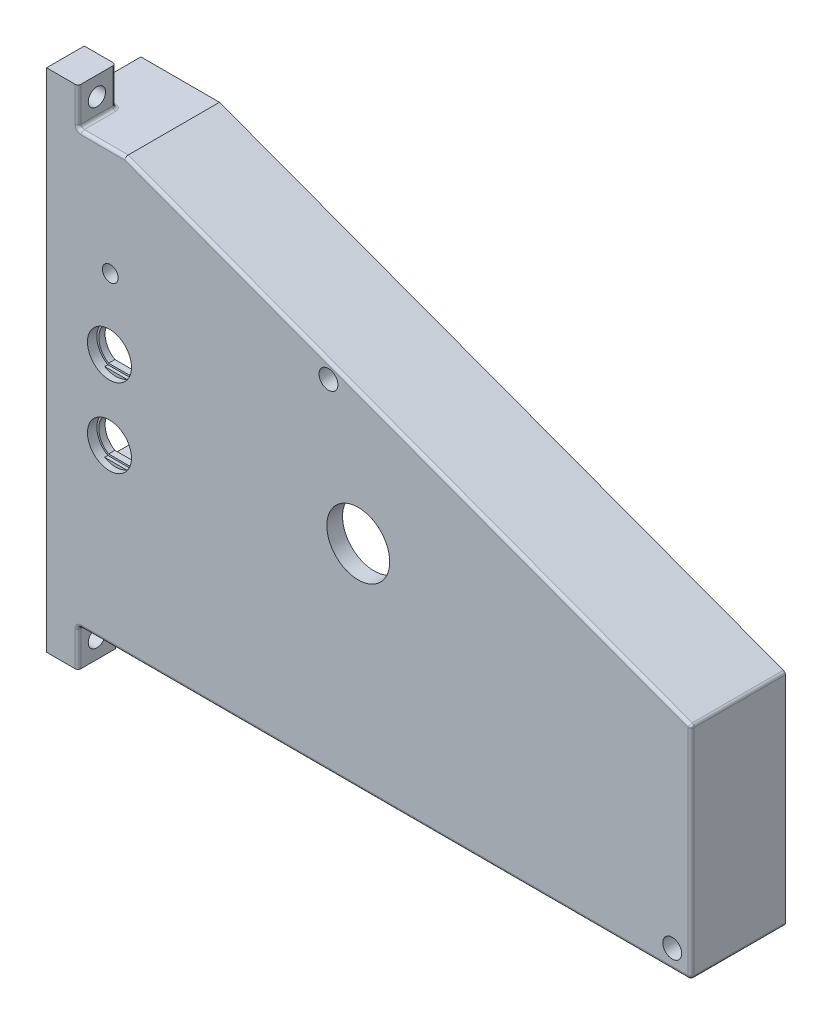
ISO-10303-21;
HEADER;
FILE_DESCRIPTION(('STEP AP214'),'2;1');
FILE_NAME('part.step','',(''),(''),'','','');
FILE_SCHEMA(('AUTOMOTIVE_DESIGN { 1 0 10303 214 1 1 1 1 }'));
ENDSEC;
DATA;
#1=APPLICATION_CONTEXT('core data for automotive mechanical design processes');
#2=APPLICATION_PROTOCOL_DEFINITION('international standard','automotive_design',2000,#1);
#3=PRODUCT_CONTEXT('',#1,'mechanical');
#4=PRODUCT('Part','Part','',(#3));
#5=PRODUCT_RELATED_PRODUCT_CATEGORY('part','',(#4));
#6=PRODUCT_DEFINITION_FORMATION('','',#4);
#7=PRODUCT_DEFINITION_CONTEXT('part definition',#1,'design');
#8=PRODUCT_DEFINITION('design','',#6,#7);
#9=PRODUCT_DEFINITION_SHAPE('','',#8);
#10=(LENGTH_UNIT() NAMED_UNIT(*) SI_UNIT(.MILLI.,.METRE.));
#11=(NAMED_UNIT(*) PLANE_ANGLE_UNIT() SI_UNIT($,.RADIAN.));
#12=(NAMED_UNIT(*) SI_UNIT($,.STERADIAN.) SOLID_ANGLE_UNIT());
#13=UNCERTAINTY_MEASURE_WITH_UNIT(LENGTH_MEASURE(1.E-05),#10,'distance_accuracy_value','');
#14=(GEOMETRIC_REPRESENTATION_CONTEXT(3) GLOBAL_UNCERTAINTY_ASSIGNED_CONTEXT((#13)) GLOBAL_UNIT_ASSIGNED_CONTEXT((#10,
#11,#12)) REPRESENTATION_CONTEXT('',''));
#15=CARTESIAN_POINT('',(0.,0.,0.));
#16=DIRECTION('',(0.,0.,1.));
#17=DIRECTION('',(1.,0.,0.));
#18=AXIS2_PLACEMENT_3D('',#15,#16,#17);
#19=CARTESIAN_POINT('',(81.4278952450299,34.6526643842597,45.));
#20=DIRECTION('',(0.,0.,1.));
#21=DIRECTION('',(1.,0.,0.));
#22=AXIS2_PLACEMENT_3D('',#19,#20,#21);
#23=CYLINDRICAL_SURFACE('',#22,12.1981359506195);
#24=CARTESIAN_POINT('',(81.4278952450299,34.6526643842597,48.6557443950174));
#25=DIRECTION('',(0.,0.,-1.));
#26=DIRECTION('',(0.,1.,0.));
#27=AXIS2_PLACEMENT_3D('',#24,#25,#26);
#28=CIRCLE('',#27,12.1981359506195);
#29=CARTESIAN_POINT('',(81.4278952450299,46.8508003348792,48.6557443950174));
#30=VERTEX_POINT('',#29);
#31=CARTESIAN_POINT('',(93.6260311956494,34.6526643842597,48.6557443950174));
#32=VERTEX_POINT('',#31);
#33=EDGE_CURVE('E63',#30,#32,#28,.T.);
#34=ORIENTED_EDGE('',*,*,#33,.F.);
#35=DIRECTION('',(0.,0.,1.));
#36=VECTOR('',#35,1.);
#37=CARTESIAN_POINT('',(81.4278952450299,46.8508003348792,45.));
#38=LINE('',#37,#36);
#39=CARTESIAN_POINT('',(81.4278952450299,46.8508003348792,55.));
#40=VERTEX_POINT('',#39);
#41=EDGE_CURVE('E547',#30,#40,#38,.T.);
#42=ORIENTED_EDGE('',*,*,#41,.T.);
#43=CARTESIAN_POINT('',(81.4278952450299,34.6526643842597,55.));
#44=DIRECTION('',(0.,0.,-1.));
#45=DIRECTION('',(-1.,0.,0.));
#46=AXIS2_PLACEMENT_3D('',#43,#44,#45);
#47=CIRCLE('',#46,12.1981359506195);
#48=CARTESIAN_POINT('',(93.6260311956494,34.6526643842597,55.));
#49=VERTEX_POINT('',#48);
#50=EDGE_CURVE('E544',#40,#49,#47,.T.);
#51=ORIENTED_EDGE('',*,*,#50,.T.);
#52=DIRECTION('',(0.,0.,1.));
#53=VECTOR('',#52,1.);
#54=CARTESIAN_POINT('',(93.6260311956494,34.6526643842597,45.));
#55=LINE('',#54,#53);
#56=EDGE_CURVE('E541',#32,#49,#55,.T.);
#57=ORIENTED_EDGE('',*,*,#56,.F.);
#58=EDGE_LOOP('',(#34,#42,#51,#57));
#59=FACE_BOUND('',#58,.T.);
#60=ADVANCED_FACE('F46',(#59),#23,.T.);
#61=CARTESIAN_POINT('',(0.,0.,55.));
#62=DIRECTION('',(0.,0.,1.));
#63=DIRECTION('',(-1.,0.,0.));
#64=AXIS2_PLACEMENT_3D('',#61,#62,#63);
#65=PLANE('',#64);
#66=DIRECTION('',(1.,0.,0.));
#67=VECTOR('',#66,1.);
#68=CARTESIAN_POINT('',(182.295776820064,-0.8369711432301,55.));
#69=LINE('',#68,#67);
#70=CARTESIAN_POINT('',(-17.7042231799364,-0.836971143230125,55.));
#71=VERTEX_POINT('',#70);
#72=CARTESIAN_POINT('',(182.295776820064,-0.8369711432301,55.));
#73=VERTEX_POINT('',#72);
#74=EDGE_CURVE('E936',#71,#73,#69,.T.);
#75=ORIENTED_EDGE('',*,*,#74,.F.);
#76=DIRECTION('',(0.,-1.,0.));
#77=VECTOR('',#76,1.);
#78=CARTESIAN_POINT('',(-17.7042231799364,-0.836971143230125,55.));
#79=LINE('',#78,#77);
#80=CARTESIAN_POINT('',(-17.7042231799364,99.1630288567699,55.));
#81=VERTEX_POINT('',#80);
#82=EDGE_CURVE('E958',#81,#71,#79,.T.);
#83=ORIENTED_EDGE('',*,*,#82,.F.);
#84=DIRECTION('',(-1.,0.,0.));
#85=VECTOR('',#84,1.);
#86=CARTESIAN_POINT('',(-17.7042231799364,99.1630288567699,55.));
#87=LINE('',#86,#85);
#88=CARTESIAN_POINT('',(7.29577682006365,99.1630288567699,55.));
#89=VERTEX_POINT('',#88);
#90=EDGE_CURVE('E955',#89,#81,#87,.T.);
#91=ORIENTED_EDGE('',*,*,#90,.F.);
#92=DIRECTION('',(-0.937425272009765,0.348186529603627,0.));
#93=VECTOR('',#92,1.);
#94=CARTESIAN_POINT('',(7.29577682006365,99.1630288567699,55.));
#95=LINE('',#94,#93);
#96=CARTESIAN_POINT('',(63.4496229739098,78.305885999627,55.));
#97=VERTEX_POINT('',#96);
#98=EDGE_CURVE('E952',#97,#89,#95,.T.);
#99=ORIENTED_EDGE('',*,*,#98,.F.);
#100=DIRECTION('',(0.,1.,0.));
#101=VECTOR('',#100,1.);
#102=CARTESIAN_POINT('',(63.4496229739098,67.1630288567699,55.));
#103=LINE('',#102,#101);
#104=CARTESIAN_POINT('',(63.4496229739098,67.1630288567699,55.));
#105=VERTEX_POINT('',#104);
#106=EDGE_CURVE('E949',#105,#97,#103,.T.);
#107=ORIENTED_EDGE('',*,*,#106,.F.);
#108=DIRECTION('',(-1.,0.,0.));
#109=VECTOR('',#108,1.);
#110=CARTESIAN_POINT('',(93.4496229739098,67.1630288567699,55.));
#111=LINE('',#110,#109);
#112=CARTESIAN_POINT('',(93.4496229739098,67.1630288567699,55.));
#113=VERTEX_POINT('',#112);
#114=EDGE_CURVE('E946',#113,#105,#111,.T.);
#115=ORIENTED_EDGE('',*,*,#114,.F.);
#116=DIRECTION('',(-0.937425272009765,0.348186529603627,0.));
#117=VECTOR('',#116,1.);
#118=CARTESIAN_POINT('',(93.4496229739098,67.1630288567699,55.));
#119=LINE('',#118,#117);
#120=CARTESIAN_POINT('',(182.295776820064,34.1630288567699,55.));
#121=VERTEX_POINT('',#120);
#122=EDGE_CURVE('E943',#121,#113,#119,.T.);
#123=ORIENTED_EDGE('',*,*,#122,.F.);
#124=DIRECTION('',(0.,1.,0.));
#125=VECTOR('',#124,1.);
#126=CARTESIAN_POINT('',(182.295776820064,34.1630288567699,55.));
#127=LINE('',#126,#125);
#128=EDGE_CURVE('E939',#73,#121,#127,.T.);
#129=ORIENTED_EDGE('',*,*,#128,.F.);
#130=EDGE_LOOP('',(#75,#83,#91,#99,#107,#115,#123,#129));
#131=FACE_BOUND('',#130,.T.);
#132=DIRECTION('',(1.,0.,0.));
#133=VECTOR('',#132,1.);
#134=CARTESIAN_POINT('',(-0.976836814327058,52.6630288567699,55.));
#135=LINE('',#134,#133);
#136=CARTESIAN_POINT('',(-0.976836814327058,52.6630288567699,55.));
#137=VERTEX_POINT('',#136);
#138=CARTESIAN_POINT('',(5.56839045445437,52.6630288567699,55.));
#139=VERTEX_POINT('',#138);
#140=EDGE_CURVE('E716',#137,#139,#135,.T.);
#141=ORIENTED_EDGE('',*,*,#140,.F.);
#142=CARTESIAN_POINT('',(2.29577682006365,47.1630288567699,55.));
#143=DIRECTION('',(0.,0.,1.));
#144=DIRECTION('',(1.,0.,0.));
#145=AXIS2_PLACEMENT_3D('',#142,#143,#144);
#146=CIRCLE('',#145,6.4);
#147=CARTESIAN_POINT('',(-0.976836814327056,41.6630288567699,55.));
#148=VERTEX_POINT('',#147);
#149=EDGE_CURVE('E719',#148,#137,#146,.F.);
#150=ORIENTED_EDGE('',*,*,#149,.F.);
#151=DIRECTION('',(-1.,0.,0.));
#152=VECTOR('',#151,1.);
#153=CARTESIAN_POINT('',(5.56839045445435,41.6630288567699,55.));
#154=LINE('',#153,#152);
#155=CARTESIAN_POINT('',(5.56839045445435,41.6630288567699,55.));
#156=VERTEX_POINT('',#155);
#157=EDGE_CURVE('E736',#156,#148,#154,.T.);
#158=ORIENTED_EDGE('',*,*,#157,.F.);
#159=CARTESIAN_POINT('',(2.29577682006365,47.1630288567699,55.));
#160=DIRECTION('',(0.,0.,1.));
#161=DIRECTION('',(1.,0.,0.));
#162=AXIS2_PLACEMENT_3D('',#159,#160,#161);
#163=CIRCLE('',#162,6.4);
#164=EDGE_CURVE('E712',#139,#156,#163,.F.);
#165=ORIENTED_EDGE('',*,*,#164,.F.);
#166=EDGE_LOOP('',(#141,#150,#158,#165));
#167=FACE_BOUND('',#166,.T.);
#168=DIRECTION('',(1.,0.,0.));
#169=VECTOR('',#168,1.);
#170=CARTESIAN_POINT('',(-0.976836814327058,27.6630288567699,55.));
#171=LINE('',#170,#169);
#172=CARTESIAN_POINT('',(-0.976836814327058,27.6630288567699,55.));
#173=VERTEX_POINT('',#172);
#174=CARTESIAN_POINT('',(5.56839045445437,27.6630288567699,55.));
#175=VERTEX_POINT('',#174);
#176=EDGE_CURVE('E666',#173,#175,#171,.T.);
#177=ORIENTED_EDGE('',*,*,#176,.F.);
#178=CARTESIAN_POINT('',(2.29577682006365,22.1630288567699,55.));
#179=DIRECTION('',(0.,0.,1.));
#180=DIRECTION('',(1.,0.,0.));
#181=AXIS2_PLACEMENT_3D('',#178,#179,#180);
#182=CIRCLE('',#181,6.4);
#183=CARTESIAN_POINT('',(-0.976836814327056,16.6630288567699,55.));
#184=VERTEX_POINT('',#183);
#185=EDGE_CURVE('E669',#184,#173,#182,.F.);
#186=ORIENTED_EDGE('',*,*,#185,.F.);
#187=DIRECTION('',(-1.,0.,0.));
#188=VECTOR('',#187,1.);
#189=CARTESIAN_POINT('',(5.56839045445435,16.6630288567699,55.));
#190=LINE('',#189,#188);
#191=CARTESIAN_POINT('',(5.56839045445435,16.6630288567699,55.));
#192=VERTEX_POINT('',#191);
#193=EDGE_CURVE('E686',#192,#184,#190,.T.);
#194=ORIENTED_EDGE('',*,*,#193,.F.);
#195=CARTESIAN_POINT('',(2.29577682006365,22.1630288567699,55.));
#196=DIRECTION('',(0.,0.,1.));
#197=DIRECTION('',(1.,0.,0.));
#198=AXIS2_PLACEMENT_3D('',#195,#196,#197);
#199=CIRCLE('',#198,6.4);
#200=EDGE_CURVE('E664',#175,#192,#199,.F.);
#201=ORIENTED_EDGE('',*,*,#200,.F.);
#202=EDGE_LOOP('',(#177,#186,#194,#201));
#203=FACE_BOUND('',#202,.T.);
#204=CARTESIAN_POINT('',(2.55628422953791,69.6146331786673,55.));
#205=DIRECTION('',(0.,0.,1.));
#206=DIRECTION('',(1.,0.,0.));
#207=AXIS2_PLACEMENT_3D('',#204,#205,#206);
#208=CIRCLE('',#207,2.5);
#209=CARTESIAN_POINT('',(5.05628422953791,69.6146331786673,55.));
#210=VERTEX_POINT('',#209);
#211=EDGE_CURVE('E50',#210,#210,#208,.T.);
#212=ORIENTED_EDGE('',*,*,#211,.T.);
#213=EDGE_LOOP('',(#212));
#214=FACE_BOUND('',#213,.T.);
#215=DIRECTION('',(0.,1.,0.));
#216=VECTOR('',#215,1.);
#217=CARTESIAN_POINT('',(81.4278952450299,44.6526643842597,55.));
#218=LINE('',#217,#216);
#219=CARTESIAN_POINT('',(81.4278952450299,44.6526643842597,55.));
#220=VERTEX_POINT('',#219);
#221=EDGE_CURVE('E556',#220,#40,#218,.T.);
#222=ORIENTED_EDGE('',*,*,#221,.F.);
#223=CARTESIAN_POINT('',(81.4278952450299,34.6526643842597,55.));
#224=DIRECTION('',(0.,0.,-1.));
#225=DIRECTION('',(-1.,0.,0.));
#226=AXIS2_PLACEMENT_3D('',#223,#224,#225);
#227=CIRCLE('',#226,9.99999999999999);
#228=CARTESIAN_POINT('',(91.4278952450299,34.6526643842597,55.));
#229=VERTEX_POINT('',#228);
#230=EDGE_CURVE('E604',#229,#220,#227,.T.);
#231=ORIENTED_EDGE('',*,*,#230,.F.);
#232=DIRECTION('',(-1.,0.,0.));
#233=VECTOR('',#232,1.);
#234=CARTESIAN_POINT('',(93.6260311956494,34.6526643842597,55.));
#235=LINE('',#234,#233);
#236=EDGE_CURVE('E569',#49,#229,#235,.T.);
#237=ORIENTED_EDGE('',*,*,#236,.F.);
#238=ORIENTED_EDGE('',*,*,#50,.F.);
#239=EDGE_LOOP('',(#222,#231,#237,#238));
#240=FACE_BOUND('',#239,.T.);
#241=ADVANCED_FACE('F1394',(#131,#167,#203,#214,#240),#65,.F.);
#242=CARTESIAN_POINT('',(-22.7042231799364,104.16302885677,30.));
#243=DIRECTION('',(0.,-1.,0.));
#244=DIRECTION('',(0.,0.,1.));
#245=AXIS2_PLACEMENT_3D('',#242,#243,#244);
#246=PLANE('',#245);
#247=DIRECTION('',(0.,0.,1.));
#248=VECTOR('',#247,1.);
#249=CARTESIAN_POINT('',(-6.70422317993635,104.16302885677,30.));
#250=LINE('',#249,#248);
#251=CARTESIAN_POINT('',(-6.70422317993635,104.16302885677,49.));
#252=VERTEX_POINT('',#251);
#253=CARTESIAN_POINT('',(-6.70422317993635,104.16302885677,59.));
#254=VERTEX_POINT('',#253);
#255=EDGE_CURVE('E1128',#252,#254,#250,.T.);
#256=ORIENTED_EDGE('',*,*,#255,.T.);
#257=DIRECTION('',(-1.,0.,0.));
#258=VECTOR('',#257,1.);
#259=CARTESIAN_POINT('',(7.29577682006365,104.16302885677,59.));
#260=LINE('',#259,#258);
#261=CARTESIAN_POINT('',(7.29577682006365,104.16302885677,59.));
#262=VERTEX_POINT('',#261);
#263=EDGE_CURVE('E1135',#254,#262,#260,.F.);
#264=ORIENTED_EDGE('',*,*,#263,.T.);
#265=DIRECTION('',(0.,0.,1.));
#266=VECTOR('',#265,1.);
#267=CARTESIAN_POINT('',(7.29577682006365,104.16302885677,30.));
#268=LINE('',#267,#266);
#269=CARTESIAN_POINT('',(7.29577682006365,104.16302885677,30.));
#270=VERTEX_POINT('',#269);
#271=EDGE_CURVE('E1049',#270,#262,#268,.T.);
#272=ORIENTED_EDGE('',*,*,#271,.F.);
#273=DIRECTION('',(-1.,0.,0.));
#274=VECTOR('',#273,1.);
#275=CARTESIAN_POINT('',(-22.7042231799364,104.16302885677,30.));
#276=LINE('',#275,#274);
#277=CARTESIAN_POINT('',(-17.7042231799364,104.16302885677,30.));
#278=VERTEX_POINT('',#277);
#279=EDGE_CURVE('E1042',#270,#278,#276,.T.);
#280=ORIENTED_EDGE('',*,*,#279,.T.);
#281=DIRECTION('',(0.,0.,1.));
#282=VECTOR('',#281,1.);
#283=CARTESIAN_POINT('',(-17.7042231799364,104.16302885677,30.));
#284=LINE('',#283,#282);
#285=CARTESIAN_POINT('',(-17.7042231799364,104.16302885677,47.));
#286=VERTEX_POINT('',#285);
#287=EDGE_CURVE('E775',#278,#286,#284,.T.);
#288=ORIENTED_EDGE('',*,*,#287,.T.);
#289=DIRECTION('',(-1.,0.,0.));
#290=VECTOR('',#289,1.);
#291=CARTESIAN_POINT('',(-22.7042231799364,104.16302885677,47.));
#292=LINE('',#291,#290);
#293=CARTESIAN_POINT('',(-8.70422317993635,104.16302885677,47.));
#294=VERTEX_POINT('',#293);
#295=EDGE_CURVE('E1133',#286,#294,#292,.F.);
#296=ORIENTED_EDGE('',*,*,#295,.T.);
#297=CARTESIAN_POINT('',(-8.70422317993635,104.16302885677,49.));
#298=DIRECTION('',(0.,-1.,0.));
#299=DIRECTION('',(0.,0.,-1.));
#300=AXIS2_PLACEMENT_3D('',#297,#298,#299);
#301=CIRCLE('',#300,2.);
#302=EDGE_CURVE('E1130',#252,#294,#301,.F.);
#303=ORIENTED_EDGE('',*,*,#302,.F.);
#304=EDGE_LOOP('',(#256,#264,#272,#280,#288,#296,#303));
#305=FACE_BOUND('',#304,.T.);
#306=ADVANCED_FACE('F1229',(#305),#246,.F.);
#307=CARTESIAN_POINT('',(-22.7042231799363,-32.8369711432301,30.));
#308=DIRECTION('',(0.,1.,0.));
#309=DIRECTION('',(0.,0.,-1.));
#310=AXIS2_PLACEMENT_3D('',#307,#308,#309);
#311=PLANE('',#310);
#312=DIRECTION('',(1.,0.,0.));
#313=VECTOR('',#312,1.);
#314=CARTESIAN_POINT('',(-22.7042231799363,-32.8369711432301,30.));
#315=LINE('',#314,#313);
#316=CARTESIAN_POINT('',(-17.7042231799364,-32.8369711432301,30.));
#317=VERTEX_POINT('',#316);
#318=CARTESIAN_POINT('',(-16.7042231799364,-32.8369711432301,30.));
#319=VERTEX_POINT('',#318);
#320=EDGE_CURVE('E1046',#317,#319,#315,.T.);
#321=ORIENTED_EDGE('',*,*,#320,.T.);
#322=DIRECTION('',(0.,0.,-1.));
#323=VECTOR('',#322,1.);
#324=CARTESIAN_POINT('',(-16.7042231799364,-32.8369711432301,30.));
#325=LINE('',#324,#323);
#326=CARTESIAN_POINT('',(-16.7042231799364,-32.8369711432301,38.));
#327=VERTEX_POINT('',#326);
#328=EDGE_CURVE('E1157',#319,#327,#325,.F.);
#329=ORIENTED_EDGE('',*,*,#328,.T.);
#330=DIRECTION('',(1.,0.,0.));
#331=VECTOR('',#330,1.);
#332=CARTESIAN_POINT('',(-15.7042231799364,-32.8369711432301,38.));
#333=LINE('',#332,#331);
#334=CARTESIAN_POINT('',(-15.1683247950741,-32.8369711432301,38.));
#335=VERTEX_POINT('',#334);
#336=EDGE_CURVE('E792',#327,#335,#333,.T.);
#337=ORIENTED_EDGE('',*,*,#336,.T.);
#338=DIRECTION('',(0.,0.,-1.));
#339=VECTOR('',#338,1.);
#340=CARTESIAN_POINT('',(-15.1683247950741,-32.8369711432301,43.));
#341=LINE('',#340,#339);
#342=CARTESIAN_POINT('',(-15.1683247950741,-32.8369711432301,43.));
#343=VERTEX_POINT('',#342);
#344=EDGE_CURVE('E658',#343,#335,#341,.T.);
#345=ORIENTED_EDGE('',*,*,#344,.F.);
#346=DIRECTION('',(1.,0.,0.));
#347=VECTOR('',#346,1.);
#348=CARTESIAN_POINT('',(-22.7042231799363,-32.8369711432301,43.));
#349=LINE('',#348,#347);
#350=CARTESIAN_POINT('',(-8.2401215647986,-32.8369711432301,43.));
#351=VERTEX_POINT('',#350);
#352=EDGE_CURVE('E1059',#343,#351,#349,.T.);
#353=ORIENTED_EDGE('',*,*,#352,.T.);
#354=DIRECTION('',(0.,0.,-1.));
#355=VECTOR('',#354,1.);
#356=CARTESIAN_POINT('',(-8.2401215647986,-32.8369711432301,43.));
#357=LINE('',#356,#355);
#358=CARTESIAN_POINT('',(-8.2401215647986,-32.8369711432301,38.));
#359=VERTEX_POINT('',#358);
#360=EDGE_CURVE('E662',#359,#351,#357,.F.);
#361=ORIENTED_EDGE('',*,*,#360,.F.);
#362=CARTESIAN_POINT('',(-6.70422317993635,-32.8369711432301,38.));
#363=VERTEX_POINT('',#362);
#364=EDGE_CURVE('E791',#359,#363,#333,.T.);
#365=ORIENTED_EDGE('',*,*,#364,.T.);
#366=DIRECTION('',(0.,0.,-1.));
#367=VECTOR('',#366,1.);
#368=CARTESIAN_POINT('',(-6.70422317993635,-32.8369711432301,30.));
#369=LINE('',#368,#367);
#370=CARTESIAN_POINT('',(-6.70422317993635,-32.8369711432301,30.));
#371=VERTEX_POINT('',#370);
#372=EDGE_CURVE('E1154',#363,#371,#369,.T.);
#373=ORIENTED_EDGE('',*,*,#372,.T.);
#374=CARTESIAN_POINT('',(186.295776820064,-32.8369711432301,30.));
#375=VERTEX_POINT('',#374);
#376=EDGE_CURVE('E1045',#371,#375,#315,.T.);
#377=ORIENTED_EDGE('',*,*,#376,.T.);
#378=DIRECTION('',(0.,0.,1.));
#379=VECTOR('',#378,1.);
#380=CARTESIAN_POINT('',(186.295776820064,-32.8369711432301,30.));
#381=LINE('',#380,#379);
#382=CARTESIAN_POINT('',(186.295776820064,-32.8369711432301,59.));
#383=VERTEX_POINT('',#382);
#384=EDGE_CURVE('E1152',#375,#383,#381,.T.);
#385=ORIENTED_EDGE('',*,*,#384,.T.);
#386=DIRECTION('',(1.,0.,0.));
#387=VECTOR('',#386,1.);
#388=CARTESIAN_POINT('',(-7.70422317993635,-32.8369711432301,59.));
#389=LINE('',#388,#387);
#390=CARTESIAN_POINT('',(-6.70422317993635,-32.8369711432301,59.));
#391=VERTEX_POINT('',#390);
#392=EDGE_CURVE('E1150',#383,#391,#389,.F.);
#393=ORIENTED_EDGE('',*,*,#392,.T.);
#394=DIRECTION('',(0.,0.,-1.));
#395=VECTOR('',#394,1.);
#396=CARTESIAN_POINT('',(-6.70422317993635,-32.8369711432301,48.));
#397=LINE('',#396,#395);
#398=CARTESIAN_POINT('',(-6.70422317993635,-32.8369711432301,48.));
#399=VERTEX_POINT('',#398);
#400=EDGE_CURVE('E1147',#391,#399,#397,.T.);
#401=ORIENTED_EDGE('',*,*,#400,.T.);
#402=DIRECTION('',(-1.,0.,0.));
#403=VECTOR('',#402,1.);
#404=CARTESIAN_POINT('',(-7.70422317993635,-32.8369711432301,48.));
#405=LINE('',#404,#403);
#406=CARTESIAN_POINT('',(-17.7042231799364,-32.8369711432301,48.));
#407=VERTEX_POINT('',#406);
#408=EDGE_CURVE('E615',#399,#407,#405,.T.);
#409=ORIENTED_EDGE('',*,*,#408,.T.);
#410=DIRECTION('',(0.,0.,-1.));
#411=VECTOR('',#410,1.);
#412=CARTESIAN_POINT('',(-17.7042231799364,-32.8369711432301,30.));
#413=LINE('',#412,#411);
#414=EDGE_CURVE('E778',#407,#317,#413,.T.);
#415=ORIENTED_EDGE('',*,*,#414,.T.);
#416=EDGE_LOOP('',(#321,#329,#337,#345,#353,#361,#365,#373,#377,#385,#393,#401,#409,#415));
#417=FACE_BOUND('',#416,.T.);
#418=ADVANCED_FACE('F1308',(#417),#311,.F.);
#419=CARTESIAN_POINT('',(0.,0.,30.));
#420=DIRECTION('',(0.,0.,1.));
#421=DIRECTION('',(-1.,0.,0.));
#422=AXIS2_PLACEMENT_3D('',#419,#420,#421);
#423=PLANE('',#422);
#424=CARTESIAN_POINT('',(-11.7042231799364,-34.8369711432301,30.));
#425=DIRECTION('',(0.,0.,1.));
#426=DIRECTION('',(1.,0.,0.));
#427=AXIS2_PLACEMENT_3D('',#424,#425,#426);
#428=CIRCLE('',#427,1.8);
#429=CARTESIAN_POINT('',(-9.90422317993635,-34.8369711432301,30.));
#430=VERTEX_POINT('',#429);
#431=EDGE_CURVE('E780',#430,#430,#428,.T.);
#432=ORIENTED_EDGE('',*,*,#431,.T.);
#433=EDGE_LOOP('',(#432));
#434=FACE_BOUND('',#433,.T.);
#435=CARTESIAN_POINT('',(71.9496229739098,75.1630288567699,30.));
#436=DIRECTION('',(0.,0.,1.));
#437=DIRECTION('',(1.,0.,0.));
#438=AXIS2_PLACEMENT_3D('',#435,#436,#437);
#439=CIRCLE('',#438,3.00000000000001);
#440=CARTESIAN_POINT('',(74.9496229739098,75.1630288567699,30.));
#441=VERTEX_POINT('',#440);
#442=EDGE_CURVE('E928',#441,#441,#439,.T.);
#443=ORIENTED_EDGE('',*,*,#442,.T.);
#444=EDGE_LOOP('',(#443));
#445=FACE_BOUND('',#444,.T.);
#446=CARTESIAN_POINT('',(181.295776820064,-26.8369711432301,30.));
#447=DIRECTION('',(0.,0.,1.));
#448=DIRECTION('',(1.,0.,0.));
#449=AXIS2_PLACEMENT_3D('',#446,#447,#448);
#450=CIRCLE('',#449,2.99999999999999);
#451=CARTESIAN_POINT('',(184.295776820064,-26.8369711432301,30.));
#452=VERTEX_POINT('',#451);
#453=EDGE_CURVE('E931',#452,#452,#450,.T.);
#454=ORIENTED_EDGE('',*,*,#453,.T.);
#455=EDGE_LOOP('',(#454));
#456=FACE_BOUND('',#455,.T.);
#457=DIRECTION('',(0.,-1.,0.));
#458=VECTOR('',#457,1.);
#459=CARTESIAN_POINT('',(-7.70422317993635,-32.8369711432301,30.));
#460=LINE('',#459,#458);
#461=CARTESIAN_POINT('',(-7.70422317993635,-33.8369711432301,30.));
#462=VERTEX_POINT('',#461);
#463=CARTESIAN_POINT('',(-7.70422317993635,-36.8369711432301,30.));
#464=VERTEX_POINT('',#463);
#465=EDGE_CURVE('E802',#462,#464,#460,.T.);
#466=ORIENTED_EDGE('',*,*,#465,.T.);
#467=CARTESIAN_POINT('',(-8.70422317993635,-36.8369711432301,30.));
#468=DIRECTION('',(0.,0.,1.));
#469=DIRECTION('',(1.,0.,0.));
#470=AXIS2_PLACEMENT_3D('',#467,#468,#469);
#471=CIRCLE('',#470,1.);
#472=CARTESIAN_POINT('',(-8.70422317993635,-37.8369711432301,30.));
#473=VERTEX_POINT('',#472);
#474=EDGE_CURVE('E1098',#464,#473,#471,.F.);
#475=ORIENTED_EDGE('',*,*,#474,.T.);
#476=DIRECTION('',(1.,0.,0.));
#477=VECTOR('',#476,1.);
#478=CARTESIAN_POINT('',(-15.7042231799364,-37.8369711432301,30.));
#479=LINE('',#478,#477);
#480=CARTESIAN_POINT('',(-14.7042231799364,-37.8369711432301,30.));
#481=VERTEX_POINT('',#480);
#482=EDGE_CURVE('E799',#481,#473,#479,.T.);
#483=ORIENTED_EDGE('',*,*,#482,.F.);
#484=CARTESIAN_POINT('',(-14.7042231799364,-36.8369711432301,30.));
#485=DIRECTION('',(0.,0.,1.));
#486=DIRECTION('',(1.,0.,0.));
#487=AXIS2_PLACEMENT_3D('',#484,#485,#486);
#488=CIRCLE('',#487,1.);
#489=CARTESIAN_POINT('',(-15.7042231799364,-36.8369711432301,30.));
#490=VERTEX_POINT('',#489);
#491=EDGE_CURVE('E1096',#481,#490,#488,.F.);
#492=ORIENTED_EDGE('',*,*,#491,.T.);
#493=DIRECTION('',(0.,-1.,0.));
#494=VECTOR('',#493,1.);
#495=CARTESIAN_POINT('',(-15.7042231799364,-32.8369711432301,30.));
#496=LINE('',#495,#494);
#497=CARTESIAN_POINT('',(-15.7042231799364,-33.8369711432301,30.));
#498=VERTEX_POINT('',#497);
#499=EDGE_CURVE('E788',#498,#490,#496,.T.);
#500=ORIENTED_EDGE('',*,*,#499,.F.);
#501=CARTESIAN_POINT('',(-16.7042231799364,-33.8369711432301,30.));
#502=DIRECTION('',(0.,0.,1.));
#503=DIRECTION('',(1.,0.,0.));
#504=AXIS2_PLACEMENT_3D('',#501,#502,#503);
#505=CIRCLE('',#504,1.);
#506=EDGE_CURVE('E1162',#498,#319,#505,.T.);
#507=ORIENTED_EDGE('',*,*,#506,.T.);
#508=ORIENTED_EDGE('',*,*,#320,.F.);
#509=DIRECTION('',(0.,-1.,0.));
#510=VECTOR('',#509,1.);
#511=CARTESIAN_POINT('',(-17.7042231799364,-40.4131787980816,30.));
#512=LINE('',#511,#510);
#513=CARTESIAN_POINT('',(-17.7042231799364,-31.7511847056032,30.));
#514=VERTEX_POINT('',#513);
#515=EDGE_CURVE('E762',#514,#317,#512,.T.);
#516=ORIENTED_EDGE('',*,*,#515,.F.);
#517=DIRECTION('',(1.,0.,0.));
#518=VECTOR('',#517,1.);
#519=CARTESIAN_POINT('',(-18.2042231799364,-31.7511847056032,30.));
#520=LINE('',#519,#518);
#521=CARTESIAN_POINT('',(167.50288360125,-31.7511847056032,30.));
#522=VERTEX_POINT('',#521);
#523=EDGE_CURVE('E810',#514,#522,#520,.T.);
#524=ORIENTED_EDGE('',*,*,#523,.T.);
#525=CARTESIAN_POINT('',(167.50288360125,-28.3369711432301,30.));
#526=DIRECTION('',(0.,0.,1.));
#527=DIRECTION('',(0.,-1.,0.));
#528=AXIS2_PLACEMENT_3D('',#525,#526,#527);
#529=CIRCLE('',#528,3.41421356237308);
#530=CARTESIAN_POINT('',(169.917097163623,-30.7511847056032,30.));
#531=VERTEX_POINT('',#530);
#532=EDGE_CURVE('E816',#522,#531,#529,.T.);
#533=ORIENTED_EDGE('',*,*,#532,.T.);
#534=DIRECTION('',(0.707106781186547,0.707106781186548,0.));
#535=VECTOR('',#534,1.);
#536=CARTESIAN_POINT('',(169.917097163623,-30.7511847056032,30.));
#537=LINE('',#536,#535);
#538=CARTESIAN_POINT('',(185.209990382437,-15.4582914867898,30.));
#539=VERTEX_POINT('',#538);
#540=EDGE_CURVE('E824',#531,#539,#537,.T.);
#541=ORIENTED_EDGE('',*,*,#540,.T.);
#542=CARTESIAN_POINT('',(182.795776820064,-13.0440779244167,30.));
#543=DIRECTION('',(0.,0.,1.));
#544=DIRECTION('',(0.707106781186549,-0.707106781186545,0.));
#545=AXIS2_PLACEMENT_3D('',#542,#543,#544);
#546=CIRCLE('',#545,3.41421356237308);
#547=CARTESIAN_POINT('',(186.209990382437,-13.0440779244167,30.));
#548=VERTEX_POINT('',#547);
#549=EDGE_CURVE('E832',#539,#548,#546,.T.);
#550=ORIENTED_EDGE('',*,*,#549,.T.);
#551=DIRECTION('',(0.,1.,0.));
#552=VECTOR('',#551,1.);
#553=CARTESIAN_POINT('',(186.209990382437,-13.0440779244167,30.));
#554=LINE('',#553,#552);
#555=CARTESIAN_POINT('',(186.209990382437,34.5106904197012,30.));
#556=VERTEX_POINT('',#555);
#557=EDGE_CURVE('E840',#548,#556,#554,.T.);
#558=ORIENTED_EDGE('',*,*,#557,.T.);
#559=CARTESIAN_POINT('',(182.795776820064,34.5106904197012,30.));
#560=DIRECTION('',(0.,0.,1.));
#561=DIRECTION('',(1.,0.,0.));
#562=AXIS2_PLACEMENT_3D('',#559,#560,#561);
#563=CIRCLE('',#562,3.41421356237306);
#564=CARTESIAN_POINT('',(183.984559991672,37.7112604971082,30.));
#565=VERTEX_POINT('',#564);
#566=EDGE_CURVE('E848',#556,#565,#563,.T.);
#567=ORIENTED_EDGE('',*,*,#566,.T.);
#568=DIRECTION('',(-0.937425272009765,0.348186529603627,0.));
#569=VECTOR('',#568,1.);
#570=CARTESIAN_POINT('',(183.984559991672,37.7112604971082,30.));
#571=LINE('',#570,#569);
#572=CARTESIAN_POINT('',(94.7282641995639,70.8635989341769,30.));
#573=VERTEX_POINT('',#572);
#574=EDGE_CURVE('E857',#565,#573,#571,.T.);
#575=ORIENTED_EDGE('',*,*,#574,.T.);
#576=CARTESIAN_POINT('',(93.5394810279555,67.6630288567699,30.));
#577=DIRECTION('',(0.,0.,1.));
#578=DIRECTION('',(0.348186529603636,0.937425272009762,0.));
#579=AXIS2_PLACEMENT_3D('',#576,#577,#578);
#580=CIRCLE('',#579,3.41421356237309);
#581=CARTESIAN_POINT('',(93.5394810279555,71.077242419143,30.));
#582=VERTEX_POINT('',#581);
#583=EDGE_CURVE('E864',#573,#582,#580,.T.);
#584=ORIENTED_EDGE('',*,*,#583,.T.);
#585=DIRECTION('',(-1.,0.,0.));
#586=VECTOR('',#585,1.);
#587=CARTESIAN_POINT('',(93.5394810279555,71.077242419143,30.));
#588=LINE('',#587,#586);
#589=CARTESIAN_POINT('',(67.9496229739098,71.077242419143,30.));
#590=VERTEX_POINT('',#589);
#591=EDGE_CURVE('E872',#582,#590,#588,.T.);
#592=ORIENTED_EDGE('',*,*,#591,.T.);
#593=CARTESIAN_POINT('',(67.9496229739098,71.6630288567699,30.));
#594=DIRECTION('',(0.,0.,-1.));
#595=DIRECTION('',(0.,-1.,0.));
#596=AXIS2_PLACEMENT_3D('',#593,#594,#595);
#597=CIRCLE('',#596,0.585786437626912);
#598=CARTESIAN_POINT('',(67.3638365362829,71.6630288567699,30.));
#599=VERTEX_POINT('',#598);
#600=EDGE_CURVE('E880',#590,#599,#597,.T.);
#601=ORIENTED_EDGE('',*,*,#600,.T.);
#602=DIRECTION('',(0.,1.,0.));
#603=VECTOR('',#602,1.);
#604=CARTESIAN_POINT('',(67.3638365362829,71.6630288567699,30.));
#605=LINE('',#604,#603);
#606=CARTESIAN_POINT('',(67.3638365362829,78.6535475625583,30.));
#607=VERTEX_POINT('',#606);
#608=EDGE_CURVE('E888',#599,#607,#605,.T.);
#609=ORIENTED_EDGE('',*,*,#608,.T.);
#610=CARTESIAN_POINT('',(63.9496229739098,78.6535475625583,30.));
#611=DIRECTION('',(0.,0.,1.));
#612=DIRECTION('',(1.,0.,0.));
#613=AXIS2_PLACEMENT_3D('',#610,#611,#612);
#614=CIRCLE('',#613,3.41421356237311);
#615=CARTESIAN_POINT('',(65.1384061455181,81.8541176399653,30.));
#616=VERTEX_POINT('',#615);
#617=EDGE_CURVE('E896',#607,#616,#614,.T.);
#618=ORIENTED_EDGE('',*,*,#617,.T.);
#619=DIRECTION('',(-0.937425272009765,0.348186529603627,0.));
#620=VECTOR('',#619,1.);
#621=CARTESIAN_POINT('',(65.1384061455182,81.8541176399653,30.));
#622=LINE('',#621,#620);
#623=CARTESIAN_POINT('',(8.57441804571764,102.863598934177,30.));
#624=VERTEX_POINT('',#623);
#625=EDGE_CURVE('E904',#616,#624,#622,.T.);
#626=ORIENTED_EDGE('',*,*,#625,.T.);
#627=CARTESIAN_POINT('',(7.38563487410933,99.6630288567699,30.));
#628=DIRECTION('',(0.,0.,1.));
#629=DIRECTION('',(0.348186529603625,0.937425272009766,0.));
#630=AXIS2_PLACEMENT_3D('',#627,#628,#629);
#631=CIRCLE('',#630,3.4142135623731);
#632=CARTESIAN_POINT('',(7.38563487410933,103.077242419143,30.));
#633=VERTEX_POINT('',#632);
#634=EDGE_CURVE('E912',#624,#633,#631,.T.);
#635=ORIENTED_EDGE('',*,*,#634,.T.);
#636=DIRECTION('',(-1.,0.,0.));
#637=VECTOR('',#636,1.);
#638=CARTESIAN_POINT('',(7.38563487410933,103.077242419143,30.));
#639=LINE('',#638,#637);
#640=CARTESIAN_POINT('',(-17.7042231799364,103.077242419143,30.));
#641=VERTEX_POINT('',#640);
#642=EDGE_CURVE('E918',#633,#641,#639,.T.);
#643=ORIENTED_EDGE('',*,*,#642,.T.);
#644=EDGE_CURVE('E769',#278,#641,#512,.T.);
#645=ORIENTED_EDGE('',*,*,#644,.F.);
#646=ORIENTED_EDGE('',*,*,#279,.F.);
#647=DIRECTION('',(-0.937182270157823,0.348840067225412,0.));
#648=VECTOR('',#647,1.);
#649=CARTESIAN_POINT('',(7.29577682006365,104.16302885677,30.));
#650=LINE('',#649,#648);
#651=CARTESIAN_POINT('',(186.644616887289,37.4054050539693,30.));
#652=VERTEX_POINT('',#651);
#653=EDGE_CURVE('E1040',#652,#270,#650,.T.);
#654=ORIENTED_EDGE('',*,*,#653,.F.);
#655=CARTESIAN_POINT('',(186.295776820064,36.4682227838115,30.));
#656=DIRECTION('',(0.,0.,1.));
#657=DIRECTION('',(1.,0.,0.));
#658=AXIS2_PLACEMENT_3D('',#655,#656,#657);
#659=CIRCLE('',#658,1.);
#660=CARTESIAN_POINT('',(187.295776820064,36.4682227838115,30.));
#661=VERTEX_POINT('',#660);
#662=EDGE_CURVE('E1094',#652,#661,#659,.F.);
#663=ORIENTED_EDGE('',*,*,#662,.T.);
#664=DIRECTION('',(0.,1.,0.));
#665=VECTOR('',#664,1.);
#666=CARTESIAN_POINT('',(187.295776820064,-32.8369711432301,30.));
#667=LINE('',#666,#665);
#668=CARTESIAN_POINT('',(187.295776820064,-31.8369711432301,30.));
#669=VERTEX_POINT('',#668);
#670=EDGE_CURVE('E983',#669,#661,#667,.T.);
#671=ORIENTED_EDGE('',*,*,#670,.F.);
#672=CARTESIAN_POINT('',(186.295776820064,-31.8369711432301,30.));
#673=DIRECTION('',(0.,0.,1.));
#674=DIRECTION('',(1.,0.,0.));
#675=AXIS2_PLACEMENT_3D('',#672,#673,#674);
#676=CIRCLE('',#675,1.);
#677=EDGE_CURVE('E1092',#669,#375,#676,.F.);
#678=ORIENTED_EDGE('',*,*,#677,.T.);
#679=ORIENTED_EDGE('',*,*,#376,.F.);
#680=CARTESIAN_POINT('',(-6.70422317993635,-33.8369711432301,30.));
#681=DIRECTION('',(0.,0.,1.));
#682=DIRECTION('',(1.,0.,0.));
#683=AXIS2_PLACEMENT_3D('',#680,#681,#682);
#684=CIRCLE('',#683,1.);
#685=EDGE_CURVE('E1166',#371,#462,#684,.T.);
#686=ORIENTED_EDGE('',*,*,#685,.T.);
#687=EDGE_LOOP('',(#466,#475,#483,#492,#500,#507,#508,#516,#524,#533,#541,#550,#558,#567,#575,
#584,#592,#601,#609,#618,#626,#635,#643,#645,#646,#654,#663,#671,#678,#679,#686));
#688=FACE_BOUND('',#687,.T.);
#689=ADVANCED_FACE('F1283',(#434,#445,#456,#688),#423,.F.);
#690=CARTESIAN_POINT('',(187.295776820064,-32.8369711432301,30.));
#691=DIRECTION('',(-1.,0.,0.));
#692=DIRECTION('',(0.,0.,-1.));
#693=AXIS2_PLACEMENT_3D('',#690,#691,#692);
#694=PLANE('',#693);
#695=ORIENTED_EDGE('',*,*,#670,.T.);
#696=DIRECTION('',(0.,0.,1.));
#697=VECTOR('',#696,1.);
#698=CARTESIAN_POINT('',(187.295776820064,36.4682227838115,30.));
#699=LINE('',#698,#697);
#700=CARTESIAN_POINT('',(187.295776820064,36.4682227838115,59.));
#701=VERTEX_POINT('',#700);
#702=EDGE_CURVE('E1145',#661,#701,#699,.T.);
#703=ORIENTED_EDGE('',*,*,#702,.T.);
#704=DIRECTION('',(0.,1.,0.));
#705=VECTOR('',#704,1.);
#706=CARTESIAN_POINT('',(187.295776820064,-32.8369711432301,59.));
#707=LINE('',#706,#705);
#708=CARTESIAN_POINT('',(187.295776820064,-31.8369711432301,59.));
#709=VERTEX_POINT('',#708);
#710=EDGE_CURVE('E1141',#701,#709,#707,.F.);
#711=ORIENTED_EDGE('',*,*,#710,.T.);
#712=DIRECTION('',(0.,0.,1.));
#713=VECTOR('',#712,1.);
#714=CARTESIAN_POINT('',(187.295776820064,-31.8369711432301,30.));
#715=LINE('',#714,#713);
#716=EDGE_CURVE('E1143',#709,#669,#715,.F.);
#717=ORIENTED_EDGE('',*,*,#716,.T.);
#718=EDGE_LOOP('',(#695,#703,#711,#717));
#719=FACE_BOUND('',#718,.T.);
#720=ADVANCED_FACE('F1287',(#719),#694,.F.);
#721=CARTESIAN_POINT('',(7.29577682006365,104.16302885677,30.));
#722=DIRECTION('',(-0.348840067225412,-0.937182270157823,0.));
#723=DIRECTION('',(0.937182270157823,-0.348840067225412,0.));
#724=AXIS2_PLACEMENT_3D('',#721,#722,#723);
#725=PLANE('',#724);
#726=ORIENTED_EDGE('',*,*,#271,.T.);
#727=DIRECTION('',(-0.937182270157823,0.348840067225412,0.));
#728=VECTOR('',#727,1.);
#729=CARTESIAN_POINT('',(187.295776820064,37.1630288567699,59.));
#730=LINE('',#729,#728);
#731=CARTESIAN_POINT('',(186.644616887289,37.4054050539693,59.));
#732=VERTEX_POINT('',#731);
#733=EDGE_CURVE('E1139',#262,#732,#730,.F.);
#734=ORIENTED_EDGE('',*,*,#733,.T.);
#735=DIRECTION('',(0.,0.,1.));
#736=VECTOR('',#735,1.);
#737=CARTESIAN_POINT('',(186.644616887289,37.4054050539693,30.));
#738=LINE('',#737,#736);
#739=EDGE_CURVE('E1137',#732,#652,#738,.F.);
#740=ORIENTED_EDGE('',*,*,#739,.T.);
#741=ORIENTED_EDGE('',*,*,#653,.T.);
#742=EDGE_LOOP('',(#726,#734,#740,#741));
#743=FACE_BOUND('',#742,.T.);
#744=ADVANCED_FACE('F1273',(#743),#725,.F.);
#745=CARTESIAN_POINT('',(0.,0.,60.));
#746=DIRECTION('',(0.,0.,1.));
#747=DIRECTION('',(-1.,0.,0.));
#748=AXIS2_PLACEMENT_3D('',#745,#746,#747);
#749=PLANE('',#748);
#750=CARTESIAN_POINT('',(2.55628422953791,69.6146331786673,60.));
#751=DIRECTION('',(0.,0.,1.));
#752=DIRECTION('',(1.,0.,0.));
#753=AXIS2_PLACEMENT_3D('',#750,#751,#752);
#754=CIRCLE('',#753,2.5);
#755=CARTESIAN_POINT('',(5.05628422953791,69.6146331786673,60.));
#756=VERTEX_POINT('',#755);
#757=EDGE_CURVE('E582',#756,#756,#754,.T.);
#758=ORIENTED_EDGE('',*,*,#757,.F.);
#759=EDGE_LOOP('',(#758));
#760=FACE_BOUND('',#759,.T.);
#761=CARTESIAN_POINT('',(81.4278952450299,34.6526643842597,60.));
#762=DIRECTION('',(0.,0.,1.));
#763=DIRECTION('',(1.,0.,0.));
#764=AXIS2_PLACEMENT_3D('',#761,#762,#763);
#765=CIRCLE('',#764,9.99999999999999);
#766=CARTESIAN_POINT('',(91.4278952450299,34.6526643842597,60.));
#767=VERTEX_POINT('',#766);
#768=EDGE_CURVE('E606',#767,#767,#765,.T.);
#769=ORIENTED_EDGE('',*,*,#768,.F.);
#770=EDGE_LOOP('',(#769));
#771=FACE_BOUND('',#770,.T.);
#772=CARTESIAN_POINT('',(2.29577682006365,22.1630288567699,60.));
#773=DIRECTION('',(0.,0.,1.));
#774=DIRECTION('',(1.,0.,0.));
#775=AXIS2_PLACEMENT_3D('',#772,#773,#774);
#776=CIRCLE('',#775,7.);
#777=CARTESIAN_POINT('',(9.29577682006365,22.1630288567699,60.));
#778=VERTEX_POINT('',#777);
#779=EDGE_CURVE('E707',#778,#778,#776,.T.);
#780=ORIENTED_EDGE('',*,*,#779,.F.);
#781=EDGE_LOOP('',(#780));
#782=FACE_BOUND('',#781,.T.);
#783=CARTESIAN_POINT('',(2.29577682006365,47.1630288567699,60.));
#784=DIRECTION('',(0.,0.,1.));
#785=DIRECTION('',(1.,0.,0.));
#786=AXIS2_PLACEMENT_3D('',#783,#784,#785);
#787=CIRCLE('',#786,7.);
#788=CARTESIAN_POINT('',(9.29577682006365,47.1630288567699,60.));
#789=VERTEX_POINT('',#788);
#790=EDGE_CURVE('E757',#789,#789,#787,.T.);
#791=ORIENTED_EDGE('',*,*,#790,.F.);
#792=EDGE_LOOP('',(#791));
#793=FACE_BOUND('',#792,.T.);
#794=CARTESIAN_POINT('',(-6.70422317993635,105.16302885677,60.));
#795=DIRECTION('',(0.,0.,1.));
#796=DIRECTION('',(1.,0.,0.));
#797=AXIS2_PLACEMENT_3D('',#794,#795,#796);
#798=CIRCLE('',#797,2.);
#799=CARTESIAN_POINT('',(-8.70422317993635,105.16302885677,60.));
#800=VERTEX_POINT('',#799);
#801=CARTESIAN_POINT('',(-6.70422317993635,103.16302885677,60.));
#802=VERTEX_POINT('',#801);
#803=EDGE_CURVE('E1076',#800,#802,#798,.T.);
#804=ORIENTED_EDGE('',*,*,#803,.F.);
#805=DIRECTION('',(0.,1.,0.));
#806=VECTOR('',#805,1.);
#807=CARTESIAN_POINT('',(-8.70422317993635,0.,60.));
#808=LINE('',#807,#806);
#809=CARTESIAN_POINT('',(-8.70422317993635,116.16302885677,60.));
#810=VERTEX_POINT('',#809);
#811=EDGE_CURVE('E1079',#800,#810,#808,.T.);
#812=ORIENTED_EDGE('',*,*,#811,.T.);
#813=DIRECTION('',(-1.,0.,0.));
#814=VECTOR('',#813,1.);
#815=CARTESIAN_POINT('',(-7.70422317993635,116.16302885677,60.));
#816=LINE('',#815,#814);
#817=CARTESIAN_POINT('',(-17.7042231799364,116.16302885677,60.));
#818=VERTEX_POINT('',#817);
#819=EDGE_CURVE('E645',#810,#818,#816,.T.);
#820=ORIENTED_EDGE('',*,*,#819,.T.);
#821=DIRECTION('',(0.,-1.,0.));
#822=VECTOR('',#821,1.);
#823=CARTESIAN_POINT('',(-17.7042231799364,-40.4131787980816,60.));
#824=LINE('',#823,#822);
#825=CARTESIAN_POINT('',(-17.7042231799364,-44.8369711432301,60.));
#826=VERTEX_POINT('',#825);
#827=EDGE_CURVE('E765',#818,#826,#824,.T.);
#828=ORIENTED_EDGE('',*,*,#827,.T.);
#829=DIRECTION('',(-1.,0.,0.));
#830=VECTOR('',#829,1.);
#831=CARTESIAN_POINT('',(-7.70422317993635,-44.8369711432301,60.));
#832=LINE('',#831,#830);
#833=CARTESIAN_POINT('',(-8.70422317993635,-44.8369711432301,60.));
#834=VERTEX_POINT('',#833);
#835=EDGE_CURVE('E613',#834,#826,#832,.T.);
#836=ORIENTED_EDGE('',*,*,#835,.F.);
#837=DIRECTION('',(0.,1.,0.));
#838=VECTOR('',#837,1.);
#839=CARTESIAN_POINT('',(-8.70422317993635,-32.8369711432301,60.));
#840=LINE('',#839,#838);
#841=CARTESIAN_POINT('',(-8.70422317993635,-33.8369711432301,60.));
#842=VERTEX_POINT('',#841);
#843=EDGE_CURVE('E1073',#834,#842,#840,.T.);
#844=ORIENTED_EDGE('',*,*,#843,.T.);
#845=CARTESIAN_POINT('',(-6.70422317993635,-33.8369711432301,60.));
#846=DIRECTION('',(0.,0.,1.));
#847=DIRECTION('',(1.,0.,0.));
#848=AXIS2_PLACEMENT_3D('',#845,#846,#847);
#849=CIRCLE('',#848,2.);
#850=CARTESIAN_POINT('',(-6.70422317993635,-31.8369711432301,60.));
#851=VERTEX_POINT('',#850);
#852=EDGE_CURVE('E1070',#851,#842,#849,.T.);
#853=ORIENTED_EDGE('',*,*,#852,.F.);
#854=DIRECTION('',(1.,0.,0.));
#855=VECTOR('',#854,1.);
#856=CARTESIAN_POINT('',(187.295776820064,-31.8369711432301,60.));
#857=LINE('',#856,#855);
#858=CARTESIAN_POINT('',(186.295776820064,-31.8369711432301,60.));
#859=VERTEX_POINT('',#858);
#860=EDGE_CURVE('E1062',#851,#859,#857,.T.);
#861=ORIENTED_EDGE('',*,*,#860,.T.);
#862=DIRECTION('',(0.,1.,0.));
#863=VECTOR('',#862,1.);
#864=CARTESIAN_POINT('',(186.295776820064,37.1630288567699,60.));
#865=LINE('',#864,#863);
#866=CARTESIAN_POINT('',(186.295776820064,36.4682227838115,60.));
#867=VERTEX_POINT('',#866);
#868=EDGE_CURVE('E1064',#859,#867,#865,.T.);
#869=ORIENTED_EDGE('',*,*,#868,.T.);
#870=DIRECTION('',(-0.937182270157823,0.348840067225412,0.));
#871=VECTOR('',#870,1.);
#872=CARTESIAN_POINT('',(6.94693675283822,103.225846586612,60.));
#873=LINE('',#872,#871);
#874=CARTESIAN_POINT('',(7.11570080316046,103.16302885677,60.));
#875=VERTEX_POINT('',#874);
#876=EDGE_CURVE('E1066',#867,#875,#873,.T.);
#877=ORIENTED_EDGE('',*,*,#876,.T.);
#878=DIRECTION('',(-1.,0.,0.));
#879=VECTOR('',#878,1.);
#880=CARTESIAN_POINT('',(-7.70422317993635,103.16302885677,60.));
#881=LINE('',#880,#879);
#882=EDGE_CURVE('E1068',#875,#802,#881,.T.);
#883=ORIENTED_EDGE('',*,*,#882,.T.);
#884=EDGE_LOOP('',(#804,#812,#820,#828,#836,#844,#853,#861,#869,#877,#883));
#885=FACE_BOUND('',#884,.T.);
#886=CARTESIAN_POINT('',(71.9496229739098,75.1630288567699,60.));
#887=DIRECTION('',(0.,0.,1.));
#888=DIRECTION('',(1.,0.,0.));
#889=AXIS2_PLACEMENT_3D('',#886,#887,#888);
#890=CIRCLE('',#889,3.00000000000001);
#891=CARTESIAN_POINT('',(74.9496229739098,75.1630288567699,60.));
#892=VERTEX_POINT('',#891);
#893=EDGE_CURVE('E924',#892,#892,#890,.T.);
#894=ORIENTED_EDGE('',*,*,#893,.F.);
#895=EDGE_LOOP('',(#894));
#896=FACE_BOUND('',#895,.T.);
#897=CARTESIAN_POINT('',(181.295776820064,-26.8369711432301,60.));
#898=DIRECTION('',(0.,0.,1.));
#899=DIRECTION('',(1.,0.,0.));
#900=AXIS2_PLACEMENT_3D('',#897,#898,#899);
#901=CIRCLE('',#900,2.99999999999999);
#902=CARTESIAN_POINT('',(184.295776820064,-26.8369711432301,60.));
#903=VERTEX_POINT('',#902);
#904=EDGE_CURVE('E921',#903,#903,#901,.T.);
#905=ORIENTED_EDGE('',*,*,#904,.F.);
#906=EDGE_LOOP('',(#905));
#907=FACE_BOUND('',#906,.T.);
#908=ADVANCED_FACE('F1334',(#760,#771,#782,#793,#885,#896,#907),#749,.T.);
#909=CARTESIAN_POINT('',(181.295776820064,-26.8369711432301,60.));
#910=DIRECTION('',(0.,0.,-1.));
#911=DIRECTION('',(1.,0.,0.));
#912=AXIS2_PLACEMENT_3D('',#909,#910,#911);
#913=CYLINDRICAL_SURFACE('',#912,2.99999999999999);
#914=ORIENTED_EDGE('',*,*,#904,.T.);
#915=EDGE_LOOP('',(#914));
#916=FACE_BOUND('',#915,.T.);
#917=ORIENTED_EDGE('',*,*,#453,.F.);
#918=EDGE_LOOP('',(#917));
#919=FACE_BOUND('',#918,.T.);
#920=ADVANCED_FACE('F1684',(#916,#919),#913,.F.);
#921=CARTESIAN_POINT('',(71.9496229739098,75.1630288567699,60.));
#922=DIRECTION('',(0.,0.,-1.));
#923=DIRECTION('',(1.,0.,0.));
#924=AXIS2_PLACEMENT_3D('',#921,#922,#923);
#925=CYLINDRICAL_SURFACE('',#924,3.00000000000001);
#926=ORIENTED_EDGE('',*,*,#893,.T.);
#927=EDGE_LOOP('',(#926));
#928=FACE_BOUND('',#927,.T.);
#929=ORIENTED_EDGE('',*,*,#442,.F.);
#930=EDGE_LOOP('',(#929));
#931=FACE_BOUND('',#930,.T.);
#932=ADVANCED_FACE('F2160',(#928,#931),#925,.F.);
#933=CARTESIAN_POINT('',(-18.2042231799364,-30.3369711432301,29.5));
#934=DIRECTION('',(1.,0.,0.));
#935=DIRECTION('',(0.,1.,0.));
#936=AXIS2_PLACEMENT_3D('',#933,#934,#935);
#937=CYLINDRICAL_SURFACE('',#936,1.5);
#938=CARTESIAN_POINT('',(-17.7042231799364,-30.3369711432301,29.5));
#939=DIRECTION('',(1.,0.,0.));
#940=DIRECTION('',(0.,0.,-1.));
#941=AXIS2_PLACEMENT_3D('',#938,#939,#940);
#942=CIRCLE('',#941,1.5);
#943=CARTESIAN_POINT('',(-17.7042231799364,-28.922757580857,30.));
#944=VERTEX_POINT('',#943);
#945=EDGE_CURVE('E773',#944,#514,#942,.T.);
#946=ORIENTED_EDGE('',*,*,#945,.F.);
#947=DIRECTION('',(1.,0.,0.));
#948=VECTOR('',#947,1.);
#949=CARTESIAN_POINT('',(-18.2042231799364,-28.922757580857,30.));
#950=LINE('',#949,#948);
#951=CARTESIAN_POINT('',(167.50288360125,-28.922757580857,30.));
#952=VERTEX_POINT('',#951);
#953=EDGE_CURVE('E798',#944,#952,#950,.T.);
#954=ORIENTED_EDGE('',*,*,#953,.T.);
#955=CARTESIAN_POINT('',(167.50288360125,-30.3369711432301,29.5));
#956=DIRECTION('',(1.,0.,0.));
#957=DIRECTION('',(0.,1.,0.));
#958=AXIS2_PLACEMENT_3D('',#955,#956,#957);
#959=CIRCLE('',#958,1.5);
#960=EDGE_CURVE('E807',#952,#522,#959,.T.);
#961=ORIENTED_EDGE('',*,*,#960,.T.);
#962=ORIENTED_EDGE('',*,*,#523,.F.);
#963=EDGE_LOOP('',(#946,#954,#961,#962));
#964=FACE_BOUND('',#963,.T.);
#965=ADVANCED_FACE('F2150',(#964),#937,.F.);
#966=CARTESIAN_POINT('',(167.50288360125,-28.3369711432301,29.5));
#967=DIRECTION('',(0.,0.,-1.));
#968=DIRECTION('',(1.,0.,0.));
#969=AXIS2_PLACEMENT_3D('',#966,#967,#968);
#970=TOROIDAL_SURFACE('',#969,1.99999999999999,1.5);
#971=ORIENTED_EDGE('',*,*,#532,.F.);
#972=ORIENTED_EDGE('',*,*,#960,.F.);
#973=CARTESIAN_POINT('',(167.50288360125,-28.3369711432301,30.));
#974=DIRECTION('',(0.,0.,1.));
#975=DIRECTION('',(0.,-1.,0.));
#976=AXIS2_PLACEMENT_3D('',#973,#974,#975);
#977=CIRCLE('',#976,0.585786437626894);
#978=CARTESIAN_POINT('',(167.917097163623,-28.7511847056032,30.));
#979=VERTEX_POINT('',#978);
#980=EDGE_CURVE('E812',#952,#979,#977,.T.);
#981=ORIENTED_EDGE('',*,*,#980,.T.);
#982=CARTESIAN_POINT('',(168.917097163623,-29.7511847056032,29.5));
#983=DIRECTION('',(0.707106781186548,0.707106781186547,0.));
#984=DIRECTION('',(-0.707106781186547,0.707106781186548,0.));
#985=AXIS2_PLACEMENT_3D('',#982,#983,#984);
#986=CIRCLE('',#985,1.5);
#987=EDGE_CURVE('E814',#979,#531,#986,.T.);
#988=ORIENTED_EDGE('',*,*,#987,.T.);
#989=EDGE_LOOP('',(#971,#972,#981,#988));
#990=FACE_BOUND('',#989,.T.);
#991=ADVANCED_FACE('F2140',(#990),#970,.F.);
#992=CARTESIAN_POINT('',(168.917097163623,-29.7511847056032,29.5));
#993=DIRECTION('',(0.707106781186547,0.707106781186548,0.));
#994=DIRECTION('',(-0.707106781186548,0.707106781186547,0.));
#995=AXIS2_PLACEMENT_3D('',#992,#993,#994);
#996=CYLINDRICAL_SURFACE('',#995,1.5);
#997=ORIENTED_EDGE('',*,*,#540,.F.);
#998=ORIENTED_EDGE('',*,*,#987,.F.);
#999=DIRECTION('',(0.707106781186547,0.707106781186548,0.));
#1000=VECTOR('',#999,1.);
#1001=CARTESIAN_POINT('',(167.917097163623,-28.7511847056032,30.));
#1002=LINE('',#1001,#1000);
#1003=CARTESIAN_POINT('',(183.209990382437,-13.4582914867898,30.));
#1004=VERTEX_POINT('',#1003);
#1005=EDGE_CURVE('E819',#979,#1004,#1002,.T.);
#1006=ORIENTED_EDGE('',*,*,#1005,.T.);
#1007=CARTESIAN_POINT('',(184.209990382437,-14.4582914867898,29.5));
#1008=DIRECTION('',(0.707106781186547,0.707106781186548,0.));
#1009=DIRECTION('',(-0.707106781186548,0.707106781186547,0.));
#1010=AXIS2_PLACEMENT_3D('',#1007,#1008,#1009);
#1011=CIRCLE('',#1010,1.5);
#1012=EDGE_CURVE('E822',#1004,#539,#1011,.T.);
#1013=ORIENTED_EDGE('',*,*,#1012,.T.);
#1014=EDGE_LOOP('',(#997,#998,#1006,#1013));
#1015=FACE_BOUND('',#1014,.T.);
#1016=ADVANCED_FACE('F2130',(#1015),#996,.F.);
#1017=CARTESIAN_POINT('',(182.795776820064,-13.0440779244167,29.5));
#1018=DIRECTION('',(0.,0.,-1.));
#1019=DIRECTION('',(1.,0.,0.));
#1020=AXIS2_PLACEMENT_3D('',#1017,#1018,#1019);
#1021=TOROIDAL_SURFACE('',#1020,1.99999999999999,1.5);
#1022=ORIENTED_EDGE('',*,*,#549,.F.);
#1023=ORIENTED_EDGE('',*,*,#1012,.F.);
#1024=CARTESIAN_POINT('',(182.795776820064,-13.0440779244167,30.));
#1025=DIRECTION('',(0.,0.,1.));
#1026=DIRECTION('',(0.707106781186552,-0.707106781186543,0.));
#1027=AXIS2_PLACEMENT_3D('',#1024,#1025,#1026);
#1028=CIRCLE('',#1027,0.585786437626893);
#1029=CARTESIAN_POINT('',(183.381563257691,-13.0440779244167,30.));
#1030=VERTEX_POINT('',#1029);
#1031=EDGE_CURVE('E827',#1004,#1030,#1028,.T.);
#1032=ORIENTED_EDGE('',*,*,#1031,.T.);
#1033=CARTESIAN_POINT('',(184.795776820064,-13.0440779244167,29.5));
#1034=DIRECTION('',(0.,1.,0.));
#1035=DIRECTION('',(-1.,0.,0.));
#1036=AXIS2_PLACEMENT_3D('',#1033,#1034,#1035);
#1037=CIRCLE('',#1036,1.5);
#1038=EDGE_CURVE('E830',#1030,#548,#1037,.T.);
#1039=ORIENTED_EDGE('',*,*,#1038,.T.);
#1040=EDGE_LOOP('',(#1022,#1023,#1032,#1039));
#1041=FACE_BOUND('',#1040,.T.);
#1042=ADVANCED_FACE('F2120',(#1041),#1021,.F.);
#1043=CARTESIAN_POINT('',(184.795776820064,-13.0440779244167,29.5));
#1044=DIRECTION('',(0.,1.,0.));
#1045=DIRECTION('',(0.,0.,-1.));
#1046=AXIS2_PLACEMENT_3D('',#1043,#1044,#1045);
#1047=CYLINDRICAL_SURFACE('',#1046,1.5);
#1048=ORIENTED_EDGE('',*,*,#557,.F.);
#1049=ORIENTED_EDGE('',*,*,#1038,.F.);
#1050=DIRECTION('',(0.,1.,0.));
#1051=VECTOR('',#1050,1.);
#1052=CARTESIAN_POINT('',(183.381563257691,-13.0440779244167,30.));
#1053=LINE('',#1052,#1051);
#1054=CARTESIAN_POINT('',(183.381563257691,34.5106904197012,30.));
#1055=VERTEX_POINT('',#1054);
#1056=EDGE_CURVE('E835',#1030,#1055,#1053,.T.);
#1057=ORIENTED_EDGE('',*,*,#1056,.T.);
#1058=CARTESIAN_POINT('',(184.795776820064,34.5106904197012,29.5));
#1059=DIRECTION('',(0.,1.,0.));
#1060=DIRECTION('',(-1.,0.,0.));
#1061=AXIS2_PLACEMENT_3D('',#1058,#1059,#1060);
#1062=CIRCLE('',#1061,1.5);
#1063=EDGE_CURVE('E838',#1055,#556,#1062,.T.);
#1064=ORIENTED_EDGE('',*,*,#1063,.T.);
#1065=EDGE_LOOP('',(#1048,#1049,#1057,#1064));
#1066=FACE_BOUND('',#1065,.T.);
#1067=ADVANCED_FACE('F2110',(#1066),#1047,.F.);
#1068=CARTESIAN_POINT('',(182.795776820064,34.5106904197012,29.5));
#1069=DIRECTION('',(0.,0.,-1.));
#1070=DIRECTION('',(1.,0.,0.));
#1071=AXIS2_PLACEMENT_3D('',#1068,#1069,#1070);
#1072=TOROIDAL_SURFACE('',#1071,1.99999999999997,1.5);
#1073=ORIENTED_EDGE('',*,*,#566,.F.);
#1074=ORIENTED_EDGE('',*,*,#1063,.F.);
#1075=CARTESIAN_POINT('',(182.795776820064,34.5106904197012,30.));
#1076=DIRECTION('',(0.,0.,1.));
#1077=DIRECTION('',(1.,0.,0.));
#1078=AXIS2_PLACEMENT_3D('',#1075,#1076,#1077);
#1079=CIRCLE('',#1078,0.585786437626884);
#1080=CARTESIAN_POINT('',(182.99973976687,35.0598214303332,30.));
#1081=VERTEX_POINT('',#1080);
#1082=EDGE_CURVE('E843',#1055,#1081,#1079,.T.);
#1083=ORIENTED_EDGE('',*,*,#1082,.T.);
#1084=CARTESIAN_POINT('',(183.492149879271,36.3855409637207,29.5));
#1085=DIRECTION('',(-0.93742527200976,0.348186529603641,0.));
#1086=DIRECTION('',(-0.348186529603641,-0.93742527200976,0.));
#1087=AXIS2_PLACEMENT_3D('',#1084,#1085,#1086);
#1088=CIRCLE('',#1087,1.5);
#1089=EDGE_CURVE('E846',#1081,#565,#1088,.T.);
#1090=ORIENTED_EDGE('',*,*,#1089,.T.);
#1091=EDGE_LOOP('',(#1073,#1074,#1083,#1090));
#1092=FACE_BOUND('',#1091,.T.);
#1093=ADVANCED_FACE('F2100',(#1092),#1072,.F.);
#1094=CARTESIAN_POINT('',(183.492149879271,36.3855409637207,29.5));
#1095=DIRECTION('',(-0.937425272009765,0.348186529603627,0.));
#1096=DIRECTION('',(-0.348186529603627,-0.937425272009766,0.));
#1097=AXIS2_PLACEMENT_3D('',#1094,#1095,#1096);
#1098=CYLINDRICAL_SURFACE('',#1097,1.5);
#1099=ORIENTED_EDGE('',*,*,#574,.F.);
#1100=ORIENTED_EDGE('',*,*,#1089,.F.);
#1101=DIRECTION('',(-0.937425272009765,0.348186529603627,0.));
#1102=VECTOR('',#1101,1.);
#1103=CARTESIAN_POINT('',(182.99973976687,35.0598214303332,30.));
#1104=LINE('',#1103,#1102);
#1105=CARTESIAN_POINT('',(93.7434439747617,68.2121598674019,30.));
#1106=VERTEX_POINT('',#1105);
#1107=EDGE_CURVE('E851',#1081,#1106,#1104,.T.);
#1108=ORIENTED_EDGE('',*,*,#1107,.T.);
#1109=CARTESIAN_POINT('',(94.2358540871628,69.5378794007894,29.5));
#1110=DIRECTION('',(-0.937425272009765,0.348186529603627,0.));
#1111=DIRECTION('',(-0.348186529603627,-0.937425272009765,0.));
#1112=AXIS2_PLACEMENT_3D('',#1109,#1110,#1111);
#1113=CIRCLE('',#1112,1.5);
#1114=EDGE_CURVE('E854',#1106,#573,#1113,.T.);
#1115=ORIENTED_EDGE('',*,*,#1114,.T.);
#1116=EDGE_LOOP('',(#1099,#1100,#1108,#1115));
#1117=FACE_BOUND('',#1116,.T.);
#1118=ADVANCED_FACE('F2090',(#1117),#1098,.F.);
#1119=CARTESIAN_POINT('',(93.5394810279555,67.6630288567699,29.5));
#1120=DIRECTION('',(0.,0.,-1.));
#1121=DIRECTION('',(1.,0.,0.));
#1122=AXIS2_PLACEMENT_3D('',#1119,#1120,#1121);
#1123=TOROIDAL_SURFACE('',#1122,2.00000000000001,1.5);
#1124=ORIENTED_EDGE('',*,*,#583,.F.);
#1125=ORIENTED_EDGE('',*,*,#1114,.F.);
#1126=CARTESIAN_POINT('',(93.5394810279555,67.6630288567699,30.));
#1127=DIRECTION('',(0.,0.,1.));
#1128=DIRECTION('',(0.348186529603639,0.937425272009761,0.));
#1129=AXIS2_PLACEMENT_3D('',#1126,#1127,#1128);
#1130=CIRCLE('',#1129,0.585786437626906);
#1131=CARTESIAN_POINT('',(93.5394810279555,68.2488152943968,30.));
#1132=VERTEX_POINT('',#1131);
#1133=EDGE_CURVE('E856',#1106,#1132,#1130,.T.);
#1134=ORIENTED_EDGE('',*,*,#1133,.T.);
#1135=CARTESIAN_POINT('',(93.5394810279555,69.6630288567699,29.5));
#1136=DIRECTION('',(-1.,0.,0.));
#1137=DIRECTION('',(0.,-1.,0.));
#1138=AXIS2_PLACEMENT_3D('',#1135,#1136,#1137);
#1139=CIRCLE('',#1138,1.5);
#1140=EDGE_CURVE('E862',#1132,#582,#1139,.T.);
#1141=ORIENTED_EDGE('',*,*,#1140,.T.);
#1142=EDGE_LOOP('',(#1124,#1125,#1134,#1141));
#1143=FACE_BOUND('',#1142,.T.);
#1144=ADVANCED_FACE('F2080',(#1143),#1123,.F.);
#1145=CARTESIAN_POINT('',(93.5394810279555,69.6630288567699,29.5));
#1146=DIRECTION('',(-1.,0.,0.));
#1147=DIRECTION('',(0.,0.,-1.));
#1148=AXIS2_PLACEMENT_3D('',#1145,#1146,#1147);
#1149=CYLINDRICAL_SURFACE('',#1148,1.5);
#1150=ORIENTED_EDGE('',*,*,#591,.F.);
#1151=ORIENTED_EDGE('',*,*,#1140,.F.);
#1152=DIRECTION('',(-1.,0.,0.));
#1153=VECTOR('',#1152,1.);
#1154=CARTESIAN_POINT('',(93.5394810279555,68.2488152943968,30.));
#1155=LINE('',#1154,#1153);
#1156=CARTESIAN_POINT('',(67.9496229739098,68.2488152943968,30.));
#1157=VERTEX_POINT('',#1156);
#1158=EDGE_CURVE('E867',#1132,#1157,#1155,.T.);
#1159=ORIENTED_EDGE('',*,*,#1158,.T.);
#1160=CARTESIAN_POINT('',(67.9496229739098,69.6630288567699,29.5));
#1161=DIRECTION('',(-1.,0.,0.));
#1162=DIRECTION('',(0.,-1.,0.));
#1163=AXIS2_PLACEMENT_3D('',#1160,#1161,#1162);
#1164=CIRCLE('',#1163,1.5);
#1165=EDGE_CURVE('E870',#1157,#590,#1164,.T.);
#1166=ORIENTED_EDGE('',*,*,#1165,.T.);
#1167=EDGE_LOOP('',(#1150,#1151,#1159,#1166));
#1168=FACE_BOUND('',#1167,.T.);
#1169=ADVANCED_FACE('F2070',(#1168),#1149,.F.);
#1170=CARTESIAN_POINT('',(67.9496229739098,71.6630288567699,29.5));
#1171=DIRECTION('',(0.,0.,1.));
#1172=DIRECTION('',(-1.,0.,0.));
#1173=AXIS2_PLACEMENT_3D('',#1170,#1171,#1172);
#1174=TOROIDAL_SURFACE('',#1173,2.,1.5);
#1175=ORIENTED_EDGE('',*,*,#600,.F.);
#1176=ORIENTED_EDGE('',*,*,#1165,.F.);
#1177=CARTESIAN_POINT('',(67.9496229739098,71.6630288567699,30.));
#1178=DIRECTION('',(0.,0.,-1.));
#1179=DIRECTION('',(0.,-1.,0.));
#1180=AXIS2_PLACEMENT_3D('',#1177,#1178,#1179);
#1181=CIRCLE('',#1180,3.41421356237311);
#1182=CARTESIAN_POINT('',(64.5354094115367,71.6630288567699,30.));
#1183=VERTEX_POINT('',#1182);
#1184=EDGE_CURVE('E875',#1157,#1183,#1181,.T.);
#1185=ORIENTED_EDGE('',*,*,#1184,.T.);
#1186=CARTESIAN_POINT('',(65.9496229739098,71.6630288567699,29.5));
#1187=DIRECTION('',(0.,1.,0.));
#1188=DIRECTION('',(-1.,0.,0.));
#1189=AXIS2_PLACEMENT_3D('',#1186,#1187,#1188);
#1190=CIRCLE('',#1189,1.5);
#1191=EDGE_CURVE('E878',#1183,#599,#1190,.T.);
#1192=ORIENTED_EDGE('',*,*,#1191,.T.);
#1193=EDGE_LOOP('',(#1175,#1176,#1185,#1192));
#1194=FACE_BOUND('',#1193,.T.);
#1195=ADVANCED_FACE('F2060',(#1194),#1174,.F.);
#1196=CARTESIAN_POINT('',(65.9496229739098,71.6630288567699,29.5));
#1197=DIRECTION('',(0.,1.,0.));
#1198=DIRECTION('',(0.,0.,-1.));
#1199=AXIS2_PLACEMENT_3D('',#1196,#1197,#1198);
#1200=CYLINDRICAL_SURFACE('',#1199,1.5);
#1201=ORIENTED_EDGE('',*,*,#608,.F.);
#1202=ORIENTED_EDGE('',*,*,#1191,.F.);
#1203=DIRECTION('',(0.,1.,0.));
#1204=VECTOR('',#1203,1.);
#1205=CARTESIAN_POINT('',(64.5354094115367,71.6630288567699,30.));
#1206=LINE('',#1205,#1204);
#1207=CARTESIAN_POINT('',(64.5354094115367,78.6535475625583,30.));
#1208=VERTEX_POINT('',#1207);
#1209=EDGE_CURVE('E883',#1183,#1208,#1206,.T.);
#1210=ORIENTED_EDGE('',*,*,#1209,.T.);
#1211=CARTESIAN_POINT('',(65.9496229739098,78.6535475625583,29.5));
#1212=DIRECTION('',(0.,1.,0.));
#1213=DIRECTION('',(-1.,0.,0.));
#1214=AXIS2_PLACEMENT_3D('',#1211,#1212,#1213);
#1215=CIRCLE('',#1214,1.5);
#1216=EDGE_CURVE('E886',#1208,#607,#1215,.T.);
#1217=ORIENTED_EDGE('',*,*,#1216,.T.);
#1218=EDGE_LOOP('',(#1201,#1202,#1210,#1217));
#1219=FACE_BOUND('',#1218,.T.);
#1220=ADVANCED_FACE('F2050',(#1219),#1200,.F.);
#1221=CARTESIAN_POINT('',(63.9496229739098,78.6535475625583,29.5));
#1222=DIRECTION('',(0.,0.,-1.));
#1223=DIRECTION('',(1.,0.,0.));
#1224=AXIS2_PLACEMENT_3D('',#1221,#1222,#1223);
#1225=TOROIDAL_SURFACE('',#1224,2.,1.5);
#1226=ORIENTED_EDGE('',*,*,#617,.F.);
#1227=ORIENTED_EDGE('',*,*,#1216,.F.);
#1228=CARTESIAN_POINT('',(63.9496229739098,78.6535475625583,30.));
#1229=DIRECTION('',(0.,0.,1.));
#1230=DIRECTION('',(1.,0.,0.));
#1231=AXIS2_PLACEMENT_3D('',#1228,#1229,#1230);
#1232=CIRCLE('',#1231,0.585786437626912);
#1233=CARTESIAN_POINT('',(64.153585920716,79.2026785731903,30.));
#1234=VERTEX_POINT('',#1233);
#1235=EDGE_CURVE('E891',#1208,#1234,#1232,.T.);
#1236=ORIENTED_EDGE('',*,*,#1235,.T.);
#1237=CARTESIAN_POINT('',(64.6459960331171,80.5283981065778,29.5));
#1238=DIRECTION('',(-0.937425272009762,0.348186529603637,0.));
#1239=DIRECTION('',(-0.348186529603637,-0.937425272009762,0.));
#1240=AXIS2_PLACEMENT_3D('',#1237,#1238,#1239);
#1241=CIRCLE('',#1240,1.5);
#1242=EDGE_CURVE('E894',#1234,#616,#1241,.T.);
#1243=ORIENTED_EDGE('',*,*,#1242,.T.);
#1244=EDGE_LOOP('',(#1226,#1227,#1236,#1243));
#1245=FACE_BOUND('',#1244,.T.);
#1246=ADVANCED_FACE('F2040',(#1245),#1225,.F.);
#1247=CARTESIAN_POINT('',(64.6459960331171,80.5283981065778,29.5));
#1248=DIRECTION('',(-0.937425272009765,0.348186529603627,0.));
#1249=DIRECTION('',(-0.348186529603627,-0.937425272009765,0.));
#1250=AXIS2_PLACEMENT_3D('',#1247,#1248,#1249);
#1251=CYLINDRICAL_SURFACE('',#1250,1.5);
#1252=ORIENTED_EDGE('',*,*,#625,.F.);
#1253=ORIENTED_EDGE('',*,*,#1242,.F.);
#1254=DIRECTION('',(-0.937425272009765,0.348186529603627,0.));
#1255=VECTOR('',#1254,1.);
#1256=CARTESIAN_POINT('',(64.153585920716,79.2026785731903,30.));
#1257=LINE('',#1256,#1255);
#1258=CARTESIAN_POINT('',(7.58959782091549,100.212159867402,30.));
#1259=VERTEX_POINT('',#1258);
#1260=EDGE_CURVE('E899',#1234,#1259,#1257,.T.);
#1261=ORIENTED_EDGE('',*,*,#1260,.T.);
#1262=CARTESIAN_POINT('',(8.08200793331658,101.537879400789,29.5));
#1263=DIRECTION('',(-0.937425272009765,0.348186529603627,0.));
#1264=DIRECTION('',(-0.348186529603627,-0.937425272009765,0.));
#1265=AXIS2_PLACEMENT_3D('',#1262,#1263,#1264);
#1266=CIRCLE('',#1265,1.5);
#1267=EDGE_CURVE('E902',#1259,#624,#1266,.T.);
#1268=ORIENTED_EDGE('',*,*,#1267,.T.);
#1269=EDGE_LOOP('',(#1252,#1253,#1261,#1268));
#1270=FACE_BOUND('',#1269,.T.);
#1271=ADVANCED_FACE('F2029',(#1270),#1251,.F.);
#1272=CARTESIAN_POINT('',(7.38563487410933,99.6630288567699,29.5));
#1273=DIRECTION('',(0.,0.,-1.));
#1274=DIRECTION('',(1.,0.,0.));
#1275=AXIS2_PLACEMENT_3D('',#1272,#1273,#1274);
#1276=TOROIDAL_SURFACE('',#1275,2.,1.5);
#1277=ORIENTED_EDGE('',*,*,#634,.F.);
#1278=ORIENTED_EDGE('',*,*,#1267,.F.);
#1279=CARTESIAN_POINT('',(7.38563487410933,99.6630288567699,30.));
#1280=DIRECTION('',(0.,0.,1.));
#1281=DIRECTION('',(0.348186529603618,0.937425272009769,0.));
#1282=AXIS2_PLACEMENT_3D('',#1279,#1280,#1281);
#1283=CIRCLE('',#1282,0.585786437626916);
#1284=CARTESIAN_POINT('',(7.38563487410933,100.248815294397,30.));
#1285=VERTEX_POINT('',#1284);
#1286=EDGE_CURVE('E907',#1259,#1285,#1283,.T.);
#1287=ORIENTED_EDGE('',*,*,#1286,.T.);
#1288=CARTESIAN_POINT('',(7.38563487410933,101.66302885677,29.5));
#1289=DIRECTION('',(-1.,0.,0.));
#1290=DIRECTION('',(0.,-1.,0.));
#1291=AXIS2_PLACEMENT_3D('',#1288,#1289,#1290);
#1292=CIRCLE('',#1291,1.5);
#1293=EDGE_CURVE('E910',#1285,#633,#1292,.T.);
#1294=ORIENTED_EDGE('',*,*,#1293,.T.);
#1295=EDGE_LOOP('',(#1277,#1278,#1287,#1294));
#1296=FACE_BOUND('',#1295,.T.);
#1297=ADVANCED_FACE('F2018',(#1296),#1276,.F.);
#1298=CARTESIAN_POINT('',(7.38563487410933,101.66302885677,29.5));
#1299=DIRECTION('',(-1.,0.,0.));
#1300=DIRECTION('',(0.,0.,-1.));
#1301=AXIS2_PLACEMENT_3D('',#1298,#1299,#1300);
#1302=CYLINDRICAL_SURFACE('',#1301,1.5);
#1303=CARTESIAN_POINT('',(-17.7042231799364,101.66302885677,29.5));
#1304=DIRECTION('',(1.,0.,0.));
#1305=DIRECTION('',(0.,0.,-1.));
#1306=AXIS2_PLACEMENT_3D('',#1303,#1304,#1305);
#1307=CIRCLE('',#1306,1.5);
#1308=CARTESIAN_POINT('',(-17.7042231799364,100.248815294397,30.));
#1309=VERTEX_POINT('',#1308);
#1310=EDGE_CURVE('E768',#641,#1309,#1307,.T.);
#1311=ORIENTED_EDGE('',*,*,#1310,.F.);
#1312=ORIENTED_EDGE('',*,*,#642,.F.);
#1313=ORIENTED_EDGE('',*,*,#1293,.F.);
#1314=DIRECTION('',(-1.,0.,0.));
#1315=VECTOR('',#1314,1.);
#1316=CARTESIAN_POINT('',(7.38563487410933,100.248815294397,30.));
#1317=LINE('',#1316,#1315);
#1318=EDGE_CURVE('E915',#1285,#1309,#1317,.T.);
#1319=ORIENTED_EDGE('',*,*,#1318,.T.);
#1320=EDGE_LOOP('',(#1311,#1312,#1313,#1319));
#1321=FACE_BOUND('',#1320,.T.);
#1322=ADVANCED_FACE('F1636',(#1321),#1302,.F.);
#1323=CARTESIAN_POINT('',(0.,0.,55.));
#1324=DIRECTION('',(0.,0.,1.));
#1325=DIRECTION('',(-1.,0.,0.));
#1326=AXIS2_PLACEMENT_3D('',#1323,#1324,#1325);
#1327=PLANE('',#1326);
#1328=DIRECTION('',(0.707106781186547,0.707106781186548,0.));
#1329=VECTOR('',#1328,1.);
#1330=CARTESIAN_POINT('',(167.295776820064,-27.8369711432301,55.));
#1331=LINE('',#1330,#1329);
#1332=CARTESIAN_POINT('',(175.295776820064,-19.8369711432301,55.));
#1333=VERTEX_POINT('',#1332);
#1334=CARTESIAN_POINT('',(182.295776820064,-12.8369711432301,55.));
#1335=VERTEX_POINT('',#1334);
#1336=EDGE_CURVE('E1034',#1333,#1335,#1331,.T.);
#1337=ORIENTED_EDGE('',*,*,#1336,.F.);
#1338=DIRECTION('',(-1.,0.,0.));
#1339=VECTOR('',#1338,1.);
#1340=CARTESIAN_POINT('',(177.295776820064,-19.8369711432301,55.));
#1341=LINE('',#1340,#1339);
#1342=CARTESIAN_POINT('',(-17.7042231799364,-19.8369711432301,55.));
#1343=VERTEX_POINT('',#1342);
#1344=EDGE_CURVE('E590',#1333,#1343,#1341,.T.);
#1345=ORIENTED_EDGE('',*,*,#1344,.T.);
#1346=DIRECTION('',(0.,-1.,0.));
#1347=VECTOR('',#1346,1.);
#1348=CARTESIAN_POINT('',(-17.7042231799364,-27.8369711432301,55.));
#1349=LINE('',#1348,#1347);
#1350=CARTESIAN_POINT('',(-17.7042231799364,-5.8369711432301,55.));
#1351=VERTEX_POINT('',#1350);
#1352=EDGE_CURVE('E1021',#1351,#1343,#1349,.T.);
#1353=ORIENTED_EDGE('',*,*,#1352,.F.);
#1354=DIRECTION('',(-1.,0.,0.));
#1355=VECTOR('',#1354,1.);
#1356=CARTESIAN_POINT('',(-17.7042231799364,-5.8369711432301,55.));
#1357=LINE('',#1356,#1355);
#1358=CARTESIAN_POINT('',(182.295776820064,-5.8369711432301,55.));
#1359=VERTEX_POINT('',#1358);
#1360=EDGE_CURVE('E1006',#1359,#1351,#1357,.T.);
#1361=ORIENTED_EDGE('',*,*,#1360,.F.);
#1362=DIRECTION('',(0.,1.,0.));
#1363=VECTOR('',#1362,1.);
#1364=CARTESIAN_POINT('',(182.295776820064,-12.8369711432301,55.));
#1365=LINE('',#1364,#1363);
#1366=EDGE_CURVE('E1031',#1335,#1359,#1365,.T.);
#1367=ORIENTED_EDGE('',*,*,#1366,.F.);
#1368=EDGE_LOOP('',(#1337,#1345,#1353,#1361,#1367));
#1369=FACE_BOUND('',#1368,.T.);
#1370=ADVANCED_FACE('F1631',(#1369),#1327,.F.);
#1371=CARTESIAN_POINT('',(93.4496229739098,67.1630288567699,55.));
#1372=DIRECTION('',(0.348186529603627,0.937425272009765,0.));
#1373=DIRECTION('',(-0.937425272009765,0.348186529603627,0.));
#1374=AXIS2_PLACEMENT_3D('',#1371,#1372,#1373);
#1375=PLANE('',#1374);
#1376=DIRECTION('',(-0.937425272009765,0.348186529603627,0.));
#1377=VECTOR('',#1376,1.);
#1378=CARTESIAN_POINT('',(93.4496229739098,67.1630288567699,30.));
#1379=LINE('',#1378,#1377);
#1380=CARTESIAN_POINT('',(182.295776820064,34.1630288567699,30.));
#1381=VERTEX_POINT('',#1380);
#1382=CARTESIAN_POINT('',(93.4496229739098,67.1630288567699,30.));
#1383=VERTEX_POINT('',#1382);
#1384=EDGE_CURVE('E967',#1381,#1383,#1379,.T.);
#1385=ORIENTED_EDGE('',*,*,#1384,.F.);
#1386=DIRECTION('',(0.,0.,-1.));
#1387=VECTOR('',#1386,1.);
#1388=CARTESIAN_POINT('',(182.295776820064,34.1630288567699,55.));
#1389=LINE('',#1388,#1387);
#1390=EDGE_CURVE('E999',#121,#1381,#1389,.T.);
#1391=ORIENTED_EDGE('',*,*,#1390,.F.);
#1392=ORIENTED_EDGE('',*,*,#122,.T.);
#1393=DIRECTION('',(0.,0.,-1.));
#1394=VECTOR('',#1393,1.);
#1395=CARTESIAN_POINT('',(93.4496229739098,67.1630288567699,55.));
#1396=LINE('',#1395,#1394);
#1397=EDGE_CURVE('E996',#113,#1383,#1396,.T.);
#1398=ORIENTED_EDGE('',*,*,#1397,.T.);
#1399=EDGE_LOOP('',(#1385,#1391,#1392,#1398));
#1400=FACE_BOUND('',#1399,.T.);
#1401=ADVANCED_FACE('F1635',(#1400),#1375,.F.);
#1402=CARTESIAN_POINT('',(93.4496229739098,67.1630288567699,55.));
#1403=DIRECTION('',(0.,1.,0.));
#1404=DIRECTION('',(0.,0.,-1.));
#1405=AXIS2_PLACEMENT_3D('',#1402,#1403,#1404);
#1406=PLANE('',#1405);
#1407=DIRECTION('',(-1.,0.,0.));
#1408=VECTOR('',#1407,1.);
#1409=CARTESIAN_POINT('',(93.4496229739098,67.1630288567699,30.));
#1410=LINE('',#1409,#1408);
#1411=CARTESIAN_POINT('',(63.4496229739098,67.1630288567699,30.));
#1412=VERTEX_POINT('',#1411);
#1413=EDGE_CURVE('E970',#1383,#1412,#1410,.T.);
#1414=ORIENTED_EDGE('',*,*,#1413,.F.);
#1415=ORIENTED_EDGE('',*,*,#1397,.F.);
#1416=ORIENTED_EDGE('',*,*,#114,.T.);
#1417=DIRECTION('',(0.,0.,-1.));
#1418=VECTOR('',#1417,1.);
#1419=CARTESIAN_POINT('',(63.4496229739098,67.1630288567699,55.));
#1420=LINE('',#1419,#1418);
#1421=EDGE_CURVE('E993',#105,#1412,#1420,.T.);
#1422=ORIENTED_EDGE('',*,*,#1421,.T.);
#1423=EDGE_LOOP('',(#1414,#1415,#1416,#1422));
#1424=FACE_BOUND('',#1423,.T.);
#1425=ADVANCED_FACE('F2204',(#1424),#1406,.F.);
#1426=CARTESIAN_POINT('',(63.4496229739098,67.1630288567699,55.));
#1427=DIRECTION('',(1.,0.,0.));
#1428=DIRECTION('',(0.,0.,1.));
#1429=AXIS2_PLACEMENT_3D('',#1426,#1427,#1428);
#1430=PLANE('',#1429);
#1431=DIRECTION('',(0.,1.,0.));
#1432=VECTOR('',#1431,1.);
#1433=CARTESIAN_POINT('',(63.4496229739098,67.1630288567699,30.));
#1434=LINE('',#1433,#1432);
#1435=CARTESIAN_POINT('',(63.4496229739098,78.305885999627,30.));
#1436=VERTEX_POINT('',#1435);
#1437=EDGE_CURVE('E973',#1412,#1436,#1434,.T.);
#1438=ORIENTED_EDGE('',*,*,#1437,.F.);
#1439=ORIENTED_EDGE('',*,*,#1421,.F.);
#1440=ORIENTED_EDGE('',*,*,#106,.T.);
#1441=DIRECTION('',(0.,0.,-1.));
#1442=VECTOR('',#1441,1.);
#1443=CARTESIAN_POINT('',(63.4496229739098,78.305885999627,55.));
#1444=LINE('',#1443,#1442);
#1445=EDGE_CURVE('E990',#97,#1436,#1444,.T.);
#1446=ORIENTED_EDGE('',*,*,#1445,.T.);
#1447=EDGE_LOOP('',(#1438,#1439,#1440,#1446));
#1448=FACE_BOUND('',#1447,.T.);
#1449=ADVANCED_FACE('F2214',(#1448),#1430,.F.);
#1450=CARTESIAN_POINT('',(7.29577682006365,99.1630288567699,55.));
#1451=DIRECTION('',(0.348186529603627,0.937425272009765,0.));
#1452=DIRECTION('',(-0.937425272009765,0.348186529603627,0.));
#1453=AXIS2_PLACEMENT_3D('',#1450,#1451,#1452);
#1454=PLANE('',#1453);
#1455=DIRECTION('',(-0.937425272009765,0.348186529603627,0.));
#1456=VECTOR('',#1455,1.);
#1457=CARTESIAN_POINT('',(7.29577682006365,99.1630288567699,30.));
#1458=LINE('',#1457,#1456);
#1459=CARTESIAN_POINT('',(7.29577682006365,99.1630288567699,30.));
#1460=VERTEX_POINT('',#1459);
#1461=EDGE_CURVE('E976',#1436,#1460,#1458,.T.);
#1462=ORIENTED_EDGE('',*,*,#1461,.F.);
#1463=ORIENTED_EDGE('',*,*,#1445,.F.);
#1464=ORIENTED_EDGE('',*,*,#98,.T.);
#1465=DIRECTION('',(0.,0.,-1.));
#1466=VECTOR('',#1465,1.);
#1467=CARTESIAN_POINT('',(7.29577682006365,99.1630288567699,55.));
#1468=LINE('',#1467,#1466);
#1469=EDGE_CURVE('E987',#89,#1460,#1468,.T.);
#1470=ORIENTED_EDGE('',*,*,#1469,.T.);
#1471=EDGE_LOOP('',(#1462,#1463,#1464,#1470));
#1472=FACE_BOUND('',#1471,.T.);
#1473=ADVANCED_FACE('F2224',(#1472),#1454,.F.);
#1474=CARTESIAN_POINT('',(-17.7042231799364,99.1630288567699,55.));
#1475=DIRECTION('',(0.,1.,0.));
#1476=DIRECTION('',(0.,0.,-1.));
#1477=AXIS2_PLACEMENT_3D('',#1474,#1475,#1476);
#1478=PLANE('',#1477);
#1479=DIRECTION('',(-1.,0.,0.));
#1480=VECTOR('',#1479,1.);
#1481=CARTESIAN_POINT('',(-17.7042231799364,99.1630288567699,30.));
#1482=LINE('',#1481,#1480);
#1483=CARTESIAN_POINT('',(-17.7042231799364,99.1630288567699,30.));
#1484=VERTEX_POINT('',#1483);
#1485=EDGE_CURVE('E940',#1460,#1484,#1482,.T.);
#1486=ORIENTED_EDGE('',*,*,#1485,.F.);
#1487=ORIENTED_EDGE('',*,*,#1469,.F.);
#1488=ORIENTED_EDGE('',*,*,#90,.T.);
#1489=DIRECTION('',(0.,0.,-1.));
#1490=VECTOR('',#1489,1.);
#1491=CARTESIAN_POINT('',(-17.7042231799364,99.1630288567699,55.));
#1492=LINE('',#1491,#1490);
#1493=EDGE_CURVE('E984',#81,#1484,#1492,.T.);
#1494=ORIENTED_EDGE('',*,*,#1493,.T.);
#1495=EDGE_LOOP('',(#1486,#1487,#1488,#1494));
#1496=FACE_BOUND('',#1495,.T.);
#1497=ADVANCED_FACE('F2233',(#1496),#1478,.F.);
#1498=CARTESIAN_POINT('',(182.295776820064,-0.8369711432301,55.));
#1499=DIRECTION('',(0.,-1.,0.));
#1500=DIRECTION('',(1.,0.,0.));
#1501=AXIS2_PLACEMENT_3D('',#1498,#1499,#1500);
#1502=PLANE('',#1501);
#1503=DIRECTION('',(1.,0.,0.));
#1504=VECTOR('',#1503,1.);
#1505=CARTESIAN_POINT('',(182.295776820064,-0.8369711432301,30.));
#1506=LINE('',#1505,#1504);
#1507=CARTESIAN_POINT('',(-17.7042231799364,-0.836971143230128,30.));
#1508=VERTEX_POINT('',#1507);
#1509=CARTESIAN_POINT('',(182.295776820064,-0.8369711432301,30.));
#1510=VERTEX_POINT('',#1509);
#1511=EDGE_CURVE('E961',#1508,#1510,#1506,.T.);
#1512=ORIENTED_EDGE('',*,*,#1511,.F.);
#1513=DIRECTION('',(0.,0.,-1.));
#1514=VECTOR('',#1513,1.);
#1515=CARTESIAN_POINT('',(-17.7042231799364,-0.836971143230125,55.));
#1516=LINE('',#1515,#1514);
#1517=EDGE_CURVE('E981',#71,#1508,#1516,.T.);
#1518=ORIENTED_EDGE('',*,*,#1517,.F.);
#1519=ORIENTED_EDGE('',*,*,#74,.T.);
#1520=DIRECTION('',(0.,0.,-1.));
#1521=VECTOR('',#1520,1.);
#1522=CARTESIAN_POINT('',(182.295776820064,-0.8369711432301,55.));
#1523=LINE('',#1522,#1521);
#1524=EDGE_CURVE('E960',#73,#1510,#1523,.T.);
#1525=ORIENTED_EDGE('',*,*,#1524,.T.);
#1526=EDGE_LOOP('',(#1512,#1518,#1519,#1525));
#1527=FACE_BOUND('',#1526,.T.);
#1528=ADVANCED_FACE('F2194',(#1527),#1502,.F.);
#1529=CARTESIAN_POINT('',(182.295776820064,34.1630288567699,55.));
#1530=DIRECTION('',(1.,0.,0.));
#1531=DIRECTION('',(0.,0.,1.));
#1532=AXIS2_PLACEMENT_3D('',#1529,#1530,#1531);
#1533=PLANE('',#1532);
#1534=DIRECTION('',(0.,1.,0.));
#1535=VECTOR('',#1534,1.);
#1536=CARTESIAN_POINT('',(182.295776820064,34.1630288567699,30.));
#1537=LINE('',#1536,#1535);
#1538=EDGE_CURVE('E964',#1510,#1381,#1537,.T.);
#1539=ORIENTED_EDGE('',*,*,#1538,.F.);
#1540=ORIENTED_EDGE('',*,*,#1524,.F.);
#1541=ORIENTED_EDGE('',*,*,#128,.T.);
#1542=ORIENTED_EDGE('',*,*,#1390,.T.);
#1543=EDGE_LOOP('',(#1539,#1540,#1541,#1542));
#1544=FACE_BOUND('',#1543,.T.);
#1545=ADVANCED_FACE('F1648',(#1544),#1533,.F.);
#1546=CARTESIAN_POINT('',(167.295776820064,-27.8369711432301,55.));
#1547=DIRECTION('',(0.707106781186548,-0.707106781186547,0.));
#1548=DIRECTION('',(0.707106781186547,0.707106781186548,0.));
#1549=AXIS2_PLACEMENT_3D('',#1546,#1547,#1548);
#1550=PLANE('',#1549);
#1551=DIRECTION('',(0.,0.,-1.));
#1552=VECTOR('',#1551,1.);
#1553=CARTESIAN_POINT('',(167.295776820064,-27.8369711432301,55.));
#1554=LINE('',#1553,#1552);
#1555=CARTESIAN_POINT('',(167.295776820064,-27.8369711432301,53.));
#1556=VERTEX_POINT('',#1555);
#1557=CARTESIAN_POINT('',(167.295776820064,-27.8369711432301,30.));
#1558=VERTEX_POINT('',#1557);
#1559=EDGE_CURVE('E1007',#1556,#1558,#1554,.T.);
#1560=ORIENTED_EDGE('',*,*,#1559,.F.);
#1561=DIRECTION('',(0.707106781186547,0.707106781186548,0.));
#1562=VECTOR('',#1561,1.);
#1563=CARTESIAN_POINT('',(167.295776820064,-27.8369711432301,53.));
#1564=LINE('',#1563,#1562);
#1565=CARTESIAN_POINT('',(175.295776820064,-19.8369711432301,53.));
#1566=VERTEX_POINT('',#1565);
#1567=EDGE_CURVE('E601',#1556,#1566,#1564,.T.);
#1568=ORIENTED_EDGE('',*,*,#1567,.T.);
#1569=DIRECTION('',(0.,0.,1.));
#1570=VECTOR('',#1569,1.);
#1571=CARTESIAN_POINT('',(175.295776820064,-19.8369711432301,55.));
#1572=LINE('',#1571,#1570);
#1573=EDGE_CURVE('E594',#1566,#1333,#1572,.T.);
#1574=ORIENTED_EDGE('',*,*,#1573,.T.);
#1575=ORIENTED_EDGE('',*,*,#1336,.T.);
#1576=DIRECTION('',(0.,0.,-1.));
#1577=VECTOR('',#1576,1.);
#1578=CARTESIAN_POINT('',(182.295776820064,-12.8369711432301,55.));
#1579=LINE('',#1578,#1577);
#1580=CARTESIAN_POINT('',(182.295776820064,-12.8369711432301,30.));
#1581=VERTEX_POINT('',#1580);
#1582=EDGE_CURVE('E1009',#1335,#1581,#1579,.T.);
#1583=ORIENTED_EDGE('',*,*,#1582,.T.);
#1584=DIRECTION('',(0.707106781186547,0.707106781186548,0.));
#1585=VECTOR('',#1584,1.);
#1586=CARTESIAN_POINT('',(167.295776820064,-27.8369711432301,30.));
#1587=LINE('',#1586,#1585);
#1588=EDGE_CURVE('E1024',#1558,#1581,#1587,.T.);
#1589=ORIENTED_EDGE('',*,*,#1588,.F.);
#1590=EDGE_LOOP('',(#1560,#1568,#1574,#1575,#1583,#1589));
#1591=FACE_BOUND('',#1590,.T.);
#1592=ADVANCED_FACE('F1643',(#1591),#1550,.F.);
#1593=CARTESIAN_POINT('',(182.295776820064,-12.8369711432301,55.));
#1594=DIRECTION('',(1.,0.,0.));
#1595=DIRECTION('',(0.,0.,1.));
#1596=AXIS2_PLACEMENT_3D('',#1593,#1594,#1595);
#1597=PLANE('',#1596);
#1598=DIRECTION('',(0.,1.,0.));
#1599=VECTOR('',#1598,1.);
#1600=CARTESIAN_POINT('',(182.295776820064,-12.8369711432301,30.));
#1601=LINE('',#1600,#1599);
#1602=CARTESIAN_POINT('',(182.295776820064,-5.8369711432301,30.));
#1603=VERTEX_POINT('',#1602);
#1604=EDGE_CURVE('E1020',#1581,#1603,#1601,.T.);
#1605=ORIENTED_EDGE('',*,*,#1604,.F.);
#1606=ORIENTED_EDGE('',*,*,#1582,.F.);
#1607=ORIENTED_EDGE('',*,*,#1366,.T.);
#1608=DIRECTION('',(0.,0.,-1.));
#1609=VECTOR('',#1608,1.);
#1610=CARTESIAN_POINT('',(182.295776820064,-5.8369711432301,55.));
#1611=LINE('',#1610,#1609);
#1612=EDGE_CURVE('E1012',#1359,#1603,#1611,.T.);
#1613=ORIENTED_EDGE('',*,*,#1612,.T.);
#1614=EDGE_LOOP('',(#1605,#1606,#1607,#1613));
#1615=FACE_BOUND('',#1614,.T.);
#1616=ADVANCED_FACE('F1647',(#1615),#1597,.F.);
#1617=CARTESIAN_POINT('',(-17.7042231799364,-5.8369711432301,55.));
#1618=DIRECTION('',(0.,1.,0.));
#1619=DIRECTION('',(-1.,0.,0.));
#1620=AXIS2_PLACEMENT_3D('',#1617,#1618,#1619);
#1621=PLANE('',#1620);
#1622=DIRECTION('',(-1.,0.,0.));
#1623=VECTOR('',#1622,1.);
#1624=CARTESIAN_POINT('',(-17.7042231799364,-5.8369711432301,30.));
#1625=LINE('',#1624,#1623);
#1626=CARTESIAN_POINT('',(-17.7042231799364,-5.8369711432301,30.));
#1627=VERTEX_POINT('',#1626);
#1628=EDGE_CURVE('E1017',#1603,#1627,#1625,.T.);
#1629=ORIENTED_EDGE('',*,*,#1628,.F.);
#1630=ORIENTED_EDGE('',*,*,#1612,.F.);
#1631=ORIENTED_EDGE('',*,*,#1360,.T.);
#1632=DIRECTION('',(0.,0.,-1.));
#1633=VECTOR('',#1632,1.);
#1634=CARTESIAN_POINT('',(-17.7042231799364,-5.8369711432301,55.));
#1635=LINE('',#1634,#1633);
#1636=EDGE_CURVE('E927',#1351,#1627,#1635,.T.);
#1637=ORIENTED_EDGE('',*,*,#1636,.T.);
#1638=EDGE_LOOP('',(#1629,#1630,#1631,#1637));
#1639=FACE_BOUND('',#1638,.T.);
#1640=ADVANCED_FACE('F1658',(#1639),#1621,.F.);
#1641=CARTESIAN_POINT('',(-17.7042231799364,-27.8369711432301,55.));
#1642=DIRECTION('',(0.,-1.,0.));
#1643=DIRECTION('',(0.,0.,1.));
#1644=AXIS2_PLACEMENT_3D('',#1641,#1642,#1643);
#1645=PLANE('',#1644);
#1646=DIRECTION('',(0.,0.,-1.));
#1647=VECTOR('',#1646,1.);
#1648=CARTESIAN_POINT('',(-17.7042231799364,-27.8369711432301,55.));
#1649=LINE('',#1648,#1647);
#1650=CARTESIAN_POINT('',(-17.7042231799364,-27.8369711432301,53.));
#1651=VERTEX_POINT('',#1650);
#1652=CARTESIAN_POINT('',(-17.7042231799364,-27.8369711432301,30.));
#1653=VERTEX_POINT('',#1652);
#1654=EDGE_CURVE('E1004',#1651,#1653,#1649,.T.);
#1655=ORIENTED_EDGE('',*,*,#1654,.F.);
#1656=DIRECTION('',(-1.,0.,0.));
#1657=VECTOR('',#1656,1.);
#1658=CARTESIAN_POINT('',(177.295776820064,-27.8369711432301,53.));
#1659=LINE('',#1658,#1657);
#1660=EDGE_CURVE('E591',#1556,#1651,#1659,.T.);
#1661=ORIENTED_EDGE('',*,*,#1660,.F.);
#1662=ORIENTED_EDGE('',*,*,#1559,.T.);
#1663=DIRECTION('',(1.,0.,0.));
#1664=VECTOR('',#1663,1.);
#1665=CARTESIAN_POINT('',(-17.7042231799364,-27.8369711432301,30.));
#1666=LINE('',#1665,#1664);
#1667=EDGE_CURVE('E965',#1653,#1558,#1666,.T.);
#1668=ORIENTED_EDGE('',*,*,#1667,.F.);
#1669=EDGE_LOOP('',(#1655,#1661,#1662,#1668));
#1670=FACE_BOUND('',#1669,.T.);
#1671=ADVANCED_FACE('F1654',(#1670),#1645,.F.);
#1672=ORIENTED_EDGE('',*,*,#953,.F.);
#1673=DIRECTION('',(0.,1.,0.));
#1674=VECTOR('',#1673,1.);
#1675=CARTESIAN_POINT('',(-17.7042231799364,0.,30.));
#1676=LINE('',#1675,#1674);
#1677=EDGE_CURVE('E1058',#944,#1653,#1676,.T.);
#1678=ORIENTED_EDGE('',*,*,#1677,.T.);
#1679=ORIENTED_EDGE('',*,*,#1667,.T.);
#1680=ORIENTED_EDGE('',*,*,#1588,.T.);
#1681=ORIENTED_EDGE('',*,*,#1604,.T.);
#1682=ORIENTED_EDGE('',*,*,#1628,.T.);
#1683=EDGE_CURVE('E1057',#1627,#1508,#1676,.T.);
#1684=ORIENTED_EDGE('',*,*,#1683,.T.);
#1685=ORIENTED_EDGE('',*,*,#1511,.T.);
#1686=ORIENTED_EDGE('',*,*,#1538,.T.);
#1687=ORIENTED_EDGE('',*,*,#1384,.T.);
#1688=ORIENTED_EDGE('',*,*,#1413,.T.);
#1689=ORIENTED_EDGE('',*,*,#1437,.T.);
#1690=ORIENTED_EDGE('',*,*,#1461,.T.);
#1691=ORIENTED_EDGE('',*,*,#1485,.T.);
#1692=EDGE_CURVE('E1052',#1484,#1309,#1676,.T.);
#1693=ORIENTED_EDGE('',*,*,#1692,.T.);
#1694=ORIENTED_EDGE('',*,*,#1318,.F.);
#1695=ORIENTED_EDGE('',*,*,#1286,.F.);
#1696=ORIENTED_EDGE('',*,*,#1260,.F.);
#1697=ORIENTED_EDGE('',*,*,#1235,.F.);
#1698=ORIENTED_EDGE('',*,*,#1209,.F.);
#1699=ORIENTED_EDGE('',*,*,#1184,.F.);
#1700=ORIENTED_EDGE('',*,*,#1158,.F.);
#1701=ORIENTED_EDGE('',*,*,#1133,.F.);
#1702=ORIENTED_EDGE('',*,*,#1107,.F.);
#1703=ORIENTED_EDGE('',*,*,#1082,.F.);
#1704=ORIENTED_EDGE('',*,*,#1056,.F.);
#1705=ORIENTED_EDGE('',*,*,#1031,.F.);
#1706=ORIENTED_EDGE('',*,*,#1005,.F.);
#1707=ORIENTED_EDGE('',*,*,#980,.F.);
#1708=EDGE_LOOP('',(#1672,#1678,#1679,#1680,#1681,#1682,#1684,#1685,#1686,#1687,#1688,#1689,
#1690,#1691,#1693,#1694,#1695,#1696,#1697,#1698,#1699,#1700,#1701,#1702,#1703,#1704,#1705,#1706,#1707));
#1709=FACE_BOUND('',#1708,.T.);
#1710=ADVANCED_FACE('F1657',(#1709),#423,.F.);
#1711=CARTESIAN_POINT('',(-15.7042231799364,-37.8369711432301,38.));
#1712=DIRECTION('',(0.,-1.,0.));
#1713=DIRECTION('',(0.,0.,1.));
#1714=AXIS2_PLACEMENT_3D('',#1711,#1712,#1713);
#1715=PLANE('',#1714);
#1716=ORIENTED_EDGE('',*,*,#482,.T.);
#1717=DIRECTION('',(0.,0.,-1.));
#1718=VECTOR('',#1717,1.);
#1719=CARTESIAN_POINT('',(-8.70422317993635,-37.8369711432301,38.));
#1720=LINE('',#1719,#1718);
#1721=CARTESIAN_POINT('',(-8.70422317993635,-37.8369711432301,38.));
#1722=VERTEX_POINT('',#1721);
#1723=EDGE_CURVE('E1103',#473,#1722,#1720,.F.);
#1724=ORIENTED_EDGE('',*,*,#1723,.T.);
#1725=DIRECTION('',(1.,0.,0.));
#1726=VECTOR('',#1725,1.);
#1727=CARTESIAN_POINT('',(-15.7042231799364,-37.8369711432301,38.));
#1728=LINE('',#1727,#1726);
#1729=CARTESIAN_POINT('',(-14.7042231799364,-37.8369711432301,38.));
#1730=VERTEX_POINT('',#1729);
#1731=EDGE_CURVE('E784',#1730,#1722,#1728,.T.);
#1732=ORIENTED_EDGE('',*,*,#1731,.F.);
#1733=DIRECTION('',(0.,0.,-1.));
#1734=VECTOR('',#1733,1.);
#1735=CARTESIAN_POINT('',(-14.7042231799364,-37.8369711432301,38.));
#1736=LINE('',#1735,#1734);
#1737=EDGE_CURVE('E1100',#1730,#481,#1736,.T.);
#1738=ORIENTED_EDGE('',*,*,#1737,.T.);
#1739=EDGE_LOOP('',(#1716,#1724,#1732,#1738));
#1740=FACE_BOUND('',#1739,.T.);
#1741=ADVANCED_FACE('F1358',(#1740),#1715,.T.);
#1742=CARTESIAN_POINT('',(-15.7042231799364,-32.8369711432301,38.));
#1743=DIRECTION('',(-1.,0.,0.));
#1744=DIRECTION('',(0.,0.,-1.));
#1745=AXIS2_PLACEMENT_3D('',#1742,#1743,#1744);
#1746=PLANE('',#1745);
#1747=ORIENTED_EDGE('',*,*,#499,.T.);
#1748=DIRECTION('',(0.,0.,-1.));
#1749=VECTOR('',#1748,1.);
#1750=CARTESIAN_POINT('',(-15.7042231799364,-36.8369711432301,38.));
#1751=LINE('',#1750,#1749);
#1752=CARTESIAN_POINT('',(-15.7042231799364,-36.8369711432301,38.));
#1753=VERTEX_POINT('',#1752);
#1754=EDGE_CURVE('E1112',#490,#1753,#1751,.F.);
#1755=ORIENTED_EDGE('',*,*,#1754,.T.);
#1756=DIRECTION('',(0.,-1.,0.));
#1757=VECTOR('',#1756,1.);
#1758=CARTESIAN_POINT('',(-15.7042231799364,-32.8369711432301,38.));
#1759=LINE('',#1758,#1757);
#1760=CARTESIAN_POINT('',(-15.7042231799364,-33.8369711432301,38.));
#1761=VERTEX_POINT('',#1760);
#1762=EDGE_CURVE('E795',#1761,#1753,#1759,.T.);
#1763=ORIENTED_EDGE('',*,*,#1762,.F.);
#1764=DIRECTION('',(0.,0.,-1.));
#1765=VECTOR('',#1764,1.);
#1766=CARTESIAN_POINT('',(-15.7042231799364,-33.8369711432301,38.));
#1767=LINE('',#1766,#1765);
#1768=EDGE_CURVE('E1109',#1761,#498,#1767,.T.);
#1769=ORIENTED_EDGE('',*,*,#1768,.T.);
#1770=EDGE_LOOP('',(#1747,#1755,#1763,#1769));
#1771=FACE_BOUND('',#1770,.T.);
#1772=ADVANCED_FACE('F1349',(#1771),#1746,.T.);
#1773=CARTESIAN_POINT('',(-7.70422317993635,-32.8369711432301,38.));
#1774=DIRECTION('',(-1.,0.,0.));
#1775=DIRECTION('',(0.,0.,-1.));
#1776=AXIS2_PLACEMENT_3D('',#1773,#1774,#1775);
#1777=PLANE('',#1776);
#1778=DIRECTION('',(0.,-1.,0.));
#1779=VECTOR('',#1778,1.);
#1780=CARTESIAN_POINT('',(-7.70422317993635,-32.8369711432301,38.));
#1781=LINE('',#1780,#1779);
#1782=CARTESIAN_POINT('',(-7.70422317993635,-33.8369711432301,38.));
#1783=VERTEX_POINT('',#1782);
#1784=CARTESIAN_POINT('',(-7.70422317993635,-36.8369711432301,38.));
#1785=VERTEX_POINT('',#1784);
#1786=EDGE_CURVE('E787',#1783,#1785,#1781,.T.);
#1787=ORIENTED_EDGE('',*,*,#1786,.T.);
#1788=DIRECTION('',(0.,0.,-1.));
#1789=VECTOR('',#1788,1.);
#1790=CARTESIAN_POINT('',(-7.70422317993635,-36.8369711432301,30.));
#1791=LINE('',#1790,#1789);
#1792=EDGE_CURVE('E1089',#1785,#464,#1791,.T.);
#1793=ORIENTED_EDGE('',*,*,#1792,.T.);
#1794=ORIENTED_EDGE('',*,*,#465,.F.);
#1795=DIRECTION('',(0.,0.,-1.));
#1796=VECTOR('',#1795,1.);
#1797=CARTESIAN_POINT('',(-7.70422317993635,-33.8369711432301,38.));
#1798=LINE('',#1797,#1796);
#1799=EDGE_CURVE('E1087',#462,#1783,#1798,.F.);
#1800=ORIENTED_EDGE('',*,*,#1799,.T.);
#1801=EDGE_LOOP('',(#1787,#1793,#1794,#1800));
#1802=FACE_BOUND('',#1801,.T.);
#1803=ADVANCED_FACE('F1367',(#1802),#1777,.F.);
#1804=CARTESIAN_POINT('',(0.,0.,38.));
#1805=DIRECTION('',(0.,0.,1.));
#1806=DIRECTION('',(-1.,0.,0.));
#1807=AXIS2_PLACEMENT_3D('',#1804,#1805,#1806);
#1808=PLANE('',#1807);
#1809=ORIENTED_EDGE('',*,*,#1731,.T.);
#1810=CARTESIAN_POINT('',(-8.70422317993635,-36.8369711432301,38.));
#1811=DIRECTION('',(0.,0.,1.));
#1812=DIRECTION('',(1.,0.,0.));
#1813=AXIS2_PLACEMENT_3D('',#1810,#1811,#1812);
#1814=CIRCLE('',#1813,1.);
#1815=EDGE_CURVE('E1107',#1722,#1785,#1814,.T.);
#1816=ORIENTED_EDGE('',*,*,#1815,.T.);
#1817=ORIENTED_EDGE('',*,*,#1786,.F.);
#1818=CARTESIAN_POINT('',(-6.70422317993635,-33.8369711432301,38.));
#1819=DIRECTION('',(0.,0.,1.));
#1820=DIRECTION('',(1.,0.,0.));
#1821=AXIS2_PLACEMENT_3D('',#1818,#1819,#1820);
#1822=CIRCLE('',#1821,1.);
#1823=EDGE_CURVE('E55',#1783,#363,#1822,.F.);
#1824=ORIENTED_EDGE('',*,*,#1823,.T.);
#1825=ORIENTED_EDGE('',*,*,#364,.F.);
#1826=CARTESIAN_POINT('',(-11.7042231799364,-34.8369711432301,38.));
#1827=DIRECTION('',(0.,0.,1.));
#1828=DIRECTION('',(1.,0.,0.));
#1829=AXIS2_PLACEMENT_3D('',#1826,#1827,#1828);
#1830=CIRCLE('',#1829,4.);
#1831=EDGE_CURVE('E653',#359,#335,#1830,.T.);
#1832=ORIENTED_EDGE('',*,*,#1831,.T.);
#1833=ORIENTED_EDGE('',*,*,#336,.F.);
#1834=CARTESIAN_POINT('',(-16.7042231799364,-33.8369711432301,38.));
#1835=DIRECTION('',(0.,0.,1.));
#1836=DIRECTION('',(1.,0.,0.));
#1837=AXIS2_PLACEMENT_3D('',#1834,#1835,#1836);
#1838=CIRCLE('',#1837,1.);
#1839=EDGE_CURVE('E1164',#327,#1761,#1838,.F.);
#1840=ORIENTED_EDGE('',*,*,#1839,.T.);
#1841=ORIENTED_EDGE('',*,*,#1762,.T.);
#1842=CARTESIAN_POINT('',(-14.7042231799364,-36.8369711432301,38.));
#1843=DIRECTION('',(0.,0.,1.));
#1844=DIRECTION('',(1.,0.,0.));
#1845=AXIS2_PLACEMENT_3D('',#1842,#1843,#1844);
#1846=CIRCLE('',#1845,1.);
#1847=EDGE_CURVE('E1105',#1753,#1730,#1846,.T.);
#1848=ORIENTED_EDGE('',*,*,#1847,.T.);
#1849=EDGE_LOOP('',(#1809,#1816,#1817,#1824,#1825,#1832,#1833,#1840,#1841,#1848));
#1850=FACE_BOUND('',#1849,.T.);
#1851=CARTESIAN_POINT('',(-11.7042231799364,-34.8369711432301,38.));
#1852=DIRECTION('',(0.,0.,-1.));
#1853=DIRECTION('',(-1.,0.,0.));
#1854=AXIS2_PLACEMENT_3D('',#1851,#1852,#1853);
#1855=CIRCLE('',#1854,1.8);
#1856=CARTESIAN_POINT('',(-13.5042231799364,-34.8369711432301,38.));
#1857=VERTEX_POINT('',#1856);
#1858=EDGE_CURVE('E783',#1857,#1857,#1855,.T.);
#1859=ORIENTED_EDGE('',*,*,#1858,.T.);
#1860=EDGE_LOOP('',(#1859));
#1861=FACE_BOUND('',#1860,.T.);
#1862=ADVANCED_FACE('F1345',(#1850,#1861),#1808,.T.);
#1863=CARTESIAN_POINT('',(-11.7042231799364,-34.8369711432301,48.));
#1864=DIRECTION('',(0.,0.,-1.));
#1865=DIRECTION('',(1.,0.,0.));
#1866=AXIS2_PLACEMENT_3D('',#1863,#1864,#1865);
#1867=CYLINDRICAL_SURFACE('',#1866,1.8);
#1868=ORIENTED_EDGE('',*,*,#1858,.F.);
#1869=EDGE_LOOP('',(#1868));
#1870=FACE_BOUND('',#1869,.T.);
#1871=ORIENTED_EDGE('',*,*,#431,.F.);
#1872=EDGE_LOOP('',(#1871));
#1873=FACE_BOUND('',#1872,.T.);
#1874=ADVANCED_FACE('F1666',(#1870,#1873),#1867,.F.);
#1875=CARTESIAN_POINT('',(-17.7042231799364,-40.4131787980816,60.));
#1876=DIRECTION('',(1.,0.,0.));
#1877=DIRECTION('',(0.,0.,-1.));
#1878=AXIS2_PLACEMENT_3D('',#1875,#1876,#1877);
#1879=PLANE('',#1878);
#1880=ORIENTED_EDGE('',*,*,#1352,.T.);
#1881=DIRECTION('',(0.,0.,-1.));
#1882=VECTOR('',#1881,1.);
#1883=CARTESIAN_POINT('',(-17.7042231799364,-19.8369711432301,55.));
#1884=LINE('',#1883,#1882);
#1885=CARTESIAN_POINT('',(-17.7042231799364,-19.8369711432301,53.));
#1886=VERTEX_POINT('',#1885);
#1887=EDGE_CURVE('E585',#1343,#1886,#1884,.T.);
#1888=ORIENTED_EDGE('',*,*,#1887,.T.);
#1889=DIRECTION('',(0.,-1.,0.));
#1890=VECTOR('',#1889,1.);
#1891=CARTESIAN_POINT('',(-17.7042231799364,-27.8369711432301,53.));
#1892=LINE('',#1891,#1890);
#1893=EDGE_CURVE('E588',#1886,#1651,#1892,.T.);
#1894=ORIENTED_EDGE('',*,*,#1893,.T.);
#1895=ORIENTED_EDGE('',*,*,#1654,.T.);
#1896=ORIENTED_EDGE('',*,*,#1677,.F.);
#1897=ORIENTED_EDGE('',*,*,#945,.T.);
#1898=ORIENTED_EDGE('',*,*,#515,.T.);
#1899=ORIENTED_EDGE('',*,*,#414,.F.);
#1900=DIRECTION('',(0.,-1.,0.));
#1901=VECTOR('',#1900,1.);
#1902=CARTESIAN_POINT('',(-17.7042231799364,-32.8369711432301,48.));
#1903=LINE('',#1902,#1901);
#1904=CARTESIAN_POINT('',(-17.7042231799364,-44.8369711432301,48.));
#1905=VERTEX_POINT('',#1904);
#1906=EDGE_CURVE('E622',#407,#1905,#1903,.T.);
#1907=ORIENTED_EDGE('',*,*,#1906,.T.);
#1908=DIRECTION('',(0.,0.,1.));
#1909=VECTOR('',#1908,1.);
#1910=CARTESIAN_POINT('',(-17.7042231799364,-44.8369711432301,48.));
#1911=LINE('',#1910,#1909);
#1912=EDGE_CURVE('E619',#1905,#826,#1911,.T.);
#1913=ORIENTED_EDGE('',*,*,#1912,.T.);
#1914=ORIENTED_EDGE('',*,*,#827,.F.);
#1915=DIRECTION('',(0.,0.,-1.));
#1916=VECTOR('',#1915,1.);
#1917=CARTESIAN_POINT('',(-17.7042231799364,116.16302885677,48.));
#1918=LINE('',#1917,#1916);
#1919=CARTESIAN_POINT('',(-17.7042231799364,116.16302885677,48.));
#1920=VERTEX_POINT('',#1919);
#1921=EDGE_CURVE('E646',#818,#1920,#1918,.T.);
#1922=ORIENTED_EDGE('',*,*,#1921,.T.);
#1923=DIRECTION('',(0.,-1.,0.));
#1924=VECTOR('',#1923,1.);
#1925=CARTESIAN_POINT('',(-17.7042231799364,104.16302885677,48.));
#1926=LINE('',#1925,#1924);
#1927=CARTESIAN_POINT('',(-17.7042231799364,105.16302885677,48.));
#1928=VERTEX_POINT('',#1927);
#1929=EDGE_CURVE('E639',#1920,#1928,#1926,.T.);
#1930=ORIENTED_EDGE('',*,*,#1929,.T.);
#1931=CARTESIAN_POINT('',(-17.7042231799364,105.16302885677,47.));
#1932=DIRECTION('',(1.,0.,0.));
#1933=DIRECTION('',(0.,0.,-1.));
#1934=AXIS2_PLACEMENT_3D('',#1931,#1932,#1933);
#1935=CIRCLE('',#1934,1.);
#1936=EDGE_CURVE('E1160',#1928,#286,#1935,.T.);
#1937=ORIENTED_EDGE('',*,*,#1936,.T.);
#1938=ORIENTED_EDGE('',*,*,#287,.F.);
#1939=ORIENTED_EDGE('',*,*,#644,.T.);
#1940=ORIENTED_EDGE('',*,*,#1310,.T.);
#1941=ORIENTED_EDGE('',*,*,#1692,.F.);
#1942=ORIENTED_EDGE('',*,*,#1493,.F.);
#1943=ORIENTED_EDGE('',*,*,#82,.T.);
#1944=ORIENTED_EDGE('',*,*,#1517,.T.);
#1945=ORIENTED_EDGE('',*,*,#1683,.F.);
#1946=ORIENTED_EDGE('',*,*,#1636,.F.);
#1947=EDGE_LOOP('',(#1880,#1888,#1894,#1895,#1896,#1897,#1898,#1899,#1907,#1913,#1914,#1922,
#1930,#1937,#1938,#1939,#1940,#1941,#1942,#1943,#1944,#1945,#1946));
#1948=FACE_BOUND('',#1947,.T.);
#1949=CARTESIAN_POINT('',(-17.7042231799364,110.16302885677,54.));
#1950=DIRECTION('',(-1.,0.,0.));
#1951=DIRECTION('',(0.,0.,1.));
#1952=AXIS2_PLACEMENT_3D('',#1949,#1950,#1951);
#1953=CIRCLE('',#1952,2.75);
#1954=CARTESIAN_POINT('',(-17.7042231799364,110.16302885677,56.75));
#1955=VERTEX_POINT('',#1954);
#1956=EDGE_CURVE('E633',#1955,#1955,#1953,.T.);
#1957=ORIENTED_EDGE('',*,*,#1956,.F.);
#1958=EDGE_LOOP('',(#1957));
#1959=FACE_BOUND('',#1958,.T.);
#1960=CARTESIAN_POINT('',(-17.7042231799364,-38.8369711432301,54.));
#1961=DIRECTION('',(-1.,0.,0.));
#1962=DIRECTION('',(0.,0.,1.));
#1963=AXIS2_PLACEMENT_3D('',#1960,#1961,#1962);
#1964=CIRCLE('',#1963,2.75);
#1965=CARTESIAN_POINT('',(-17.7042231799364,-38.8369711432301,56.75));
#1966=VERTEX_POINT('',#1965);
#1967=EDGE_CURVE('E630',#1966,#1966,#1964,.T.);
#1968=ORIENTED_EDGE('',*,*,#1967,.F.);
#1969=EDGE_LOOP('',(#1968));
#1970=FACE_BOUND('',#1969,.T.);
#1971=ADVANCED_FACE('F1242',(#1948,#1959,#1970),#1879,.F.);
#1972=CARTESIAN_POINT('',(2.29577682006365,47.1630288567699,58.));
#1973=DIRECTION('',(0.,0.,1.));
#1974=DIRECTION('',(1.,0.,0.));
#1975=AXIS2_PLACEMENT_3D('',#1972,#1973,#1974);
#1976=CYLINDRICAL_SURFACE('',#1975,7.);
#1977=CARTESIAN_POINT('',(2.29577682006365,47.1630288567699,58.));
#1978=DIRECTION('',(0.,0.,1.));
#1979=DIRECTION('',(1.,0.,0.));
#1980=AXIS2_PLACEMENT_3D('',#1977,#1978,#1979);
#1981=CIRCLE('',#1980,7.);
#1982=CARTESIAN_POINT('',(-1.225231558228,41.1130288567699,58.));
#1983=VERTEX_POINT('',#1982);
#1984=CARTESIAN_POINT('',(5.8167851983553,41.1130288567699,58.));
#1985=VERTEX_POINT('',#1984);
#1986=EDGE_CURVE('E759',#1983,#1985,#1981,.T.);
#1987=ORIENTED_EDGE('',*,*,#1986,.F.);
#1988=DIRECTION('',(0.,0.,1.));
#1989=VECTOR('',#1988,1.);
#1990=CARTESIAN_POINT('',(-1.225231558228,41.1130288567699,57.));
#1991=LINE('',#1990,#1989);
#1992=CARTESIAN_POINT('',(-1.225231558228,41.1130288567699,57.));
#1993=VERTEX_POINT('',#1992);
#1994=EDGE_CURVE('E752',#1993,#1983,#1991,.T.);
#1995=ORIENTED_EDGE('',*,*,#1994,.F.);
#1996=CARTESIAN_POINT('',(2.29577682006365,47.1630288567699,57.));
#1997=DIRECTION('',(0.,0.,1.));
#1998=DIRECTION('',(1.,0.,0.));
#1999=AXIS2_PLACEMENT_3D('',#1996,#1997,#1998);
#2000=CIRCLE('',#1999,7.);
#2001=CARTESIAN_POINT('',(5.8167851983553,41.1130288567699,57.));
#2002=VERTEX_POINT('',#2001);
#2003=EDGE_CURVE('E746',#2002,#1993,#2000,.T.);
#2004=ORIENTED_EDGE('',*,*,#2003,.F.);
#2005=DIRECTION('',(0.,0.,1.));
#2006=VECTOR('',#2005,1.);
#2007=CARTESIAN_POINT('',(5.8167851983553,41.1130288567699,57.));
#2008=LINE('',#2007,#2006);
#2009=EDGE_CURVE('E755',#2002,#1985,#2008,.T.);
#2010=ORIENTED_EDGE('',*,*,#2009,.T.);
#2011=EDGE_LOOP('',(#1987,#1995,#2004,#2010));
#2012=FACE_BOUND('',#2011,.T.);
#2013=ORIENTED_EDGE('',*,*,#790,.T.);
#2014=EDGE_LOOP('',(#2013));
#2015=FACE_BOUND('',#2014,.T.);
#2016=ADVANCED_FACE('F1665',(#2012,#2015),#1976,.F.);
#2017=CARTESIAN_POINT('',(2.29577682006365,47.1630288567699,58.));
#2018=DIRECTION('',(0.,0.,1.));
#2019=DIRECTION('',(1.,0.,0.));
#2020=AXIS2_PLACEMENT_3D('',#2017,#2018,#2019);
#2021=PLANE('',#2020);
#2022=DIRECTION('',(1.,0.,0.));
#2023=VECTOR('',#2022,1.);
#2024=CARTESIAN_POINT('',(-1.225231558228,41.1130288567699,58.));
#2025=LINE('',#2024,#2023);
#2026=EDGE_CURVE('E745',#1983,#1985,#2025,.T.);
#2027=ORIENTED_EDGE('',*,*,#2026,.F.);
#2028=ORIENTED_EDGE('',*,*,#1986,.T.);
#2029=EDGE_LOOP('',(#2027,#2028));
#2030=FACE_BOUND('',#2029,.T.);
#2031=ADVANCED_FACE('F1935',(#2030),#2021,.T.);
#2032=CARTESIAN_POINT('',(-1.225231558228,41.1130288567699,57.));
#2033=DIRECTION('',(0.,-1.,0.));
#2034=DIRECTION('',(0.,0.,-1.));
#2035=AXIS2_PLACEMENT_3D('',#2032,#2033,#2034);
#2036=PLANE('',#2035);
#2037=ORIENTED_EDGE('',*,*,#2026,.T.);
#2038=ORIENTED_EDGE('',*,*,#2009,.F.);
#2039=DIRECTION('',(1.,0.,0.));
#2040=VECTOR('',#2039,1.);
#2041=CARTESIAN_POINT('',(-1.225231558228,41.1130288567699,57.));
#2042=LINE('',#2041,#2040);
#2043=EDGE_CURVE('E749',#1993,#2002,#2042,.T.);
#2044=ORIENTED_EDGE('',*,*,#2043,.F.);
#2045=ORIENTED_EDGE('',*,*,#1994,.T.);
#2046=EDGE_LOOP('',(#2037,#2038,#2044,#2045));
#2047=FACE_BOUND('',#2046,.T.);
#2048=ADVANCED_FACE('F1926',(#2047),#2036,.F.);
#2049=CARTESIAN_POINT('',(2.29577682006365,47.1630288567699,57.));
#2050=DIRECTION('',(0.,0.,1.));
#2051=DIRECTION('',(1.,0.,0.));
#2052=AXIS2_PLACEMENT_3D('',#2049,#2050,#2051);
#2053=PLANE('',#2052);
#2054=CARTESIAN_POINT('',(2.29577682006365,47.1630288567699,57.));
#2055=DIRECTION('',(0.,0.,1.));
#2056=DIRECTION('',(1.,0.,0.));
#2057=AXIS2_PLACEMENT_3D('',#2054,#2055,#2056);
#2058=CIRCLE('',#2057,6.4);
#2059=CARTESIAN_POINT('',(-0.976836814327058,52.6630288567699,57.));
#2060=VERTEX_POINT('',#2059);
#2061=CARTESIAN_POINT('',(-0.976836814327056,41.6630288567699,57.));
#2062=VERTEX_POINT('',#2061);
#2063=EDGE_CURVE('E722',#2060,#2062,#2058,.T.);
#2064=ORIENTED_EDGE('',*,*,#2063,.F.);
#2065=DIRECTION('',(-1.,0.,0.));
#2066=VECTOR('',#2065,1.);
#2067=CARTESIAN_POINT('',(-0.976836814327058,52.6630288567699,57.));
#2068=LINE('',#2067,#2066);
#2069=CARTESIAN_POINT('',(5.56839045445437,52.6630288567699,57.));
#2070=VERTEX_POINT('',#2069);
#2071=EDGE_CURVE('E730',#2070,#2060,#2068,.T.);
#2072=ORIENTED_EDGE('',*,*,#2071,.F.);
#2073=CARTESIAN_POINT('',(2.29577682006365,47.1630288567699,57.));
#2074=DIRECTION('',(0.,0.,1.));
#2075=DIRECTION('',(1.,0.,0.));
#2076=AXIS2_PLACEMENT_3D('',#2073,#2074,#2075);
#2077=CIRCLE('',#2076,6.4);
#2078=CARTESIAN_POINT('',(5.56839045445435,41.6630288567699,57.));
#2079=VERTEX_POINT('',#2078);
#2080=EDGE_CURVE('E728',#2079,#2070,#2077,.T.);
#2081=ORIENTED_EDGE('',*,*,#2080,.F.);
#2082=DIRECTION('',(1.,0.,0.));
#2083=VECTOR('',#2082,1.);
#2084=CARTESIAN_POINT('',(5.56839045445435,41.6630288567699,57.));
#2085=LINE('',#2084,#2083);
#2086=EDGE_CURVE('E725',#2062,#2079,#2085,.T.);
#2087=ORIENTED_EDGE('',*,*,#2086,.F.);
#2088=EDGE_LOOP('',(#2064,#2072,#2081,#2087));
#2089=FACE_BOUND('',#2088,.T.);
#2090=ORIENTED_EDGE('',*,*,#2003,.T.);
#2091=ORIENTED_EDGE('',*,*,#2043,.T.);
#2092=EDGE_LOOP('',(#2090,#2091));
#2093=FACE_BOUND('',#2092,.T.);
#2094=ADVANCED_FACE('F1917',(#2089,#2093),#2053,.T.);
#2095=CARTESIAN_POINT('',(2.29577682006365,47.1630288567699,29.999));
#2096=DIRECTION('',(0.,0.,1.));
#2097=DIRECTION('',(1.,0.,0.));
#2098=AXIS2_PLACEMENT_3D('',#2095,#2096,#2097);
#2099=CYLINDRICAL_SURFACE('',#2098,6.4);
#2100=ORIENTED_EDGE('',*,*,#149,.T.);
#2101=DIRECTION('',(0.,0.,1.));
#2102=VECTOR('',#2101,1.);
#2103=CARTESIAN_POINT('',(-0.976836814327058,52.6630288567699,29.999));
#2104=LINE('',#2103,#2102);
#2105=EDGE_CURVE('E734',#137,#2060,#2104,.T.);
#2106=ORIENTED_EDGE('',*,*,#2105,.T.);
#2107=ORIENTED_EDGE('',*,*,#2063,.T.);
#2108=DIRECTION('',(0.,0.,1.));
#2109=VECTOR('',#2108,1.);
#2110=CARTESIAN_POINT('',(-0.976836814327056,41.6630288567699,29.999));
#2111=LINE('',#2110,#2109);
#2112=EDGE_CURVE('E733',#148,#2062,#2111,.T.);
#2113=ORIENTED_EDGE('',*,*,#2112,.F.);
#2114=EDGE_LOOP('',(#2100,#2106,#2107,#2113));
#2115=FACE_BOUND('',#2114,.T.);
#2116=ADVANCED_FACE('F1908',(#2115),#2099,.F.);
#2117=CARTESIAN_POINT('',(-0.976836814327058,52.6630288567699,29.999));
#2118=DIRECTION('',(0.,1.,0.));
#2119=DIRECTION('',(-1.,0.,0.));
#2120=AXIS2_PLACEMENT_3D('',#2117,#2118,#2119);
#2121=PLANE('',#2120);
#2122=ORIENTED_EDGE('',*,*,#140,.T.);
#2123=DIRECTION('',(0.,0.,1.));
#2124=VECTOR('',#2123,1.);
#2125=CARTESIAN_POINT('',(5.56839045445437,52.6630288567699,29.999));
#2126=LINE('',#2125,#2124);
#2127=EDGE_CURVE('E737',#139,#2070,#2126,.T.);
#2128=ORIENTED_EDGE('',*,*,#2127,.T.);
#2129=ORIENTED_EDGE('',*,*,#2071,.T.);
#2130=ORIENTED_EDGE('',*,*,#2105,.F.);
#2131=EDGE_LOOP('',(#2122,#2128,#2129,#2130));
#2132=FACE_BOUND('',#2131,.T.);
#2133=ADVANCED_FACE('F1899',(#2132),#2121,.F.);
#2134=CARTESIAN_POINT('',(2.29577682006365,47.1630288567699,29.999));
#2135=DIRECTION('',(0.,0.,1.));
#2136=DIRECTION('',(1.,0.,0.));
#2137=AXIS2_PLACEMENT_3D('',#2134,#2135,#2136);
#2138=CYLINDRICAL_SURFACE('',#2137,6.4);
#2139=ORIENTED_EDGE('',*,*,#164,.T.);
#2140=DIRECTION('',(0.,0.,1.));
#2141=VECTOR('',#2140,1.);
#2142=CARTESIAN_POINT('',(5.56839045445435,41.6630288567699,29.999));
#2143=LINE('',#2142,#2141);
#2144=EDGE_CURVE('E740',#156,#2079,#2143,.T.);
#2145=ORIENTED_EDGE('',*,*,#2144,.T.);
#2146=ORIENTED_EDGE('',*,*,#2080,.T.);
#2147=ORIENTED_EDGE('',*,*,#2127,.F.);
#2148=EDGE_LOOP('',(#2139,#2145,#2146,#2147));
#2149=FACE_BOUND('',#2148,.T.);
#2150=ADVANCED_FACE('F1890',(#2149),#2138,.F.);
#2151=CARTESIAN_POINT('',(5.56839045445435,41.6630288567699,29.999));
#2152=DIRECTION('',(0.,-1.,0.));
#2153=DIRECTION('',(0.,0.,-1.));
#2154=AXIS2_PLACEMENT_3D('',#2151,#2152,#2153);
#2155=PLANE('',#2154);
#2156=ORIENTED_EDGE('',*,*,#157,.T.);
#2157=ORIENTED_EDGE('',*,*,#2112,.T.);
#2158=ORIENTED_EDGE('',*,*,#2086,.T.);
#2159=ORIENTED_EDGE('',*,*,#2144,.F.);
#2160=EDGE_LOOP('',(#2156,#2157,#2158,#2159));
#2161=FACE_BOUND('',#2160,.T.);
#2162=ADVANCED_FACE('F1881',(#2161),#2155,.F.);
#2163=CARTESIAN_POINT('',(2.29577682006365,22.1630288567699,58.));
#2164=DIRECTION('',(0.,0.,1.));
#2165=DIRECTION('',(1.,0.,0.));
#2166=AXIS2_PLACEMENT_3D('',#2163,#2164,#2165);
#2167=CYLINDRICAL_SURFACE('',#2166,7.);
#2168=CARTESIAN_POINT('',(2.29577682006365,22.1630288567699,58.));
#2169=DIRECTION('',(0.,0.,1.));
#2170=DIRECTION('',(1.,0.,0.));
#2171=AXIS2_PLACEMENT_3D('',#2168,#2169,#2170);
#2172=CIRCLE('',#2171,7.);
#2173=CARTESIAN_POINT('',(-1.225231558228,16.1130288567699,58.));
#2174=VERTEX_POINT('',#2173);
#2175=CARTESIAN_POINT('',(5.8167851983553,16.1130288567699,58.));
#2176=VERTEX_POINT('',#2175);
#2177=EDGE_CURVE('E709',#2174,#2176,#2172,.T.);
#2178=ORIENTED_EDGE('',*,*,#2177,.F.);
#2179=DIRECTION('',(0.,0.,1.));
#2180=VECTOR('',#2179,1.);
#2181=CARTESIAN_POINT('',(-1.225231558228,16.1130288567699,57.));
#2182=LINE('',#2181,#2180);
#2183=CARTESIAN_POINT('',(-1.225231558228,16.1130288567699,57.));
#2184=VERTEX_POINT('',#2183);
#2185=EDGE_CURVE('E702',#2184,#2174,#2182,.T.);
#2186=ORIENTED_EDGE('',*,*,#2185,.F.);
#2187=CARTESIAN_POINT('',(2.29577682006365,22.1630288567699,57.));
#2188=DIRECTION('',(0.,0.,1.));
#2189=DIRECTION('',(1.,0.,0.));
#2190=AXIS2_PLACEMENT_3D('',#2187,#2188,#2189);
#2191=CIRCLE('',#2190,7.);
#2192=CARTESIAN_POINT('',(5.8167851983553,16.1130288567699,57.));
#2193=VERTEX_POINT('',#2192);
#2194=EDGE_CURVE('E696',#2193,#2184,#2191,.T.);
#2195=ORIENTED_EDGE('',*,*,#2194,.F.);
#2196=DIRECTION('',(0.,0.,1.));
#2197=VECTOR('',#2196,1.);
#2198=CARTESIAN_POINT('',(5.8167851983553,16.1130288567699,57.));
#2199=LINE('',#2198,#2197);
#2200=EDGE_CURVE('E705',#2193,#2176,#2199,.T.);
#2201=ORIENTED_EDGE('',*,*,#2200,.T.);
#2202=EDGE_LOOP('',(#2178,#2186,#2195,#2201));
#2203=FACE_BOUND('',#2202,.T.);
#2204=ORIENTED_EDGE('',*,*,#779,.T.);
#2205=EDGE_LOOP('',(#2204));
#2206=FACE_BOUND('',#2205,.T.);
#2207=ADVANCED_FACE('F1872',(#2203,#2206),#2167,.F.);
#2208=CARTESIAN_POINT('',(2.29577682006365,22.1630288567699,58.));
#2209=DIRECTION('',(0.,0.,1.));
#2210=DIRECTION('',(1.,0.,0.));
#2211=AXIS2_PLACEMENT_3D('',#2208,#2209,#2210);
#2212=PLANE('',#2211);
#2213=DIRECTION('',(1.,0.,0.));
#2214=VECTOR('',#2213,1.);
#2215=CARTESIAN_POINT('',(-1.225231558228,16.1130288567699,58.));
#2216=LINE('',#2215,#2214);
#2217=EDGE_CURVE('E695',#2174,#2176,#2216,.T.);
#2218=ORIENTED_EDGE('',*,*,#2217,.F.);
#2219=ORIENTED_EDGE('',*,*,#2177,.T.);
#2220=EDGE_LOOP('',(#2218,#2219));
#2221=FACE_BOUND('',#2220,.T.);
#2222=ADVANCED_FACE('F1862',(#2221),#2212,.T.);
#2223=CARTESIAN_POINT('',(-1.225231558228,16.1130288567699,57.));
#2224=DIRECTION('',(0.,-1.,0.));
#2225=DIRECTION('',(0.,0.,-1.));
#2226=AXIS2_PLACEMENT_3D('',#2223,#2224,#2225);
#2227=PLANE('',#2226);
#2228=ORIENTED_EDGE('',*,*,#2217,.T.);
#2229=ORIENTED_EDGE('',*,*,#2200,.F.);
#2230=DIRECTION('',(1.,0.,0.));
#2231=VECTOR('',#2230,1.);
#2232=CARTESIAN_POINT('',(-1.225231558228,16.1130288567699,57.));
#2233=LINE('',#2232,#2231);
#2234=EDGE_CURVE('E699',#2184,#2193,#2233,.T.);
#2235=ORIENTED_EDGE('',*,*,#2234,.F.);
#2236=ORIENTED_EDGE('',*,*,#2185,.T.);
#2237=EDGE_LOOP('',(#2228,#2229,#2235,#2236));
#2238=FACE_BOUND('',#2237,.T.);
#2239=ADVANCED_FACE('F1853',(#2238),#2227,.F.);
#2240=CARTESIAN_POINT('',(2.29577682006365,22.1630288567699,57.));
#2241=DIRECTION('',(0.,0.,1.));
#2242=DIRECTION('',(1.,0.,0.));
#2243=AXIS2_PLACEMENT_3D('',#2240,#2241,#2242);
#2244=PLANE('',#2243);
#2245=CARTESIAN_POINT('',(2.29577682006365,22.1630288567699,57.));
#2246=DIRECTION('',(0.,0.,1.));
#2247=DIRECTION('',(1.,0.,0.));
#2248=AXIS2_PLACEMENT_3D('',#2245,#2246,#2247);
#2249=CIRCLE('',#2248,6.4);
#2250=CARTESIAN_POINT('',(-0.976836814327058,27.6630288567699,57.));
#2251=VERTEX_POINT('',#2250);
#2252=CARTESIAN_POINT('',(-0.976836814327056,16.6630288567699,57.));
#2253=VERTEX_POINT('',#2252);
#2254=EDGE_CURVE('E672',#2251,#2253,#2249,.T.);
#2255=ORIENTED_EDGE('',*,*,#2254,.F.);
#2256=DIRECTION('',(-1.,0.,0.));
#2257=VECTOR('',#2256,1.);
#2258=CARTESIAN_POINT('',(-0.976836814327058,27.6630288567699,57.));
#2259=LINE('',#2258,#2257);
#2260=CARTESIAN_POINT('',(5.56839045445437,27.6630288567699,57.));
#2261=VERTEX_POINT('',#2260);
#2262=EDGE_CURVE('E680',#2261,#2251,#2259,.T.);
#2263=ORIENTED_EDGE('',*,*,#2262,.F.);
#2264=CARTESIAN_POINT('',(2.29577682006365,22.1630288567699,57.));
#2265=DIRECTION('',(0.,0.,1.));
#2266=DIRECTION('',(1.,0.,0.));
#2267=AXIS2_PLACEMENT_3D('',#2264,#2265,#2266);
#2268=CIRCLE('',#2267,6.4);
#2269=CARTESIAN_POINT('',(5.56839045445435,16.6630288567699,57.));
#2270=VERTEX_POINT('',#2269);
#2271=EDGE_CURVE('E678',#2270,#2261,#2268,.T.);
#2272=ORIENTED_EDGE('',*,*,#2271,.F.);
#2273=DIRECTION('',(1.,0.,0.));
#2274=VECTOR('',#2273,1.);
#2275=CARTESIAN_POINT('',(5.56839045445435,16.6630288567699,57.));
#2276=LINE('',#2275,#2274);
#2277=EDGE_CURVE('E675',#2253,#2270,#2276,.T.);
#2278=ORIENTED_EDGE('',*,*,#2277,.F.);
#2279=EDGE_LOOP('',(#2255,#2263,#2272,#2278));
#2280=FACE_BOUND('',#2279,.T.);
#2281=ORIENTED_EDGE('',*,*,#2194,.T.);
#2282=ORIENTED_EDGE('',*,*,#2234,.T.);
#2283=EDGE_LOOP('',(#2281,#2282));
#2284=FACE_BOUND('',#2283,.T.);
#2285=ADVANCED_FACE('F1844',(#2280,#2284),#2244,.T.);
#2286=CARTESIAN_POINT('',(2.29577682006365,22.1630288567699,29.999));
#2287=DIRECTION('',(0.,0.,1.));
#2288=DIRECTION('',(1.,0.,0.));
#2289=AXIS2_PLACEMENT_3D('',#2286,#2287,#2288);
#2290=CYLINDRICAL_SURFACE('',#2289,6.4);
#2291=ORIENTED_EDGE('',*,*,#185,.T.);
#2292=DIRECTION('',(0.,0.,1.));
#2293=VECTOR('',#2292,1.);
#2294=CARTESIAN_POINT('',(-0.976836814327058,27.6630288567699,29.999));
#2295=LINE('',#2294,#2293);
#2296=EDGE_CURVE('E684',#173,#2251,#2295,.T.);
#2297=ORIENTED_EDGE('',*,*,#2296,.T.);
#2298=ORIENTED_EDGE('',*,*,#2254,.T.);
#2299=DIRECTION('',(0.,0.,1.));
#2300=VECTOR('',#2299,1.);
#2301=CARTESIAN_POINT('',(-0.976836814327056,16.6630288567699,29.999));
#2302=LINE('',#2301,#2300);
#2303=EDGE_CURVE('E683',#184,#2253,#2302,.T.);
#2304=ORIENTED_EDGE('',*,*,#2303,.F.);
#2305=EDGE_LOOP('',(#2291,#2297,#2298,#2304));
#2306=FACE_BOUND('',#2305,.T.);
#2307=ADVANCED_FACE('F1835',(#2306),#2290,.F.);
#2308=CARTESIAN_POINT('',(-0.976836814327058,27.6630288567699,29.999));
#2309=DIRECTION('',(0.,1.,0.));
#2310=DIRECTION('',(-1.,0.,0.));
#2311=AXIS2_PLACEMENT_3D('',#2308,#2309,#2310);
#2312=PLANE('',#2311);
#2313=ORIENTED_EDGE('',*,*,#176,.T.);
#2314=DIRECTION('',(0.,0.,1.));
#2315=VECTOR('',#2314,1.);
#2316=CARTESIAN_POINT('',(5.56839045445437,27.6630288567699,29.999));
#2317=LINE('',#2316,#2315);
#2318=EDGE_CURVE('E687',#175,#2261,#2317,.T.);
#2319=ORIENTED_EDGE('',*,*,#2318,.T.);
#2320=ORIENTED_EDGE('',*,*,#2262,.T.);
#2321=ORIENTED_EDGE('',*,*,#2296,.F.);
#2322=EDGE_LOOP('',(#2313,#2319,#2320,#2321));
#2323=FACE_BOUND('',#2322,.T.);
#2324=ADVANCED_FACE('F1826',(#2323),#2312,.F.);
#2325=CARTESIAN_POINT('',(2.29577682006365,22.1630288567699,29.999));
#2326=DIRECTION('',(0.,0.,1.));
#2327=DIRECTION('',(1.,0.,0.));
#2328=AXIS2_PLACEMENT_3D('',#2325,#2326,#2327);
#2329=CYLINDRICAL_SURFACE('',#2328,6.4);
#2330=ORIENTED_EDGE('',*,*,#200,.T.);
#2331=DIRECTION('',(0.,0.,1.));
#2332=VECTOR('',#2331,1.);
#2333=CARTESIAN_POINT('',(5.56839045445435,16.6630288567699,29.999));
#2334=LINE('',#2333,#2332);
#2335=EDGE_CURVE('E690',#192,#2270,#2334,.T.);
#2336=ORIENTED_EDGE('',*,*,#2335,.T.);
#2337=ORIENTED_EDGE('',*,*,#2271,.T.);
#2338=ORIENTED_EDGE('',*,*,#2318,.F.);
#2339=EDGE_LOOP('',(#2330,#2336,#2337,#2338));
#2340=FACE_BOUND('',#2339,.T.);
#2341=ADVANCED_FACE('F1389',(#2340),#2329,.F.);
#2342=CARTESIAN_POINT('',(5.56839045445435,16.6630288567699,29.999));
#2343=DIRECTION('',(0.,-1.,0.));
#2344=DIRECTION('',(0.,0.,-1.));
#2345=AXIS2_PLACEMENT_3D('',#2342,#2343,#2344);
#2346=PLANE('',#2345);
#2347=ORIENTED_EDGE('',*,*,#193,.T.);
#2348=ORIENTED_EDGE('',*,*,#2303,.T.);
#2349=ORIENTED_EDGE('',*,*,#2277,.T.);
#2350=ORIENTED_EDGE('',*,*,#2335,.F.);
#2351=EDGE_LOOP('',(#2347,#2348,#2349,#2350));
#2352=FACE_BOUND('',#2351,.T.);
#2353=ADVANCED_FACE('F1382',(#2352),#2346,.F.);
#2354=CARTESIAN_POINT('',(-11.7042231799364,-34.8369711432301,43.));
#2355=DIRECTION('',(0.,0.,1.));
#2356=DIRECTION('',(1.,0.,0.));
#2357=AXIS2_PLACEMENT_3D('',#2354,#2355,#2356);
#2358=PLANE('',#2357);
#2359=CARTESIAN_POINT('',(-11.7042231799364,-34.8369711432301,43.));
#2360=DIRECTION('',(0.,0.,1.));
#2361=DIRECTION('',(1.,0.,0.));
#2362=AXIS2_PLACEMENT_3D('',#2359,#2360,#2361);
#2363=CIRCLE('',#2362,4.);
#2364=EDGE_CURVE('E655',#351,#343,#2363,.T.);
#2365=ORIENTED_EDGE('',*,*,#2364,.F.);
#2366=ORIENTED_EDGE('',*,*,#352,.F.);
#2367=EDGE_LOOP('',(#2365,#2366));
#2368=FACE_BOUND('',#2367,.T.);
#2369=ADVANCED_FACE('F1380',(#2368),#2358,.F.);
#2370=CARTESIAN_POINT('',(-11.7042231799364,-34.8369711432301,43.));
#2371=DIRECTION('',(0.,0.,-1.));
#2372=DIRECTION('',(-1.,0.,0.));
#2373=AXIS2_PLACEMENT_3D('',#2370,#2371,#2372);
#2374=CYLINDRICAL_SURFACE('',#2373,4.);
#2375=ORIENTED_EDGE('',*,*,#360,.T.);
#2376=ORIENTED_EDGE('',*,*,#2364,.T.);
#2377=ORIENTED_EDGE('',*,*,#344,.T.);
#2378=ORIENTED_EDGE('',*,*,#1831,.F.);
#2379=EDGE_LOOP('',(#2375,#2376,#2377,#2378));
#2380=FACE_BOUND('',#2379,.T.);
#2381=ADVANCED_FACE('F1378',(#2380),#2374,.F.);
#2382=CARTESIAN_POINT('',(-7.70422317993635,104.16302885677,48.));
#2383=DIRECTION('',(0.,0.,-1.));
#2384=DIRECTION('',(-1.,0.,0.));
#2385=AXIS2_PLACEMENT_3D('',#2382,#2383,#2384);
#2386=PLANE('',#2385);
#2387=DIRECTION('',(-1.,0.,0.));
#2388=VECTOR('',#2387,1.);
#2389=CARTESIAN_POINT('',(-7.70422317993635,116.16302885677,48.));
#2390=LINE('',#2389,#2388);
#2391=CARTESIAN_POINT('',(-8.70422317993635,116.16302885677,48.));
#2392=VERTEX_POINT('',#2391);
#2393=EDGE_CURVE('E651',#2392,#1920,#2390,.T.);
#2394=ORIENTED_EDGE('',*,*,#2393,.F.);
#2395=DIRECTION('',(0.,-1.,0.));
#2396=VECTOR('',#2395,1.);
#2397=CARTESIAN_POINT('',(-8.70422317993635,104.16302885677,48.));
#2398=LINE('',#2397,#2396);
#2399=CARTESIAN_POINT('',(-8.70422317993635,105.16302885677,48.));
#2400=VERTEX_POINT('',#2399);
#2401=EDGE_CURVE('E1126',#2392,#2400,#2398,.T.);
#2402=ORIENTED_EDGE('',*,*,#2401,.T.);
#2403=DIRECTION('',(-1.,0.,0.));
#2404=VECTOR('',#2403,1.);
#2405=CARTESIAN_POINT('',(-7.70422317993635,105.16302885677,48.));
#2406=LINE('',#2405,#2404);
#2407=EDGE_CURVE('E1124',#2400,#1928,#2406,.T.);
#2408=ORIENTED_EDGE('',*,*,#2407,.T.);
#2409=ORIENTED_EDGE('',*,*,#1929,.F.);
#2410=EDGE_LOOP('',(#2394,#2402,#2408,#2409));
#2411=FACE_BOUND('',#2410,.T.);
#2412=ADVANCED_FACE('F1240',(#2411),#2386,.T.);
#2413=CARTESIAN_POINT('',(-7.70422317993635,116.16302885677,48.));
#2414=DIRECTION('',(0.,1.,0.));
#2415=DIRECTION('',(0.,0.,1.));
#2416=AXIS2_PLACEMENT_3D('',#2413,#2414,#2415);
#2417=PLANE('',#2416);
#2418=ORIENTED_EDGE('',*,*,#819,.F.);
#2419=CARTESIAN_POINT('',(-8.70422317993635,116.16302885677,59.));
#2420=DIRECTION('',(0.,1.,0.));
#2421=DIRECTION('',(0.,0.,1.));
#2422=AXIS2_PLACEMENT_3D('',#2419,#2420,#2421);
#2423=CIRCLE('',#2422,1.);
#2424=CARTESIAN_POINT('',(-7.70422317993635,116.16302885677,59.));
#2425=VERTEX_POINT('',#2424);
#2426=EDGE_CURVE('E1116',#810,#2425,#2423,.T.);
#2427=ORIENTED_EDGE('',*,*,#2426,.T.);
#2428=DIRECTION('',(0.,0.,-1.));
#2429=VECTOR('',#2428,1.);
#2430=CARTESIAN_POINT('',(-7.70422317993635,116.16302885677,48.));
#2431=LINE('',#2430,#2429);
#2432=CARTESIAN_POINT('',(-7.70422317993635,116.16302885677,49.));
#2433=VERTEX_POINT('',#2432);
#2434=EDGE_CURVE('E642',#2425,#2433,#2431,.T.);
#2435=ORIENTED_EDGE('',*,*,#2434,.T.);
#2436=CARTESIAN_POINT('',(-8.70422317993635,116.16302885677,49.));
#2437=DIRECTION('',(0.,1.,0.));
#2438=DIRECTION('',(0.,0.,1.));
#2439=AXIS2_PLACEMENT_3D('',#2436,#2437,#2438);
#2440=CIRCLE('',#2439,1.);
#2441=EDGE_CURVE('E1114',#2433,#2392,#2440,.T.);
#2442=ORIENTED_EDGE('',*,*,#2441,.T.);
#2443=ORIENTED_EDGE('',*,*,#2393,.T.);
#2444=ORIENTED_EDGE('',*,*,#1921,.F.);
#2445=EDGE_LOOP('',(#2418,#2427,#2435,#2442,#2443,#2444));
#2446=FACE_BOUND('',#2445,.T.);
#2447=ADVANCED_FACE('F1248',(#2446),#2417,.T.);
#2448=CARTESIAN_POINT('',(-7.70422317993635,0.,0.));
#2449=DIRECTION('',(1.,0.,0.));
#2450=DIRECTION('',(0.,0.,-1.));
#2451=AXIS2_PLACEMENT_3D('',#2448,#2449,#2450);
#2452=PLANE('',#2451);
#2453=ORIENTED_EDGE('',*,*,#2434,.F.);
#2454=DIRECTION('',(0.,1.,0.));
#2455=VECTOR('',#2454,1.);
#2456=CARTESIAN_POINT('',(-7.70422317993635,0.,59.));
#2457=LINE('',#2456,#2455);
#2458=CARTESIAN_POINT('',(-7.70422317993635,105.16302885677,59.));
#2459=VERTEX_POINT('',#2458);
#2460=EDGE_CURVE('E1122',#2425,#2459,#2457,.F.);
#2461=ORIENTED_EDGE('',*,*,#2460,.T.);
#2462=DIRECTION('',(0.,0.,1.));
#2463=VECTOR('',#2462,1.);
#2464=CARTESIAN_POINT('',(-7.70422317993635,105.16302885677,0.));
#2465=LINE('',#2464,#2463);
#2466=CARTESIAN_POINT('',(-7.70422317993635,105.16302885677,49.));
#2467=VERTEX_POINT('',#2466);
#2468=EDGE_CURVE('E1118',#2459,#2467,#2465,.F.);
#2469=ORIENTED_EDGE('',*,*,#2468,.T.);
#2470=DIRECTION('',(0.,-1.,0.));
#2471=VECTOR('',#2470,1.);
#2472=CARTESIAN_POINT('',(-7.70422317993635,0.,49.));
#2473=LINE('',#2472,#2471);
#2474=EDGE_CURVE('E1120',#2467,#2433,#2473,.F.);
#2475=ORIENTED_EDGE('',*,*,#2474,.T.);
#2476=EDGE_LOOP('',(#2453,#2461,#2469,#2475));
#2477=FACE_BOUND('',#2476,.T.);
#2478=CARTESIAN_POINT('',(-7.70422317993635,110.16302885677,54.));
#2479=DIRECTION('',(-1.,0.,0.));
#2480=DIRECTION('',(0.,0.,1.));
#2481=AXIS2_PLACEMENT_3D('',#2478,#2479,#2480);
#2482=CIRCLE('',#2481,2.75);
#2483=CARTESIAN_POINT('',(-7.70422317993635,110.16302885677,56.75));
#2484=VERTEX_POINT('',#2483);
#2485=EDGE_CURVE('E636',#2484,#2484,#2482,.T.);
#2486=ORIENTED_EDGE('',*,*,#2485,.T.);
#2487=EDGE_LOOP('',(#2486));
#2488=FACE_BOUND('',#2487,.T.);
#2489=ADVANCED_FACE('F1254',(#2477,#2488),#2452,.T.);
#2490=CARTESIAN_POINT('',(-7.70422317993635,110.16302885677,54.));
#2491=DIRECTION('',(-1.,0.,0.));
#2492=DIRECTION('',(0.,0.,1.));
#2493=AXIS2_PLACEMENT_3D('',#2490,#2491,#2492);
#2494=CYLINDRICAL_SURFACE('',#2493,2.75);
#2495=ORIENTED_EDGE('',*,*,#2485,.F.);
#2496=EDGE_LOOP('',(#2495));
#2497=FACE_BOUND('',#2496,.T.);
#2498=ORIENTED_EDGE('',*,*,#1956,.T.);
#2499=EDGE_LOOP('',(#2498));
#2500=FACE_BOUND('',#2499,.T.);
#2501=ADVANCED_FACE('F1426',(#2497,#2500),#2494,.F.);
#2502=CARTESIAN_POINT('',(-7.70422317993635,-32.8369711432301,48.));
#2503=DIRECTION('',(0.,0.,-1.));
#2504=DIRECTION('',(-1.,0.,0.));
#2505=AXIS2_PLACEMENT_3D('',#2502,#2503,#2504);
#2506=PLANE('',#2505);
#2507=ORIENTED_EDGE('',*,*,#1906,.F.);
#2508=ORIENTED_EDGE('',*,*,#408,.F.);
#2509=CARTESIAN_POINT('',(-6.70422317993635,-33.8369711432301,48.));
#2510=DIRECTION('',(0.,0.,-1.));
#2511=DIRECTION('',(-1.,0.,0.));
#2512=AXIS2_PLACEMENT_3D('',#2509,#2510,#2511);
#2513=CIRCLE('',#2512,1.);
#2514=CARTESIAN_POINT('',(-7.70422317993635,-33.8369711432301,48.));
#2515=VERTEX_POINT('',#2514);
#2516=EDGE_CURVE('E11',#399,#2515,#2513,.F.);
#2517=ORIENTED_EDGE('',*,*,#2516,.T.);
#2518=DIRECTION('',(0.,-1.,0.));
#2519=VECTOR('',#2518,1.);
#2520=CARTESIAN_POINT('',(-7.70422317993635,-32.8369711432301,48.));
#2521=LINE('',#2520,#2519);
#2522=CARTESIAN_POINT('',(-7.70422317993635,-44.8369711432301,48.));
#2523=VERTEX_POINT('',#2522);
#2524=EDGE_CURVE('E623',#2515,#2523,#2521,.T.);
#2525=ORIENTED_EDGE('',*,*,#2524,.T.);
#2526=DIRECTION('',(-1.,0.,0.));
#2527=VECTOR('',#2526,1.);
#2528=CARTESIAN_POINT('',(-7.70422317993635,-44.8369711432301,48.));
#2529=LINE('',#2528,#2527);
#2530=EDGE_CURVE('E610',#2523,#1905,#2529,.T.);
#2531=ORIENTED_EDGE('',*,*,#2530,.T.);
#2532=EDGE_LOOP('',(#2507,#2508,#2517,#2525,#2531));
#2533=FACE_BOUND('',#2532,.T.);
#2534=ADVANCED_FACE('F1319',(#2533),#2506,.T.);
#2535=CARTESIAN_POINT('',(-7.70422317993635,-44.8369711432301,48.));
#2536=DIRECTION('',(0.,-1.,0.));
#2537=DIRECTION('',(0.,0.,-1.));
#2538=AXIS2_PLACEMENT_3D('',#2535,#2536,#2537);
#2539=PLANE('',#2538);
#2540=DIRECTION('',(0.,0.,1.));
#2541=VECTOR('',#2540,1.);
#2542=CARTESIAN_POINT('',(-7.70422317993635,-44.8369711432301,48.));
#2543=LINE('',#2542,#2541);
#2544=CARTESIAN_POINT('',(-7.70422317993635,-44.8369711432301,59.));
#2545=VERTEX_POINT('',#2544);
#2546=EDGE_CURVE('E612',#2523,#2545,#2543,.T.);
#2547=ORIENTED_EDGE('',*,*,#2546,.T.);
#2548=CARTESIAN_POINT('',(-8.70422317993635,-44.8369711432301,59.));
#2549=DIRECTION('',(0.,-1.,0.));
#2550=DIRECTION('',(0.,0.,-1.));
#2551=AXIS2_PLACEMENT_3D('',#2548,#2549,#2550);
#2552=CIRCLE('',#2551,1.);
#2553=EDGE_CURVE('E1085',#2545,#834,#2552,.T.);
#2554=ORIENTED_EDGE('',*,*,#2553,.T.);
#2555=ORIENTED_EDGE('',*,*,#835,.T.);
#2556=ORIENTED_EDGE('',*,*,#1912,.F.);
#2557=ORIENTED_EDGE('',*,*,#2530,.F.);
#2558=EDGE_LOOP('',(#2547,#2554,#2555,#2556,#2557));
#2559=FACE_BOUND('',#2558,.T.);
#2560=ADVANCED_FACE('F1326',(#2559),#2539,.T.);
#2561=CARTESIAN_POINT('',(-7.70422317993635,0.,0.));
#2562=DIRECTION('',(-1.,0.,0.));
#2563=DIRECTION('',(0.,0.,1.));
#2564=AXIS2_PLACEMENT_3D('',#2561,#2562,#2563);
#2565=PLANE('',#2564);
#2566=CARTESIAN_POINT('',(-7.70422317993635,-38.8369711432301,54.));
#2567=DIRECTION('',(-1.,0.,0.));
#2568=DIRECTION('',(0.,0.,1.));
#2569=AXIS2_PLACEMENT_3D('',#2566,#2567,#2568);
#2570=CIRCLE('',#2569,2.75);
#2571=CARTESIAN_POINT('',(-7.70422317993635,-38.8369711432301,56.75));
#2572=VERTEX_POINT('',#2571);
#2573=EDGE_CURVE('E626',#2572,#2572,#2570,.T.);
#2574=ORIENTED_EDGE('',*,*,#2573,.T.);
#2575=EDGE_LOOP('',(#2574));
#2576=FACE_BOUND('',#2575,.T.);
#2577=DIRECTION('',(0.,0.,-1.));
#2578=VECTOR('',#2577,1.);
#2579=CARTESIAN_POINT('',(-7.70422317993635,-33.8369711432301,60.));
#2580=LINE('',#2579,#2578);
#2581=CARTESIAN_POINT('',(-7.70422317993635,-33.8369711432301,59.));
#2582=VERTEX_POINT('',#2581);
#2583=EDGE_CURVE('E1081',#2515,#2582,#2580,.F.);
#2584=ORIENTED_EDGE('',*,*,#2583,.T.);
#2585=DIRECTION('',(0.,1.,0.));
#2586=VECTOR('',#2585,1.);
#2587=CARTESIAN_POINT('',(-7.70422317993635,-44.8369711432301,59.));
#2588=LINE('',#2587,#2586);
#2589=EDGE_CURVE('E1083',#2582,#2545,#2588,.F.);
#2590=ORIENTED_EDGE('',*,*,#2589,.T.);
#2591=ORIENTED_EDGE('',*,*,#2546,.F.);
#2592=ORIENTED_EDGE('',*,*,#2524,.F.);
#2593=EDGE_LOOP('',(#2584,#2590,#2591,#2592));
#2594=FACE_BOUND('',#2593,.T.);
#2595=ADVANCED_FACE('F1323',(#2576,#2594),#2565,.F.);
#2596=CARTESIAN_POINT('',(-7.70422317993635,-38.8369711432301,54.));
#2597=DIRECTION('',(-1.,0.,0.));
#2598=DIRECTION('',(0.,0.,1.));
#2599=AXIS2_PLACEMENT_3D('',#2596,#2597,#2598);
#2600=CYLINDRICAL_SURFACE('',#2599,2.75);
#2601=ORIENTED_EDGE('',*,*,#2573,.F.);
#2602=EDGE_LOOP('',(#2601));
#2603=FACE_BOUND('',#2602,.T.);
#2604=ORIENTED_EDGE('',*,*,#1967,.T.);
#2605=EDGE_LOOP('',(#2604));
#2606=FACE_BOUND('',#2605,.T.);
#2607=ADVANCED_FACE('F1431',(#2603,#2606),#2600,.F.);
#2608=CARTESIAN_POINT('',(-8.70422317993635,104.16302885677,49.));
#2609=DIRECTION('',(0.,-1.,0.));
#2610=DIRECTION('',(0.,0.,-1.));
#2611=AXIS2_PLACEMENT_3D('',#2608,#2609,#2610);
#2612=CYLINDRICAL_SURFACE('',#2611,1.);
#2613=ORIENTED_EDGE('',*,*,#2441,.F.);
#2614=ORIENTED_EDGE('',*,*,#2474,.F.);
#2615=CARTESIAN_POINT('',(-8.70422317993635,105.16302885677,49.));
#2616=DIRECTION('',(0.,-1.,0.));
#2617=DIRECTION('',(0.,0.,-1.));
#2618=AXIS2_PLACEMENT_3D('',#2615,#2616,#2617);
#2619=CIRCLE('',#2618,1.);
#2620=EDGE_CURVE('E618',#2400,#2467,#2619,.T.);
#2621=ORIENTED_EDGE('',*,*,#2620,.F.);
#2622=ORIENTED_EDGE('',*,*,#2401,.F.);
#2623=EDGE_LOOP('',(#2613,#2614,#2621,#2622));
#2624=FACE_BOUND('',#2623,.T.);
#2625=ADVANCED_FACE('F1251',(#2624),#2612,.T.);
#2626=CARTESIAN_POINT('',(-7.70422317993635,105.16302885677,47.));
#2627=DIRECTION('',(-1.,0.,0.));
#2628=DIRECTION('',(0.,0.,1.));
#2629=AXIS2_PLACEMENT_3D('',#2626,#2627,#2628);
#2630=CYLINDRICAL_SURFACE('',#2629,1.);
#2631=ORIENTED_EDGE('',*,*,#1936,.F.);
#2632=ORIENTED_EDGE('',*,*,#2407,.F.);
#2633=CARTESIAN_POINT('',(-8.70422317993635,105.16302885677,47.));
#2634=DIRECTION('',(-1.,0.,0.));
#2635=DIRECTION('',(0.,0.,1.));
#2636=AXIS2_PLACEMENT_3D('',#2633,#2634,#2635);
#2637=CIRCLE('',#2636,1.);
#2638=EDGE_CURVE('E1210',#294,#2400,#2637,.T.);
#2639=ORIENTED_EDGE('',*,*,#2638,.F.);
#2640=ORIENTED_EDGE('',*,*,#295,.F.);
#2641=EDGE_LOOP('',(#2631,#2632,#2639,#2640));
#2642=FACE_BOUND('',#2641,.T.);
#2643=ADVANCED_FACE('F1236',(#2642),#2630,.F.);
#2644=CARTESIAN_POINT('',(-8.70422317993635,105.16302885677,49.));
#2645=DIRECTION('',(0.,-1.,0.));
#2646=DIRECTION('',(0.,0.,-1.));
#2647=AXIS2_PLACEMENT_3D('',#2644,#2645,#2646);
#2648=TOROIDAL_SURFACE('',#2647,2.,1.);
#2649=ORIENTED_EDGE('',*,*,#2638,.T.);
#2650=ORIENTED_EDGE('',*,*,#2620,.T.);
#2651=CARTESIAN_POINT('',(-6.70422317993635,105.16302885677,49.));
#2652=DIRECTION('',(0.,0.,1.));
#2653=DIRECTION('',(1.,0.,0.));
#2654=AXIS2_PLACEMENT_3D('',#2651,#2652,#2653);
#2655=CIRCLE('',#2654,1.);
#2656=EDGE_CURVE('E1207',#252,#2467,#2655,.F.);
#2657=ORIENTED_EDGE('',*,*,#2656,.F.);
#2658=ORIENTED_EDGE('',*,*,#302,.T.);
#2659=EDGE_LOOP('',(#2649,#2650,#2657,#2658));
#2660=FACE_BOUND('',#2659,.T.);
#2661=ADVANCED_FACE('F1216',(#2660),#2648,.F.);
#2662=CARTESIAN_POINT('',(-8.70422317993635,0.,59.));
#2663=DIRECTION('',(0.,1.,0.));
#2664=DIRECTION('',(0.,0.,1.));
#2665=AXIS2_PLACEMENT_3D('',#2662,#2663,#2664);
#2666=CYLINDRICAL_SURFACE('',#2665,1.);
#2667=ORIENTED_EDGE('',*,*,#2426,.F.);
#2668=ORIENTED_EDGE('',*,*,#811,.F.);
#2669=CARTESIAN_POINT('',(-8.70422317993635,105.16302885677,59.));
#2670=DIRECTION('',(0.,-1.,0.));
#2671=DIRECTION('',(0.,0.,-1.));
#2672=AXIS2_PLACEMENT_3D('',#2669,#2670,#2671);
#2673=CIRCLE('',#2672,1.);
#2674=EDGE_CURVE('E1204',#2459,#800,#2673,.T.);
#2675=ORIENTED_EDGE('',*,*,#2674,.F.);
#2676=ORIENTED_EDGE('',*,*,#2460,.F.);
#2677=EDGE_LOOP('',(#2667,#2668,#2675,#2676));
#2678=FACE_BOUND('',#2677,.T.);
#2679=ADVANCED_FACE('F1259',(#2678),#2666,.T.);
#2680=CARTESIAN_POINT('',(-6.70422317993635,105.16302885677,30.));
#2681=DIRECTION('',(0.,0.,1.));
#2682=DIRECTION('',(1.,0.,0.));
#2683=AXIS2_PLACEMENT_3D('',#2680,#2681,#2682);
#2684=CYLINDRICAL_SURFACE('',#2683,1.);
#2685=ORIENTED_EDGE('',*,*,#2656,.T.);
#2686=ORIENTED_EDGE('',*,*,#2468,.F.);
#2687=CARTESIAN_POINT('',(-6.70422317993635,105.16302885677,59.));
#2688=DIRECTION('',(0.,0.,1.));
#2689=DIRECTION('',(1.,0.,0.));
#2690=AXIS2_PLACEMENT_3D('',#2687,#2688,#2689);
#2691=CIRCLE('',#2690,1.);
#2692=EDGE_CURVE('E1201',#254,#2459,#2691,.F.);
#2693=ORIENTED_EDGE('',*,*,#2692,.F.);
#2694=ORIENTED_EDGE('',*,*,#255,.F.);
#2695=EDGE_LOOP('',(#2685,#2686,#2693,#2694));
#2696=FACE_BOUND('',#2695,.T.);
#2697=ADVANCED_FACE('F1224',(#2696),#2684,.F.);
#2698=CARTESIAN_POINT('',(-6.70422317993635,105.16302885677,59.));
#2699=DIRECTION('',(0.,0.,1.));
#2700=DIRECTION('',(1.,0.,0.));
#2701=AXIS2_PLACEMENT_3D('',#2698,#2699,#2700);
#2702=TOROIDAL_SURFACE('',#2701,2.,1.);
#2703=ORIENTED_EDGE('',*,*,#2674,.T.);
#2704=ORIENTED_EDGE('',*,*,#803,.T.);
#2705=CARTESIAN_POINT('',(-6.70422317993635,103.16302885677,59.));
#2706=DIRECTION('',(-1.,0.,0.));
#2707=DIRECTION('',(0.,0.,1.));
#2708=AXIS2_PLACEMENT_3D('',#2705,#2706,#2707);
#2709=CIRCLE('',#2708,1.);
#2710=EDGE_CURVE('E1198',#254,#802,#2709,.F.);
#2711=ORIENTED_EDGE('',*,*,#2710,.F.);
#2712=ORIENTED_EDGE('',*,*,#2692,.T.);
#2713=EDGE_LOOP('',(#2703,#2704,#2711,#2712));
#2714=FACE_BOUND('',#2713,.T.);
#2715=ADVANCED_FACE('F1261',(#2714),#2702,.T.);
#2716=CARTESIAN_POINT('',(0.,103.16302885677,59.));
#2717=DIRECTION('',(1.,0.,0.));
#2718=DIRECTION('',(0.,0.,-1.));
#2719=AXIS2_PLACEMENT_3D('',#2716,#2717,#2718);
#2720=CYLINDRICAL_SURFACE('',#2719,1.);
#2721=ORIENTED_EDGE('',*,*,#2710,.T.);
#2722=ORIENTED_EDGE('',*,*,#882,.F.);
#2723=CARTESIAN_POINT('',(7.11570080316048,103.16302885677,59.));
#2724=DIRECTION('',(0.984170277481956,-0.177225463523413,0.));
#2725=DIRECTION('',(-0.177225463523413,-0.984170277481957,0.));
#2726=AXIS2_PLACEMENT_3D('',#2723,#2724,#2725);
#2727=ELLIPSE('',#2726,1.01608433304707,1.);
#2728=EDGE_CURVE('E1195',#262,#875,#2727,.T.);
#2729=ORIENTED_EDGE('',*,*,#2728,.F.);
#2730=ORIENTED_EDGE('',*,*,#263,.F.);
#2731=EDGE_LOOP('',(#2721,#2722,#2729,#2730));
#2732=FACE_BOUND('',#2731,.T.);
#2733=ADVANCED_FACE('F1265',(#2732),#2720,.T.);
#2734=CARTESIAN_POINT('',(34.5926565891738,92.9354953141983,59.));
#2735=DIRECTION('',(0.937182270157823,-0.348840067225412,0.));
#2736=DIRECTION('',(0.348840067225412,0.937182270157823,0.));
#2737=AXIS2_PLACEMENT_3D('',#2734,#2735,#2736);
#2738=CYLINDRICAL_SURFACE('',#2737,1.);
#2739=ORIENTED_EDGE('',*,*,#2728,.T.);
#2740=ORIENTED_EDGE('',*,*,#876,.F.);
#2741=CARTESIAN_POINT('',(186.295776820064,36.4682227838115,59.));
#2742=DIRECTION('',(0.937182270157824,-0.34884006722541,0.));
#2743=DIRECTION('',(0.34884006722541,0.937182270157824,0.));
#2744=AXIS2_PLACEMENT_3D('',#2741,#2742,#2743);
#2745=CIRCLE('',#2744,1.);
#2746=EDGE_CURVE('E1192',#732,#867,#2745,.T.);
#2747=ORIENTED_EDGE('',*,*,#2746,.F.);
#2748=ORIENTED_EDGE('',*,*,#733,.F.);
#2749=EDGE_LOOP('',(#2739,#2740,#2747,#2748));
#2750=FACE_BOUND('',#2749,.T.);
#2751=ADVANCED_FACE('F1270',(#2750),#2738,.T.);
#2752=CARTESIAN_POINT('',(186.295776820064,36.4682227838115,30.));
#2753=DIRECTION('',(0.,0.,1.));
#2754=DIRECTION('',(1.,0.,0.));
#2755=AXIS2_PLACEMENT_3D('',#2752,#2753,#2754);
#2756=CYLINDRICAL_SURFACE('',#2755,1.);
#2757=ORIENTED_EDGE('',*,*,#662,.F.);
#2758=ORIENTED_EDGE('',*,*,#739,.F.);
#2759=CARTESIAN_POINT('',(186.295776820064,36.4682227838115,59.));
#2760=DIRECTION('',(0.,0.,1.));
#2761=DIRECTION('',(1.,0.,0.));
#2762=AXIS2_PLACEMENT_3D('',#2759,#2760,#2761);
#2763=CIRCLE('',#2762,1.);
#2764=EDGE_CURVE('E1189',#701,#732,#2763,.T.);
#2765=ORIENTED_EDGE('',*,*,#2764,.F.);
#2766=ORIENTED_EDGE('',*,*,#702,.F.);
#2767=EDGE_LOOP('',(#2757,#2758,#2765,#2766));
#2768=FACE_BOUND('',#2767,.T.);
#2769=ADVANCED_FACE('F1278',(#2768),#2756,.T.);
#2770=CARTESIAN_POINT('',(186.295776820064,36.4682227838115,59.));
#2771=DIRECTION('',(0.,0.,1.));
#2772=DIRECTION('',(0.,-1.,0.));
#2773=AXIS2_PLACEMENT_3D('',#2770,#2771,#2772);
#2774=SPHERICAL_SURFACE('',#2773,1.);
#2775=ORIENTED_EDGE('',*,*,#2764,.T.);
#2776=ORIENTED_EDGE('',*,*,#2746,.T.);
#2777=CARTESIAN_POINT('',(186.295776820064,36.4682227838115,59.));
#2778=DIRECTION('',(0.,1.,0.));
#2779=DIRECTION('',(0.,0.,1.));
#2780=AXIS2_PLACEMENT_3D('',#2777,#2778,#2779);
#2781=CIRCLE('',#2780,1.);
#2782=EDGE_CURVE('E1186',#701,#867,#2781,.F.);
#2783=ORIENTED_EDGE('',*,*,#2782,.F.);
#2784=EDGE_LOOP('',(#2775,#2776,#2783));
#2785=FACE_BOUND('',#2784,.T.);
#2786=ADVANCED_FACE('F1540',(#2785),#2774,.T.);
#2787=CARTESIAN_POINT('',(186.295776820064,0.,59.));
#2788=DIRECTION('',(0.,-1.,0.));
#2789=DIRECTION('',(0.,0.,-1.));
#2790=AXIS2_PLACEMENT_3D('',#2787,#2788,#2789);
#2791=CYLINDRICAL_SURFACE('',#2790,1.);
#2792=ORIENTED_EDGE('',*,*,#2782,.T.);
#2793=ORIENTED_EDGE('',*,*,#868,.F.);
#2794=CARTESIAN_POINT('',(186.295776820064,-31.8369711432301,59.));
#2795=DIRECTION('',(0.,-1.,0.));
#2796=DIRECTION('',(0.,0.,-1.));
#2797=AXIS2_PLACEMENT_3D('',#2794,#2795,#2796);
#2798=CIRCLE('',#2797,1.);
#2799=EDGE_CURVE('E1183',#709,#859,#2798,.T.);
#2800=ORIENTED_EDGE('',*,*,#2799,.F.);
#2801=ORIENTED_EDGE('',*,*,#710,.F.);
#2802=EDGE_LOOP('',(#2792,#2793,#2800,#2801));
#2803=FACE_BOUND('',#2802,.T.);
#2804=ADVANCED_FACE('F1298',(#2803),#2791,.T.);
#2805=CARTESIAN_POINT('',(186.295776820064,-31.8369711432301,30.));
#2806=DIRECTION('',(0.,0.,1.));
#2807=DIRECTION('',(1.,0.,0.));
#2808=AXIS2_PLACEMENT_3D('',#2805,#2806,#2807);
#2809=CYLINDRICAL_SURFACE('',#2808,1.);
#2810=ORIENTED_EDGE('',*,*,#677,.F.);
#2811=ORIENTED_EDGE('',*,*,#716,.F.);
#2812=CARTESIAN_POINT('',(186.295776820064,-31.8369711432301,59.));
#2813=DIRECTION('',(0.,0.,1.));
#2814=DIRECTION('',(1.,0.,0.));
#2815=AXIS2_PLACEMENT_3D('',#2812,#2813,#2814);
#2816=CIRCLE('',#2815,1.);
#2817=EDGE_CURVE('E1180',#383,#709,#2816,.T.);
#2818=ORIENTED_EDGE('',*,*,#2817,.F.);
#2819=ORIENTED_EDGE('',*,*,#384,.F.);
#2820=EDGE_LOOP('',(#2810,#2811,#2818,#2819));
#2821=FACE_BOUND('',#2820,.T.);
#2822=ADVANCED_FACE('F1293',(#2821),#2809,.T.);
#2823=CARTESIAN_POINT('',(186.295776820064,-31.8369711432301,59.));
#2824=DIRECTION('',(1.,0.,0.));
#2825=DIRECTION('',(0.,0.,-1.));
#2826=AXIS2_PLACEMENT_3D('',#2823,#2824,#2825);
#2827=SPHERICAL_SURFACE('',#2826,1.);
#2828=ORIENTED_EDGE('',*,*,#2817,.T.);
#2829=ORIENTED_EDGE('',*,*,#2799,.T.);
#2830=CARTESIAN_POINT('',(186.295776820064,-31.8369711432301,59.));
#2831=DIRECTION('',(1.,0.,0.));
#2832=DIRECTION('',(0.,0.,-1.));
#2833=AXIS2_PLACEMENT_3D('',#2830,#2831,#2832);
#2834=CIRCLE('',#2833,1.);
#2835=EDGE_CURVE('E1177',#383,#859,#2834,.F.);
#2836=ORIENTED_EDGE('',*,*,#2835,.F.);
#2837=EDGE_LOOP('',(#2828,#2829,#2836));
#2838=FACE_BOUND('',#2837,.T.);
#2839=ADVANCED_FACE('F1300',(#2838),#2827,.T.);
#2840=CARTESIAN_POINT('',(0.,-31.8369711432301,59.));
#2841=DIRECTION('',(-1.,0.,0.));
#2842=DIRECTION('',(0.,0.,1.));
#2843=AXIS2_PLACEMENT_3D('',#2840,#2841,#2842);
#2844=CYLINDRICAL_SURFACE('',#2843,1.);
#2845=ORIENTED_EDGE('',*,*,#2835,.T.);
#2846=ORIENTED_EDGE('',*,*,#860,.F.);
#2847=CARTESIAN_POINT('',(-6.70422317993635,-31.8369711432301,59.));
#2848=DIRECTION('',(-1.,0.,0.));
#2849=DIRECTION('',(0.,0.,1.));
#2850=AXIS2_PLACEMENT_3D('',#2847,#2848,#2849);
#2851=CIRCLE('',#2850,1.);
#2852=EDGE_CURVE('E1174',#391,#851,#2851,.T.);
#2853=ORIENTED_EDGE('',*,*,#2852,.F.);
#2854=ORIENTED_EDGE('',*,*,#392,.F.);
#2855=EDGE_LOOP('',(#2845,#2846,#2853,#2854));
#2856=FACE_BOUND('',#2855,.T.);
#2857=ADVANCED_FACE('F1305',(#2856),#2844,.T.);
#2858=CARTESIAN_POINT('',(-6.70422317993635,-33.8369711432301,30.));
#2859=DIRECTION('',(0.,0.,1.));
#2860=DIRECTION('',(1.,0.,0.));
#2861=AXIS2_PLACEMENT_3D('',#2858,#2859,#2860);
#2862=CYLINDRICAL_SURFACE('',#2861,1.);
#2863=ORIENTED_EDGE('',*,*,#2516,.F.);
#2864=ORIENTED_EDGE('',*,*,#400,.F.);
#2865=CARTESIAN_POINT('',(-6.70422317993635,-33.8369711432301,59.));
#2866=DIRECTION('',(0.,0.,1.));
#2867=DIRECTION('',(1.,0.,0.));
#2868=AXIS2_PLACEMENT_3D('',#2865,#2866,#2867);
#2869=CIRCLE('',#2868,1.);
#2870=EDGE_CURVE('E1171',#2582,#391,#2869,.F.);
#2871=ORIENTED_EDGE('',*,*,#2870,.F.);
#2872=ORIENTED_EDGE('',*,*,#2583,.F.);
#2873=EDGE_LOOP('',(#2863,#2864,#2871,#2872));
#2874=FACE_BOUND('',#2873,.T.);
#2875=ADVANCED_FACE('F1313',(#2874),#2862,.F.);
#2876=CARTESIAN_POINT('',(-6.70422317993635,-33.8369711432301,59.));
#2877=DIRECTION('',(0.,0.,1.));
#2878=DIRECTION('',(1.,0.,0.));
#2879=AXIS2_PLACEMENT_3D('',#2876,#2877,#2878);
#2880=TOROIDAL_SURFACE('',#2879,2.,1.);
#2881=ORIENTED_EDGE('',*,*,#2852,.T.);
#2882=ORIENTED_EDGE('',*,*,#852,.T.);
#2883=CARTESIAN_POINT('',(-8.70422317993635,-33.8369711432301,59.));
#2884=DIRECTION('',(0.,1.,0.));
#2885=DIRECTION('',(0.,0.,1.));
#2886=AXIS2_PLACEMENT_3D('',#2883,#2884,#2885);
#2887=CIRCLE('',#2886,1.);
#2888=EDGE_CURVE('E609',#2582,#842,#2887,.F.);
#2889=ORIENTED_EDGE('',*,*,#2888,.F.);
#2890=ORIENTED_EDGE('',*,*,#2870,.T.);
#2891=EDGE_LOOP('',(#2881,#2882,#2889,#2890));
#2892=FACE_BOUND('',#2891,.T.);
#2893=ADVANCED_FACE('F1584',(#2892),#2880,.T.);
#2894=CARTESIAN_POINT('',(-8.70422317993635,0.,59.));
#2895=DIRECTION('',(0.,-1.,0.));
#2896=DIRECTION('',(0.,0.,-1.));
#2897=AXIS2_PLACEMENT_3D('',#2894,#2895,#2896);
#2898=CYLINDRICAL_SURFACE('',#2897,1.);
#2899=ORIENTED_EDGE('',*,*,#2553,.F.);
#2900=ORIENTED_EDGE('',*,*,#2589,.F.);
#2901=ORIENTED_EDGE('',*,*,#2888,.T.);
#2902=ORIENTED_EDGE('',*,*,#843,.F.);
#2903=EDGE_LOOP('',(#2899,#2900,#2901,#2902));
#2904=FACE_BOUND('',#2903,.T.);
#2905=ADVANCED_FACE('F1331',(#2904),#2898,.T.);
#2906=CARTESIAN_POINT('',(-8.70422317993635,-36.8369711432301,38.));
#2907=DIRECTION('',(0.,0.,1.));
#2908=DIRECTION('',(1.,0.,0.));
#2909=AXIS2_PLACEMENT_3D('',#2906,#2907,#2908);
#2910=CYLINDRICAL_SURFACE('',#2909,1.);
#2911=ORIENTED_EDGE('',*,*,#1815,.F.);
#2912=ORIENTED_EDGE('',*,*,#1723,.F.);
#2913=ORIENTED_EDGE('',*,*,#474,.F.);
#2914=ORIENTED_EDGE('',*,*,#1792,.F.);
#2915=EDGE_LOOP('',(#2911,#2912,#2913,#2914));
#2916=FACE_BOUND('',#2915,.T.);
#2917=ADVANCED_FACE('F1362',(#2916),#2910,.T.);
#2918=CARTESIAN_POINT('',(-14.7042231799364,-36.8369711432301,38.));
#2919=DIRECTION('',(0.,0.,-1.));
#2920=DIRECTION('',(-1.,0.,0.));
#2921=AXIS2_PLACEMENT_3D('',#2918,#2919,#2920);
#2922=CYLINDRICAL_SURFACE('',#2921,1.);
#2923=ORIENTED_EDGE('',*,*,#1847,.F.);
#2924=ORIENTED_EDGE('',*,*,#1754,.F.);
#2925=ORIENTED_EDGE('',*,*,#491,.F.);
#2926=ORIENTED_EDGE('',*,*,#1737,.F.);
#2927=EDGE_LOOP('',(#2923,#2924,#2925,#2926));
#2928=FACE_BOUND('',#2927,.T.);
#2929=ADVANCED_FACE('F1353',(#2928),#2922,.T.);
#2930=CARTESIAN_POINT('',(-16.7042231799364,-33.8369711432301,38.));
#2931=DIRECTION('',(0.,0.,-1.));
#2932=DIRECTION('',(-1.,0.,0.));
#2933=AXIS2_PLACEMENT_3D('',#2930,#2931,#2932);
#2934=CYLINDRICAL_SURFACE('',#2933,1.);
#2935=ORIENTED_EDGE('',*,*,#1839,.F.);
#2936=ORIENTED_EDGE('',*,*,#328,.F.);
#2937=ORIENTED_EDGE('',*,*,#506,.F.);
#2938=ORIENTED_EDGE('',*,*,#1768,.F.);
#2939=EDGE_LOOP('',(#2935,#2936,#2937,#2938));
#2940=FACE_BOUND('',#2939,.T.);
#2941=ADVANCED_FACE('F1341',(#2940),#2934,.F.);
#2942=CARTESIAN_POINT('',(-6.70422317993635,-33.8369711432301,30.));
#2943=DIRECTION('',(0.,0.,1.));
#2944=DIRECTION('',(1.,0.,0.));
#2945=AXIS2_PLACEMENT_3D('',#2942,#2943,#2944);
#2946=CYLINDRICAL_SURFACE('',#2945,1.);
#2947=ORIENTED_EDGE('',*,*,#1823,.F.);
#2948=ORIENTED_EDGE('',*,*,#1799,.F.);
#2949=ORIENTED_EDGE('',*,*,#685,.F.);
#2950=ORIENTED_EDGE('',*,*,#372,.F.);
#2951=EDGE_LOOP('',(#2947,#2948,#2949,#2950));
#2952=FACE_BOUND('',#2951,.T.);
#2953=ADVANCED_FACE('F48',(#2952),#2946,.F.);
#2954=CARTESIAN_POINT('',(81.4278952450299,34.6526643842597,65.));
#2955=DIRECTION('',(0.,0.,-1.));
#2956=DIRECTION('',(-1.,0.,0.));
#2957=AXIS2_PLACEMENT_3D('',#2954,#2955,#2956);
#2958=CYLINDRICAL_SURFACE('',#2957,9.99999999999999);
#2959=ORIENTED_EDGE('',*,*,#768,.T.);
#2960=EDGE_LOOP('',(#2959));
#2961=FACE_BOUND('',#2960,.T.);
#2962=ORIENTED_EDGE('',*,*,#230,.T.);
#2963=DIRECTION('',(0.,0.,1.));
#2964=VECTOR('',#2963,1.);
#2965=CARTESIAN_POINT('',(81.4278952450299,44.6526643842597,45.));
#2966=LINE('',#2965,#2964);
#2967=CARTESIAN_POINT('',(81.4278952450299,44.6526643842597,45.));
#2968=VERTEX_POINT('',#2967);
#2969=EDGE_CURVE('E580',#2968,#220,#2966,.T.);
#2970=ORIENTED_EDGE('',*,*,#2969,.F.);
#2971=CARTESIAN_POINT('',(81.4278952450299,34.6526643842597,45.));
#2972=DIRECTION('',(0.,0.,1.));
#2973=DIRECTION('',(-1.,0.,0.));
#2974=AXIS2_PLACEMENT_3D('',#2971,#2972,#2973);
#2975=CIRCLE('',#2974,9.99999999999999);
#2976=CARTESIAN_POINT('',(91.4278952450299,34.6526643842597,45.));
#2977=VERTEX_POINT('',#2976);
#2978=EDGE_CURVE('E565',#2977,#2968,#2975,.T.);
#2979=ORIENTED_EDGE('',*,*,#2978,.F.);
#2980=DIRECTION('',(0.,0.,1.));
#2981=VECTOR('',#2980,1.);
#2982=CARTESIAN_POINT('',(91.4278952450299,34.6526643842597,45.));
#2983=LINE('',#2982,#2981);
#2984=EDGE_CURVE('E71',#2977,#229,#2983,.T.);
#2985=ORIENTED_EDGE('',*,*,#2984,.T.);
#2986=EDGE_LOOP('',(#2962,#2970,#2979,#2985));
#2987=FACE_BOUND('',#2986,.T.);
#2988=ADVANCED_FACE('F1417',(#2961,#2987),#2958,.F.);
#2989=CARTESIAN_POINT('',(177.295776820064,-27.8369711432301,53.));
#2990=DIRECTION('',(0.,0.,-1.));
#2991=DIRECTION('',(0.,1.,0.));
#2992=AXIS2_PLACEMENT_3D('',#2989,#2990,#2991);
#2993=PLANE('',#2992);
#2994=ORIENTED_EDGE('',*,*,#1567,.F.);
#2995=ORIENTED_EDGE('',*,*,#1660,.T.);
#2996=ORIENTED_EDGE('',*,*,#1893,.F.);
#2997=DIRECTION('',(-1.,0.,0.));
#2998=VECTOR('',#2997,1.);
#2999=CARTESIAN_POINT('',(177.295776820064,-19.8369711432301,53.));
#3000=LINE('',#2999,#2998);
#3001=EDGE_CURVE('E595',#1566,#1886,#3000,.T.);
#3002=ORIENTED_EDGE('',*,*,#3001,.F.);
#3003=EDGE_LOOP('',(#2994,#2995,#2996,#3002));
#3004=FACE_BOUND('',#3003,.T.);
#3005=ADVANCED_FACE('F1414',(#3004),#2993,.T.);
#3006=CARTESIAN_POINT('',(177.295776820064,-19.8369711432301,55.));
#3007=DIRECTION('',(0.,1.,0.));
#3008=DIRECTION('',(0.,0.,1.));
#3009=AXIS2_PLACEMENT_3D('',#3006,#3007,#3008);
#3010=PLANE('',#3009);
#3011=ORIENTED_EDGE('',*,*,#1573,.F.);
#3012=ORIENTED_EDGE('',*,*,#3001,.T.);
#3013=ORIENTED_EDGE('',*,*,#1887,.F.);
#3014=ORIENTED_EDGE('',*,*,#1344,.F.);
#3015=EDGE_LOOP('',(#3011,#3012,#3013,#3014));
#3016=FACE_BOUND('',#3015,.T.);
#3017=ADVANCED_FACE('F1412',(#3016),#3010,.T.);
#3018=CARTESIAN_POINT('',(2.55628422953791,69.6146331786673,50.));
#3019=DIRECTION('',(0.,0.,1.));
#3020=DIRECTION('',(1.,0.,0.));
#3021=AXIS2_PLACEMENT_3D('',#3018,#3019,#3020);
#3022=CYLINDRICAL_SURFACE('',#3021,2.5);
#3023=ORIENTED_EDGE('',*,*,#757,.T.);
#3024=EDGE_LOOP('',(#3023));
#3025=FACE_BOUND('',#3024,.T.);
#3026=ORIENTED_EDGE('',*,*,#211,.F.);
#3027=EDGE_LOOP('',(#3026));
#3028=FACE_BOUND('',#3027,.T.);
#3029=ADVANCED_FACE('F1408',(#3025,#3028),#3022,.F.);
#3030=CARTESIAN_POINT('',(81.4278952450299,44.6526643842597,45.));
#3031=DIRECTION('',(1.,0.,0.));
#3032=DIRECTION('',(0.,0.,-1.));
#3033=AXIS2_PLACEMENT_3D('',#3030,#3031,#3032);
#3034=PLANE('',#3033);
#3035=ORIENTED_EDGE('',*,*,#221,.T.);
#3036=ORIENTED_EDGE('',*,*,#41,.F.);
#3037=CARTESIAN_POINT('',(81.4278952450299,45.9673174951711,46.8278721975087));
#3038=DIRECTION('',(-1.,0.,0.));
#3039=DIRECTION('',(0.,0.,1.));
#3040=AXIS2_PLACEMENT_3D('',#3037,#3038,#3039);
#3041=CIRCLE('',#3040,2.03018686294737);
#3042=CARTESIAN_POINT('',(81.4278952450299,46.8508003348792,45.));
#3043=VERTEX_POINT('',#3042);
#3044=EDGE_CURVE('E561',#30,#3043,#3041,.T.);
#3045=ORIENTED_EDGE('',*,*,#3044,.T.);
#3046=DIRECTION('',(0.,1.,0.));
#3047=VECTOR('',#3046,1.);
#3048=CARTESIAN_POINT('',(81.4278952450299,44.6526643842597,45.));
#3049=LINE('',#3048,#3047);
#3050=EDGE_CURVE('E568',#2968,#3043,#3049,.T.);
#3051=ORIENTED_EDGE('',*,*,#3050,.F.);
#3052=ORIENTED_EDGE('',*,*,#2969,.T.);
#3053=EDGE_LOOP('',(#3035,#3036,#3045,#3051,#3052));
#3054=FACE_BOUND('',#3053,.T.);
#3055=ADVANCED_FACE('F1406',(#3054),#3034,.F.);
#3056=CARTESIAN_POINT('',(93.6260311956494,34.6526643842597,45.));
#3057=DIRECTION('',(0.,1.,0.));
#3058=DIRECTION('',(0.,0.,1.));
#3059=AXIS2_PLACEMENT_3D('',#3056,#3057,#3058);
#3060=PLANE('',#3059);
#3061=ORIENTED_EDGE('',*,*,#236,.T.);
#3062=ORIENTED_EDGE('',*,*,#2984,.F.);
#3063=DIRECTION('',(-1.,0.,0.));
#3064=VECTOR('',#3063,1.);
#3065=CARTESIAN_POINT('',(93.6260311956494,34.6526643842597,45.));
#3066=LINE('',#3065,#3064);
#3067=CARTESIAN_POINT('',(93.6260311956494,34.6526643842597,45.));
#3068=VERTEX_POINT('',#3067);
#3069=EDGE_CURVE('E553',#3068,#2977,#3066,.T.);
#3070=ORIENTED_EDGE('',*,*,#3069,.F.);
#3071=CARTESIAN_POINT('',(92.7425483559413,34.6526643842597,46.8278721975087));
#3072=DIRECTION('',(0.,1.,0.));
#3073=DIRECTION('',(0.,0.,1.));
#3074=AXIS2_PLACEMENT_3D('',#3071,#3072,#3073);
#3075=CIRCLE('',#3074,2.03018686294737);
#3076=EDGE_CURVE('E551',#32,#3068,#3075,.T.);
#3077=ORIENTED_EDGE('',*,*,#3076,.F.);
#3078=ORIENTED_EDGE('',*,*,#56,.T.);
#3079=EDGE_LOOP('',(#3061,#3062,#3070,#3077,#3078));
#3080=FACE_BOUND('',#3079,.T.);
#3081=ADVANCED_FACE('F552',(#3080),#3060,.F.);
#3082=CARTESIAN_POINT('',(81.4278952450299,34.6526643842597,45.));
#3083=DIRECTION('',(0.,0.,-1.));
#3084=DIRECTION('',(-1.,0.,0.));
#3085=AXIS2_PLACEMENT_3D('',#3082,#3083,#3084);
#3086=PLANE('',#3085);
#3087=ORIENTED_EDGE('',*,*,#2978,.T.);
#3088=ORIENTED_EDGE('',*,*,#3050,.T.);
#3089=CARTESIAN_POINT('',(81.4278952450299,34.6526643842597,45.));
#3090=DIRECTION('',(0.,0.,-1.));
#3091=DIRECTION('',(-1.,0.,0.));
#3092=AXIS2_PLACEMENT_3D('',#3089,#3090,#3091);
#3093=CIRCLE('',#3092,12.1981359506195);
#3094=EDGE_CURVE('E571',#3043,#3068,#3093,.T.);
#3095=ORIENTED_EDGE('',*,*,#3094,.T.);
#3096=ORIENTED_EDGE('',*,*,#3069,.T.);
#3097=EDGE_LOOP('',(#3087,#3088,#3095,#3096));
#3098=FACE_BOUND('',#3097,.T.);
#3099=ADVANCED_FACE('F1723',(#3098),#3086,.T.);
#3100=CARTESIAN_POINT('',(81.4278952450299,34.6526643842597,46.8278721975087));
#3101=DIRECTION('',(0.,0.,-1.));
#3102=DIRECTION('',(-1.,0.,0.));
#3103=AXIS2_PLACEMENT_3D('',#3100,#3101,#3102);
#3104=TOROIDAL_SURFACE('',#3103,11.3146531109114,2.03018686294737);
#3105=ORIENTED_EDGE('',*,*,#3094,.F.);
#3106=ORIENTED_EDGE('',*,*,#3044,.F.);
#3107=ORIENTED_EDGE('',*,*,#33,.T.);
#3108=ORIENTED_EDGE('',*,*,#3076,.T.);
#3109=EDGE_LOOP('',(#3105,#3106,#3107,#3108));
#3110=FACE_BOUND('',#3109,.T.);
#3111=ADVANCED_FACE('F559',(#3110),#3104,.T.);
#3112=CLOSED_SHELL('',(#60,#241,#306,#418,#689,#720,#744,#908,#920,#932,#965,#991,#1016,#1042,
#1067,#1093,#1118,#1144,#1169,#1195,#1220,#1246,#1271,#1297,#1322,#1370,#1401,#1425,#1449,#1473,
#1497,#1528,#1545,#1592,#1616,#1640,#1671,#1710,#1741,#1772,#1803,#1862,#1874,#1971,#2016,#2031,
#2048,#2094,#2116,#2133,#2150,#2162,#2207,#2222,#2239,#2285,#2307,#2324,#2341,#2353,#2369,#2381,
#2412,#2447,#2489,#2501,#2534,#2560,#2595,#2607,#2625,#2643,#2661,#2679,#2697,#2715,#2733,#2751,
#2769,#2786,#2804,#2822,#2839,#2857,#2875,#2893,#2905,#2917,#2929,#2941,#2953,#2988,#3005,#3017,
#3029,#3055,#3081,#3099,#3111));
#3113=MANIFOLD_SOLID_BREP('B2',#3112);
#3114=ADVANCED_BREP_SHAPE_REPRESENTATION('',(#18,#3113),#14);
#3115=SHAPE_DEFINITION_REPRESENTATION(#9,#3114);
ENDSEC;
END-ISO-10303-21;
